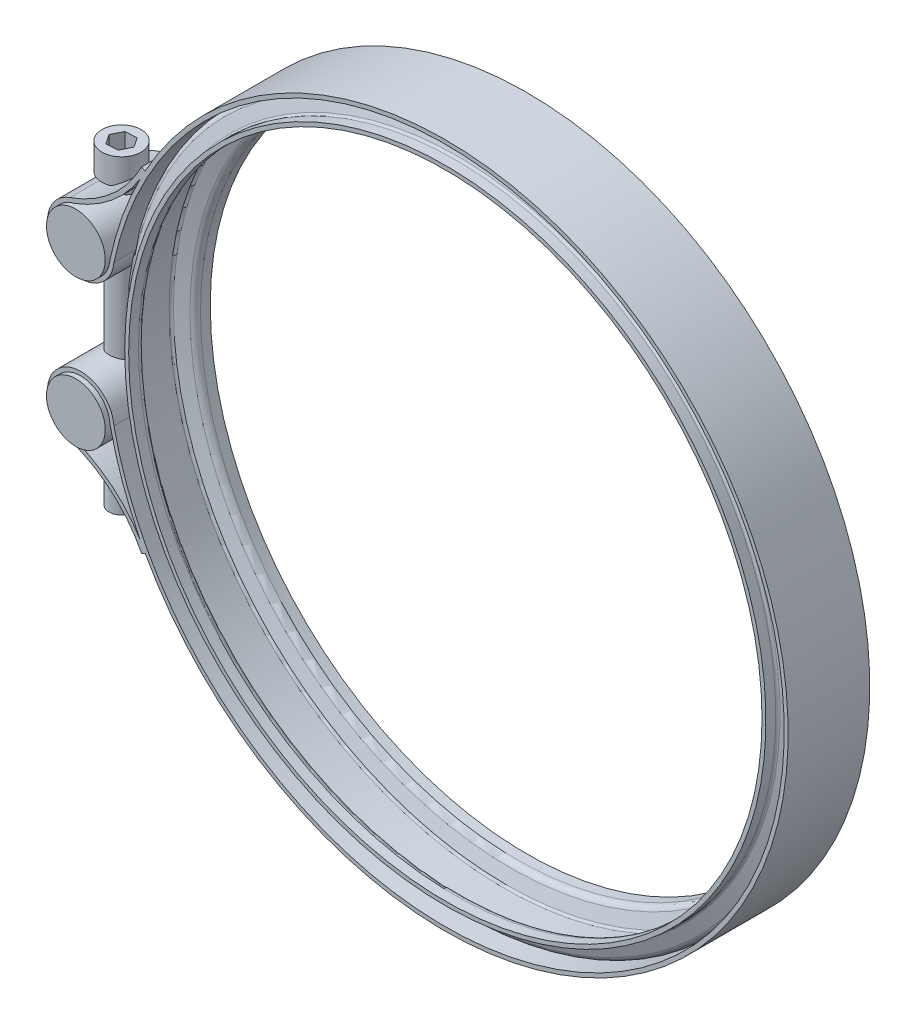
ISO-10303-21;
HEADER;
FILE_DESCRIPTION(('STEP AP214'),'2;1');
FILE_NAME('part.step','',(''),(''),'','','');
FILE_SCHEMA(('AUTOMOTIVE_DESIGN { 1 0 10303 214 1 1 1 1 }'));
ENDSEC;
DATA;
#1=APPLICATION_CONTEXT('core data for automotive mechanical design processes');
#2=APPLICATION_PROTOCOL_DEFINITION('international standard','automotive_design',2000,#1);
#3=PRODUCT_CONTEXT('',#1,'mechanical');
#4=PRODUCT('Part','Part','',(#3));
#5=PRODUCT_RELATED_PRODUCT_CATEGORY('part','',(#4));
#6=PRODUCT_DEFINITION_FORMATION('','',#4);
#7=PRODUCT_DEFINITION_CONTEXT('part definition',#1,'design');
#8=PRODUCT_DEFINITION('design','',#6,#7);
#9=PRODUCT_DEFINITION_SHAPE('','',#8);
#10=(LENGTH_UNIT() NAMED_UNIT(*) SI_UNIT(.MILLI.,.METRE.));
#11=(NAMED_UNIT(*) PLANE_ANGLE_UNIT() SI_UNIT($,.RADIAN.));
#12=(NAMED_UNIT(*) SI_UNIT($,.STERADIAN.) SOLID_ANGLE_UNIT());
#13=UNCERTAINTY_MEASURE_WITH_UNIT(LENGTH_MEASURE(1.E-05),#10,'distance_accuracy_value','');
#14=(GEOMETRIC_REPRESENTATION_CONTEXT(3) GLOBAL_UNCERTAINTY_ASSIGNED_CONTEXT((#13)) GLOBAL_UNIT_ASSIGNED_CONTEXT((#10,
#11,#12)) REPRESENTATION_CONTEXT('',''));
#15=CARTESIAN_POINT('',(0.,0.,0.));
#16=DIRECTION('',(0.,0.,1.));
#17=DIRECTION('',(1.,0.,0.));
#18=AXIS2_PLACEMENT_3D('',#15,#16,#17);
#19=CARTESIAN_POINT('',(-81.0389872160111,43.7091314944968,7.93749999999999));
#20=DIRECTION('',(0.,0.,-1.));
#21=DIRECTION('',(-1.,0.,0.));
#22=AXIS2_PLACEMENT_3D('',#19,#20,#21);
#23=CYLINDRICAL_SURFACE('',#22,24.638);
#24=CARTESIAN_POINT('',(-69.4422340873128,21.971,-3.51416348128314));
#25=CARTESIAN_POINT('',(-69.337018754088,22.0271253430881,-3.47008209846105));
#26=CARTESIAN_POINT('',(-69.2337946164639,22.0831795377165,-3.42129837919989));
#27=CARTESIAN_POINT('',(-69.0318321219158,22.1946584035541,-3.31447931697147));
#28=CARTESIAN_POINT('',(-68.9330955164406,22.2500828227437,-3.25644040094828));
#29=CARTESIAN_POINT('',(-68.6431267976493,22.4153934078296,-3.06783884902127));
#30=CARTESIAN_POINT('',(-68.4596463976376,22.5235050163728,-2.92342159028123));
#31=CARTESIAN_POINT('',(-68.1186434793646,22.7297219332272,-2.59928015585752));
#32=CARTESIAN_POINT('',(-67.9611996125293,22.827796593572,-2.41945247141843));
#33=CARTESIAN_POINT('',(-67.7504305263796,22.9617875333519,-2.1262571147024));
#34=CARTESIAN_POINT('',(-67.6844717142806,23.0042207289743,-2.02475381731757));
#35=CARTESIAN_POINT('',(-67.5617895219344,23.083867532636,-1.81441418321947));
#36=CARTESIAN_POINT('',(-67.5050625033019,23.1210831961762,-1.70558075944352));
#37=CARTESIAN_POINT('',(-67.3777489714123,23.2052323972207,-1.42903117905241));
#38=CARTESIAN_POINT('',(-67.3129872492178,23.2486354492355,-1.25747103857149));
#39=CARTESIAN_POINT('',(-67.2083762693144,23.3192007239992,-0.903757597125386));
#40=CARTESIAN_POINT('',(-67.1685156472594,23.346370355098,-0.721609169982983));
#41=CARTESIAN_POINT('',(-67.1157943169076,23.3823805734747,-0.35094576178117));
#42=CARTESIAN_POINT('',(-67.1030275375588,23.3911573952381,-0.162410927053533));
#43=CARTESIAN_POINT('',(-67.1055980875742,23.3893943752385,0.214367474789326));
#44=CARTESIAN_POINT('',(-67.1209336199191,23.3788557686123,0.402611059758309));
#45=CARTESIAN_POINT('',(-67.1770463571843,23.3405608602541,0.762101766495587));
#46=CARTESIAN_POINT('',(-67.2163033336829,23.3138339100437,0.933702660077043));
#47=CARTESIAN_POINT('',(-67.3169260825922,23.2460003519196,1.26724682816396));
#48=CARTESIAN_POINT('',(-67.3782956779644,23.2048912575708,1.42918842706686));
#49=CARTESIAN_POINT('',(-67.5253619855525,23.107645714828,1.75071751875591));
#50=CARTESIAN_POINT('',(-67.6123997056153,23.0506949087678,1.90944020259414));
#51=CARTESIAN_POINT('',(-67.805683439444,22.9263522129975,2.21022194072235));
#52=CARTESIAN_POINT('',(-67.9119422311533,22.8589533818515,2.3522698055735));
#53=CARTESIAN_POINT('',(-68.1583790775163,22.7056768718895,2.63863179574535));
#54=CARTESIAN_POINT('',(-68.3012600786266,22.6185508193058,2.77994568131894));
#55=CARTESIAN_POINT('',(-68.604939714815,22.4381029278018,3.03691496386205));
#56=CARTESIAN_POINT('',(-68.7657348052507,22.3447823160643,3.15257542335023));
#57=CARTESIAN_POINT('',(-69.0153685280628,22.2039582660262,3.30448125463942));
#58=CARTESIAN_POINT('',(-69.0987344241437,22.1575473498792,3.35099870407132));
#59=CARTESIAN_POINT('',(-69.2683562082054,22.0644407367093,3.43747696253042));
#60=CARTESIAN_POINT('',(-69.3546051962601,22.0177459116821,3.47745224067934));
#61=CARTESIAN_POINT('',(-69.4422340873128,21.971,3.51416348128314));
#62=B_SPLINE_CURVE_WITH_KNOTS('',3,(#24,#25,#26,#27,#28,#29,#30,#31,#32,#33,#34,#35,#36,#37,#38,
#39,#40,#41,#42,#43,#44,#45,#46,#47,#48,#49,#50,#51,#52,#53,#54,#55,#56,#57,#58,#59,#60,#61),
.UNSPECIFIED.,.F.,.F.,(4,2,2,2,2,2,2,2,2,2,2,2,2,2,2,2,2,2,4),(0.,0.381202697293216,
0.762552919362,1.53066861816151,2.30106386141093,2.68532915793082,3.06944264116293,
3.63220499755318,4.19471033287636,4.75916259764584,5.32357876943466,5.85540349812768,
6.38732021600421,6.95443344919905,7.5219250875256,8.17654238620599,8.83103038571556,
9.14927334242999,9.46680265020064),.UNSPECIFIED.);
#63=CARTESIAN_POINT('',(-69.4422340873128,21.971,-3.51416348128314));
#64=VERTEX_POINT('',#63);
#65=CARTESIAN_POINT('',(-69.4422340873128,21.971,3.51416348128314));
#66=VERTEX_POINT('',#65);
#67=EDGE_CURVE('E54',#64,#66,#62,.T.);
#68=ORIENTED_EDGE('',*,*,#67,.T.);
#69=DIRECTION('',(0.,0.,-1.));
#70=VECTOR('',#69,1.);
#71=CARTESIAN_POINT('',(-69.4422340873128,21.971,7.93749999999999));
#72=LINE('',#71,#70);
#73=CARTESIAN_POINT('',(-69.4422340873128,21.971,1.91201829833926));
#74=VERTEX_POINT('',#73);
#75=EDGE_CURVE('E313',#66,#74,#72,.T.);
#76=ORIENTED_EDGE('',*,*,#75,.T.);
#77=CARTESIAN_POINT('',(-69.4422340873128,21.971,1.91201829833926));
#78=CARTESIAN_POINT('',(-69.5017116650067,21.9392686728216,1.95779996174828));
#79=CARTESIAN_POINT('',(-69.5630484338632,21.9068625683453,2.00060778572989));
#80=CARTESIAN_POINT('',(-69.689004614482,21.8410272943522,2.08013510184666));
#81=CARTESIAN_POINT('',(-69.7536231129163,21.8075984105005,2.11685627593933));
#82=CARTESIAN_POINT('',(-69.9516316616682,21.7063256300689,2.21762936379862));
#83=CARTESIAN_POINT('',(-70.0893275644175,21.637413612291,2.27240744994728));
#84=CARTESIAN_POINT('',(-70.3720913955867,21.4993780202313,2.35592985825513));
#85=CARTESIAN_POINT('',(-70.5171549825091,21.4302545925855,2.38468932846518));
#86=CARTESIAN_POINT('',(-70.810999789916,21.2938347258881,2.41530881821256));
#87=CARTESIAN_POINT('',(-70.9597812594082,21.2265384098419,2.41716703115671));
#88=CARTESIAN_POINT('',(-71.2580173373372,21.0951881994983,2.39310155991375));
#89=CARTESIAN_POINT('',(-71.4074677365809,21.031164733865,2.36695432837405));
#90=CARTESIAN_POINT('',(-71.7009583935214,20.9087472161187,2.28620946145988));
#91=CARTESIAN_POINT('',(-71.8449996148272,20.8503521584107,2.23161691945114));
#92=CARTESIAN_POINT('',(-72.1143412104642,20.7439066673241,2.09846955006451));
#93=CARTESIAN_POINT('',(-72.2402409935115,20.6954576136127,2.02144738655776));
#94=CARTESIAN_POINT('',(-72.4774134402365,20.6061764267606,1.84413991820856));
#95=CARTESIAN_POINT('',(-72.5887076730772,20.5653330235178,1.74388953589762));
#96=CARTESIAN_POINT('',(-72.7537939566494,20.5058727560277,1.56440924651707));
#97=CARTESIAN_POINT('',(-72.813504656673,20.4846625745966,1.49138167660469));
#98=CARTESIAN_POINT('',(-72.9243426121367,20.4457049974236,1.33826091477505));
#99=CARTESIAN_POINT('',(-72.9754714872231,20.4279569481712,1.25816906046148));
#100=CARTESIAN_POINT('',(-73.0218279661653,20.4120028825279,1.1749789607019));
#101=B_SPLINE_CURVE_WITH_KNOTS('',3,(#77,#78,#79,#80,#81,#82,#83,#84,#85,#86,#87,#88,#89,#90,
#91,#92,#93,#94,#95,#96,#97,#98,#99,#100),.UNSPECIFIED.,.F.,.F.,(4,2,2,2,2,2,2,2,2,2,2,4),(0.,
0.244293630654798,0.48851964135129,0.976352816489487,1.46390179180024,1.95148350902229,
2.44298644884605,2.93440141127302,3.3979777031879,3.86086150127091,4.15027240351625,
4.4396286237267),.UNSPECIFIED.);
#102=CARTESIAN_POINT('',(-73.0218279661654,20.4120028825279,1.17497896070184));
#103=VERTEX_POINT('',#102);
#104=EDGE_CURVE('E403',#74,#103,#101,.T.);
#105=ORIENTED_EDGE('',*,*,#104,.T.);
#106=DIRECTION('',(0.,0.,-1.));
#107=VECTOR('',#106,1.);
#108=CARTESIAN_POINT('',(-73.0218279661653,20.4120028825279,7.93749999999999));
#109=LINE('',#108,#107);
#110=CARTESIAN_POINT('',(-73.0218279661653,20.4120028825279,7.93749999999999));
#111=VERTEX_POINT('',#110);
#112=EDGE_CURVE('E536',#111,#103,#109,.T.);
#113=ORIENTED_EDGE('',*,*,#112,.F.);
#114=CARTESIAN_POINT('',(-81.0389872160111,43.7091314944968,7.93749999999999));
#115=DIRECTION('',(0.,0.,1.));
#116=DIRECTION('',(1.,0.,0.));
#117=AXIS2_PLACEMENT_3D('',#114,#115,#116);
#118=CIRCLE('',#117,24.638);
#119=CARTESIAN_POINT('',(-59.0794098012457,32.5373812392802,7.93749999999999));
#120=VERTEX_POINT('',#119);
#121=EDGE_CURVE('E530',#111,#120,#118,.T.);
#122=ORIENTED_EDGE('',*,*,#121,.T.);
#123=DIRECTION('',(0.,0.,-1.));
#124=VECTOR('',#123,1.);
#125=CARTESIAN_POINT('',(-59.0794098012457,32.5373812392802,7.93749999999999));
#126=LINE('',#125,#124);
#127=CARTESIAN_POINT('',(-59.0794098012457,32.5373812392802,-7.93749999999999));
#128=VERTEX_POINT('',#127);
#129=EDGE_CURVE('E539',#120,#128,#126,.T.);
#130=ORIENTED_EDGE('',*,*,#129,.T.);
#131=CARTESIAN_POINT('',(-81.0389872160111,43.7091314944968,-7.93749999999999));
#132=DIRECTION('',(0.,0.,1.));
#133=DIRECTION('',(1.,0.,0.));
#134=AXIS2_PLACEMENT_3D('',#131,#132,#133);
#135=CIRCLE('',#134,24.638);
#136=CARTESIAN_POINT('',(-73.0218279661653,20.4120028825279,-7.93749999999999));
#137=VERTEX_POINT('',#136);
#138=EDGE_CURVE('E518',#137,#128,#135,.T.);
#139=ORIENTED_EDGE('',*,*,#138,.F.);
#140=CARTESIAN_POINT('',(-73.0218279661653,20.4120028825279,-1.1749789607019));
#141=VERTEX_POINT('',#140);
#142=EDGE_CURVE('E535',#141,#137,#109,.T.);
#143=ORIENTED_EDGE('',*,*,#142,.F.);
#144=CARTESIAN_POINT('',(-73.0218279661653,20.4120028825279,-1.1749789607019));
#145=CARTESIAN_POINT('',(-72.9886258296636,20.4234289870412,-1.23455253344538));
#146=CARTESIAN_POINT('',(-72.9529637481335,20.4357802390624,-1.29256585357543));
#147=CARTESIAN_POINT('',(-72.8771034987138,20.462275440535,-1.4050855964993));
#148=CARTESIAN_POINT('',(-72.8369068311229,20.476418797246,-1.45959316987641));
#149=CARTESIAN_POINT('',(-72.7524730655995,20.5064005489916,-1.56458787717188));
#150=CARTESIAN_POINT('',(-72.7082492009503,20.5222334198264,-1.6150872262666));
#151=CARTESIAN_POINT('',(-72.6160727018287,20.5555580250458,-1.71194524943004));
#152=CARTESIAN_POINT('',(-72.5681198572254,20.5730498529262,-1.75830368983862));
#153=CARTESIAN_POINT('',(-72.4193722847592,20.6278752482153,-1.89067815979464));
#154=CARTESIAN_POINT('',(-72.313537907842,20.6676116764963,-1.97017906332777));
#155=CARTESIAN_POINT('',(-72.0920326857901,20.752713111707,-2.11010496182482));
#156=CARTESIAN_POINT('',(-71.976356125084,20.7980813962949,-2.17051877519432));
#157=CARTESIAN_POINT('',(-71.7329484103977,20.8958316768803,-2.27388126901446));
#158=CARTESIAN_POINT('',(-71.6049065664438,20.9484423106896,-2.31588223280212));
#159=CARTESIAN_POINT('',(-71.3453291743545,21.0577761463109,-2.3779295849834));
#160=CARTESIAN_POINT('',(-71.213792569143,21.1145006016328,-2.39796925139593));
#161=CARTESIAN_POINT('',(-70.9407754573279,21.2351240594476,-2.41700894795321));
#162=CARTESIAN_POINT('',(-70.7992758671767,21.2992438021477,-2.41435124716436));
#163=CARTESIAN_POINT('',(-70.5196457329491,21.4291332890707,-2.38467556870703));
#164=CARTESIAN_POINT('',(-70.3815163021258,21.4949035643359,-2.35764965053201));
#165=CARTESIAN_POINT('',(-70.1023505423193,21.6309357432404,-2.27726881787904));
#166=CARTESIAN_POINT('',(-69.9617936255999,21.7011880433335,-2.22219501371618));
#167=CARTESIAN_POINT('',(-69.7597536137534,21.8044352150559,-2.12025571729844));
#168=CARTESIAN_POINT('',(-69.6938238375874,21.8385220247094,-2.08301713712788));
#169=CARTESIAN_POINT('',(-69.5653645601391,21.9056390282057,-2.00222197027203));
#170=CARTESIAN_POINT('',(-69.5028358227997,21.9386689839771,-1.9586639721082));
#171=CARTESIAN_POINT('',(-69.4422340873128,21.971,-1.91201829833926));
#172=B_SPLINE_CURVE_WITH_KNOTS('',3,(#144,#145,#146,#147,#148,#149,#150,#151,#152,#153,#154,
#155,#156,#157,#158,#159,#160,#161,#162,#163,#164,#165,#166,#167,#168,#169,#170,#171),
.UNSPECIFIED.,.F.,.F.,(4,2,2,2,2,2,2,2,2,2,2,2,2,4),(0.,0.207372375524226,0.414676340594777,
0.621322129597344,0.827979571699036,1.24056885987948,1.65339940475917,2.08551519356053,
2.51776320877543,2.9818365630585,3.44606119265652,3.9429522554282,4.19179451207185,
4.44069243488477),.UNSPECIFIED.);
#173=CARTESIAN_POINT('',(-69.4422340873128,21.971,-1.91201829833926));
#174=VERTEX_POINT('',#173);
#175=EDGE_CURVE('E408',#141,#174,#172,.T.);
#176=ORIENTED_EDGE('',*,*,#175,.T.);
#177=EDGE_CURVE('E59',#174,#64,#72,.T.);
#178=ORIENTED_EDGE('',*,*,#177,.T.);
#179=EDGE_LOOP('',(#68,#76,#105,#113,#122,#130,#139,#143,#176,#178));
#180=FACE_BOUND('',#179,.T.);
#181=ADVANCED_FACE('F34',(#180),#23,.F.);
#182=CARTESIAN_POINT('',(-81.0389872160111,43.7091314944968,7.93749999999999));
#183=DIRECTION('',(0.,0.,-1.));
#184=DIRECTION('',(-1.,0.,0.));
#185=AXIS2_PLACEMENT_3D('',#182,#183,#184);
#186=CYLINDRICAL_SURFACE('',#185,25.4508);
#187=CARTESIAN_POINT('',(-72.1102210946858,19.8759538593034,-2.0957482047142));
#188=CARTESIAN_POINT('',(-72.0471136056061,19.8995946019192,-2.1317619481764));
#189=CARTESIAN_POINT('',(-71.982647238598,19.9240338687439,-2.164771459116));
#190=CARTESIAN_POINT('',(-71.8515226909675,19.9743755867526,-2.22468836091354));
#191=CARTESIAN_POINT('',(-71.7848654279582,20.000277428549,-2.25159827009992));
#192=CARTESIAN_POINT('',(-71.5828068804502,20.0798130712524,-2.32290573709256));
#193=CARTESIAN_POINT('',(-71.444852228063,20.1354508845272,-2.35814414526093));
#194=CARTESIAN_POINT('',(-71.1667968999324,20.2505352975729,-2.40387986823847));
#195=CARTESIAN_POINT('',(-71.0266991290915,20.30997703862,-2.41440812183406));
#196=CARTESIAN_POINT('',(-70.7477421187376,20.4313170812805,-2.41128967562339));
#197=CARTESIAN_POINT('',(-70.6088838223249,20.4932170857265,-2.39762592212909));
#198=CARTESIAN_POINT('',(-70.3289490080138,20.6209709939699,-2.34548803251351));
#199=CARTESIAN_POINT('',(-70.1881188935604,20.686865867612,-2.30578732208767));
#200=CARTESIAN_POINT('',(-69.9153620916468,20.8174066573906,-2.20140283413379));
#201=CARTESIAN_POINT('',(-69.783437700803,20.8820522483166,-2.13671264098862));
#202=CARTESIAN_POINT('',(-69.530329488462,21.0085954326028,-1.9823477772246));
#203=CARTESIAN_POINT('',(-69.4093353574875,21.0704376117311,-1.89231462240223));
#204=CARTESIAN_POINT('',(-69.184496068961,21.1873569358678,-1.68923929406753));
#205=CARTESIAN_POINT('',(-69.0806460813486,21.2424359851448,-1.57620362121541));
#206=CARTESIAN_POINT('',(-68.9008835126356,21.3390756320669,-1.33783110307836));
#207=CARTESIAN_POINT('',(-68.8235632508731,21.3812956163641,-1.21382988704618));
#208=CARTESIAN_POINT('',(-68.6917330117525,21.4539243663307,-0.951116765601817));
#209=CARTESIAN_POINT('',(-68.6371954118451,21.4843474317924,-0.812422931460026));
#210=CARTESIAN_POINT('',(-68.5595918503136,21.5278411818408,-0.543433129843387));
#211=CARTESIAN_POINT('',(-68.5334055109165,21.5426266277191,-0.414312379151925));
#212=CARTESIAN_POINT('',(-68.5024737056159,21.5601046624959,-0.152746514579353));
#213=CARTESIAN_POINT('',(-68.497713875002,21.5628053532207,-0.0203036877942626));
#214=CARTESIAN_POINT('',(-68.5093148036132,21.5562413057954,0.230860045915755));
#215=CARTESIAN_POINT('',(-68.5237420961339,21.5480718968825,0.349705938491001));
#216=CARTESIAN_POINT('',(-68.5696845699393,21.5221893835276,0.582948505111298));
#217=CARTESIAN_POINT('',(-68.6011996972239,21.5044763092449,0.69734519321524));
#218=CARTESIAN_POINT('',(-68.6802563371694,21.4603778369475,0.91979326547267));
#219=CARTESIAN_POINT('',(-68.7279347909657,21.433918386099,1.0277808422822));
#220=CARTESIAN_POINT('',(-68.8374099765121,21.3737643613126,1.23412601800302));
#221=CARTESIAN_POINT('',(-68.8992111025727,21.3400675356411,1.33248060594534));
#222=CARTESIAN_POINT('',(-69.041329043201,21.2634970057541,1.52663804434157));
#223=CARTESIAN_POINT('',(-69.122835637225,21.2200603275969,1.62134593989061));
#224=CARTESIAN_POINT('',(-69.2979389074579,21.1281485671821,1.79596795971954));
#225=CARTESIAN_POINT('',(-69.3915414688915,21.079671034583,1.87587483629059));
#226=CARTESIAN_POINT('',(-69.6003618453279,20.9733368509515,2.02854560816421));
#227=CARTESIAN_POINT('',(-69.7168258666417,20.915052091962,2.09930978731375));
#228=CARTESIAN_POINT('',(-69.9590610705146,20.7963256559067,2.22003677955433));
#229=CARTESIAN_POINT('',(-70.0848356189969,20.7358832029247,2.26999202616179));
#230=CARTESIAN_POINT('',(-70.3536389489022,20.6095562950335,2.35152012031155));
#231=CARTESIAN_POINT('',(-70.4972304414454,20.5436401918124,2.38120206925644));
#232=CARTESIAN_POINT('',(-70.7882563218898,20.4133987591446,2.41415699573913));
#233=CARTESIAN_POINT('',(-70.9356932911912,20.3490745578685,2.41741175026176));
#234=CARTESIAN_POINT('',(-71.2319073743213,20.2231650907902,2.39665671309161));
#235=CARTESIAN_POINT('',(-71.3806796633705,20.1616213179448,2.37232335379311));
#236=CARTESIAN_POINT('',(-71.6727946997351,20.0439179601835,2.29560853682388));
#237=CARTESIAN_POINT('',(-71.8161510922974,19.9877442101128,2.24330341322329));
#238=CARTESIAN_POINT('',(-71.9805010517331,19.924937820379,2.16483008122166));
#239=CARTESIAN_POINT('',(-72.0067586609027,19.9149546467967,2.1516982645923));
#240=CARTESIAN_POINT('',(-72.0588242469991,19.8952561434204,2.12445720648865));
#241=CARTESIAN_POINT('',(-72.0846326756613,19.8855405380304,2.11034902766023));
#242=CARTESIAN_POINT('',(-72.1102210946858,19.8759538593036,2.0957482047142));
#243=B_SPLINE_CURVE_WITH_KNOTS('',3,(#187,#188,#189,#190,#191,#192,#193,#194,#195,#196,#197,
#198,#199,#200,#201,#202,#203,#204,#205,#206,#207,#208,#209,#210,#211,#212,#213,#214,#215,#216,
#217,#218,#219,#220,#221,#222,#223,#224,#225,#226,#227,#228,#229,#230,#231,#232,#233,#234,#235,
#236,#237,#238,#239,#240,#241,#242),.UNSPECIFIED.,.F.,.F.,(4,2,2,2,2,2,2,2,2,2,2,2,2,2,2,2,2,2,
2,2,2,2,2,2,2,2,2,4),(0.,0.229067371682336,0.458039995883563,0.914318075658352,1.37002455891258,
1.82605241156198,2.30527506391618,2.78462083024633,3.27112085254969,3.75748357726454,
4.21118857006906,4.66434186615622,5.05986449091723,5.45512191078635,5.81341683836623,
6.17171063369,6.53311919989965,6.89464037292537,7.28990378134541,7.68536023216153,
8.12814963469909,8.5710999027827,9.05116353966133,9.5315581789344,10.0176459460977,
10.5024139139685,10.5954321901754,10.6883507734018),.UNSPECIFIED.);
#244=CARTESIAN_POINT('',(-72.1102210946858,19.8759538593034,-2.0957482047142));
#245=VERTEX_POINT('',#244);
#246=CARTESIAN_POINT('',(-72.1102210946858,19.8759538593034,2.0957482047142));
#247=VERTEX_POINT('',#246);
#248=EDGE_CURVE('E413',#245,#247,#243,.T.);
#249=ORIENTED_EDGE('',*,*,#248,.F.);
#250=DIRECTION('',(0.,0.,-1.));
#251=VECTOR('',#250,1.);
#252=CARTESIAN_POINT('',(-72.1102210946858,19.8759538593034,0.));
#253=LINE('',#252,#251);
#254=CARTESIAN_POINT('',(-72.1102210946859,19.8759538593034,-7.93749999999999));
#255=VERTEX_POINT('',#254);
#256=EDGE_CURVE('E659',#245,#255,#253,.T.);
#257=ORIENTED_EDGE('',*,*,#256,.T.);
#258=CARTESIAN_POINT('',(-81.0389872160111,43.7091314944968,-7.93749999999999));
#259=DIRECTION('',(0.,0.,1.));
#260=DIRECTION('',(1.,0.,0.));
#261=AXIS2_PLACEMENT_3D('',#258,#259,#260);
#262=CIRCLE('',#261,25.4508);
#263=CARTESIAN_POINT('',(-59.3202887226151,30.441073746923,-7.93749999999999));
#264=VERTEX_POINT('',#263);
#265=EDGE_CURVE('E512',#255,#264,#262,.T.);
#266=ORIENTED_EDGE('',*,*,#265,.T.);
#267=DIRECTION('',(0.,0.,-1.));
#268=VECTOR('',#267,1.);
#269=CARTESIAN_POINT('',(-59.3202887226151,30.4410737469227,0.));
#270=LINE('',#269,#268);
#271=CARTESIAN_POINT('',(-59.3202887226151,30.441073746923,7.93749999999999));
#272=VERTEX_POINT('',#271);
#273=EDGE_CURVE('E541',#264,#272,#270,.F.);
#274=ORIENTED_EDGE('',*,*,#273,.T.);
#275=CARTESIAN_POINT('',(-81.0389872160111,43.7091314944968,7.93749999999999));
#276=DIRECTION('',(0.,0.,1.));
#277=DIRECTION('',(1.,0.,0.));
#278=AXIS2_PLACEMENT_3D('',#275,#276,#277);
#279=CIRCLE('',#278,25.4508);
#280=CARTESIAN_POINT('',(-72.1102210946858,19.8759538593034,7.93749999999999));
#281=VERTEX_POINT('',#280);
#282=EDGE_CURVE('E524',#281,#272,#279,.T.);
#283=ORIENTED_EDGE('',*,*,#282,.F.);
#284=EDGE_CURVE('E660',#281,#247,#253,.T.);
#285=ORIENTED_EDGE('',*,*,#284,.T.);
#286=EDGE_LOOP('',(#249,#257,#266,#274,#283,#285));
#287=FACE_BOUND('',#286,.T.);
#288=DIRECTION('',(0.,0.,-1.));
#289=VECTOR('',#288,1.);
#290=CARTESIAN_POINT('',(-67.8027921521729,21.971,7.93749999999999));
#291=LINE('',#290,#289);
#292=CARTESIAN_POINT('',(-67.8027921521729,21.971,2.19888388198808));
#293=VERTEX_POINT('',#292);
#294=CARTESIAN_POINT('',(-67.8027921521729,21.971,-2.19888388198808));
#295=VERTEX_POINT('',#294);
#296=EDGE_CURVE('E312',#293,#295,#291,.T.);
#297=ORIENTED_EDGE('',*,*,#296,.F.);
#298=CARTESIAN_POINT('',(-67.8027921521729,21.971,-2.19888388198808));
#299=CARTESIAN_POINT('',(-67.7489364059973,22.003791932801,-2.12268760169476));
#300=CARTESIAN_POINT('',(-67.6976174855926,22.035314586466,-2.04412178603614));
#301=CARTESIAN_POINT('',(-67.6004558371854,22.0954238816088,-1.88253075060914));
#302=CARTESIAN_POINT('',(-67.5546166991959,22.1240085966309,-1.79950265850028));
#303=CARTESIAN_POINT('',(-67.4687142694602,22.1779100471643,-1.62902117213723));
#304=CARTESIAN_POINT('',(-67.4286752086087,22.2032130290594,-1.54155116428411));
#305=CARTESIAN_POINT('',(-67.3550449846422,22.2499877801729,-1.36296311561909));
#306=CARTESIAN_POINT('',(-67.321452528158,22.2714603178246,-1.2718458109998));
#307=CARTESIAN_POINT('',(-67.2609913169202,22.3102682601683,-1.08608057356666));
#308=CARTESIAN_POINT('',(-67.2341527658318,22.3275850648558,-0.991418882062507));
#309=CARTESIAN_POINT('',(-67.1877703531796,22.3576028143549,-0.799609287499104));
#310=CARTESIAN_POINT('',(-67.1682259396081,22.3703041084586,-0.702461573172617));
#311=CARTESIAN_POINT('',(-67.136764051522,22.3907881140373,-0.50665887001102));
#312=CARTESIAN_POINT('',(-67.1248288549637,22.3985822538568,-0.408007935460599));
#313=CARTESIAN_POINT('',(-67.1087068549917,22.4091173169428,-0.209810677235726));
#314=CARTESIAN_POINT('',(-67.1045193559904,22.4118586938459,-0.110264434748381));
#315=CARTESIAN_POINT('',(-67.1039804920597,22.412211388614,0.08129042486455));
#316=CARTESIAN_POINT('',(-67.1070582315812,22.4101964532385,0.173297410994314));
#317=CARTESIAN_POINT('',(-67.1198429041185,22.4018393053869,0.356681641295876));
#318=CARTESIAN_POINT('',(-67.1295520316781,22.3954956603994,0.448058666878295));
#319=CARTESIAN_POINT('',(-67.1554779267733,22.3785986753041,0.629548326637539));
#320=CARTESIAN_POINT('',(-67.1716986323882,22.3680427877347,0.719660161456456));
#321=CARTESIAN_POINT('',(-67.2104293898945,22.3429260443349,0.897965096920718));
#322=CARTESIAN_POINT('',(-67.2329417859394,22.3283636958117,0.986157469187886));
#323=CARTESIAN_POINT('',(-67.3090507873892,22.2793455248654,1.24538917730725));
#324=CARTESIAN_POINT('',(-67.3714850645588,22.2393823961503,1.41289133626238));
#325=CARTESIAN_POINT('',(-67.5173276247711,22.1472368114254,1.73446546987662));
#326=CARTESIAN_POINT('',(-67.6007096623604,22.0950696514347,1.88855392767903));
#327=CARTESIAN_POINT('',(-67.7284092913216,22.0164261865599,2.09070775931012));
#328=CARTESIAN_POINT('',(-67.7649816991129,21.9940219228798,2.14539066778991));
#329=CARTESIAN_POINT('',(-67.8027921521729,21.971,2.19888388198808));
#330=B_SPLINE_CURVE_WITH_KNOTS('',3,(#298,#299,#300,#301,#302,#303,#304,#305,#306,#307,#308,
#309,#310,#311,#312,#313,#314,#315,#316,#317,#318,#319,#320,#321,#322,#323,#324,#325,#326,#327,
#328,#329),.UNSPECIFIED.,.F.,.F.,(4,2,2,2,2,2,2,2,2,2,2,2,2,2,2,4),(0.,0.296672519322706,
0.593538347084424,0.891610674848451,1.18962313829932,1.48894554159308,1.78824528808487,
2.08684538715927,2.38541867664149,2.66131962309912,2.93731191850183,3.21347138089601,
3.48973387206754,4.03681720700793,4.58321849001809,4.79159051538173),.UNSPECIFIED.);
#331=EDGE_CURVE('E11',#295,#293,#330,.T.);
#332=ORIENTED_EDGE('',*,*,#331,.F.);
#333=EDGE_LOOP('',(#297,#332));
#334=FACE_BOUND('',#333,.T.);
#335=ADVANCED_FACE('F423',(#287,#334),#186,.T.);
#336=CARTESIAN_POINT('',(-70.9142242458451,14.2875,8.89000000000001));
#337=DIRECTION('',(0.,0.,-1.));
#338=DIRECTION('',(-1.,0.,0.));
#339=AXIS2_PLACEMENT_3D('',#336,#337,#338);
#340=CYLINDRICAL_SURFACE('',#339,5.71499999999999);
#341=CARTESIAN_POINT('',(-70.9142242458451,14.2875,8.89000000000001));
#342=DIRECTION('',(0.,0.,1.));
#343=DIRECTION('',(1.,0.,0.));
#344=AXIS2_PLACEMENT_3D('',#341,#342,#343);
#345=CIRCLE('',#344,5.71499999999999);
#346=CARTESIAN_POINT('',(-65.1992242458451,14.2875,8.89000000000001));
#347=VERTEX_POINT('',#346);
#348=EDGE_CURVE('E570',#347,#347,#345,.T.);
#349=ORIENTED_EDGE('',*,*,#348,.F.);
#350=EDGE_LOOP('',(#349));
#351=FACE_BOUND('',#350,.T.);
#352=CARTESIAN_POINT('',(-70.9142242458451,14.2875,-8.89000000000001));
#353=DIRECTION('',(0.,0.,1.));
#354=DIRECTION('',(1.,0.,0.));
#355=AXIS2_PLACEMENT_3D('',#352,#353,#354);
#356=CIRCLE('',#355,5.71499999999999);
#357=CARTESIAN_POINT('',(-65.1992242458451,14.2875,-8.89000000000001));
#358=VERTEX_POINT('',#357);
#359=EDGE_CURVE('E567',#358,#358,#356,.T.);
#360=ORIENTED_EDGE('',*,*,#359,.T.);
#361=EDGE_LOOP('',(#360));
#362=FACE_BOUND('',#361,.T.);
#363=CARTESIAN_POINT('',(-70.9142242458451,20.0025000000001,-2.413));
#364=CARTESIAN_POINT('',(-71.0433188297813,20.0024961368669,-2.41299514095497));
#365=CARTESIAN_POINT('',(-71.1726325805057,19.998076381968,-2.40257936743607));
#366=CARTESIAN_POINT('',(-71.4275758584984,19.9808390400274,-2.3613122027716));
#367=CARTESIAN_POINT('',(-71.5531950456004,19.9679998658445,-2.33040827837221));
#368=CARTESIAN_POINT('',(-71.7966570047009,19.9352935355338,-2.24950519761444));
#369=CARTESIAN_POINT('',(-71.9145248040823,19.9154504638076,-2.19957143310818));
#370=CARTESIAN_POINT('',(-72.1400931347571,19.8706631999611,-2.08230264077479));
#371=CARTESIAN_POINT('',(-72.2477965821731,19.845720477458,-2.01497262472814));
#372=CARTESIAN_POINT('',(-72.4556760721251,19.7917910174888,-1.86117843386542));
#373=CARTESIAN_POINT('',(-72.5552629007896,19.7626695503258,-1.77396549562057));
#374=CARTESIAN_POINT('',(-72.7389058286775,19.7042395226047,-1.58446557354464));
#375=CARTESIAN_POINT('',(-72.8229535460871,19.6749308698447,-1.48217050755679));
#376=CARTESIAN_POINT('',(-72.9773588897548,19.6177747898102,-1.25910967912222));
#377=CARTESIAN_POINT('',(-73.0468033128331,19.5900773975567,-1.13766928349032));
#378=CARTESIAN_POINT('',(-73.1640161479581,19.5414241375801,-0.883493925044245));
#379=CARTESIAN_POINT('',(-73.2117960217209,19.5204647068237,-0.750764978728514));
#380=CARTESIAN_POINT('',(-73.2818736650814,19.4891226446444,-0.484563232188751));
#381=CARTESIAN_POINT('',(-73.3053071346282,19.4782713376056,-0.351446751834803));
#382=CARTESIAN_POINT('',(-73.3295680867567,19.4670305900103,-0.08276301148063));
#383=CARTESIAN_POINT('',(-73.3304085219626,19.4666351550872,0.0528027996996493));
#384=CARTESIAN_POINT('',(-73.3103132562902,19.4759552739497,0.311081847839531));
#385=CARTESIAN_POINT('',(-73.2910952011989,19.4848733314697,0.43396335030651));
#386=CARTESIAN_POINT('',(-73.2343154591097,19.5104647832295,0.674559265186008));
#387=CARTESIAN_POINT('',(-73.1967501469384,19.5271397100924,0.792272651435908));
#388=CARTESIAN_POINT('',(-73.1036057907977,19.5667454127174,1.02220444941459));
#389=CARTESIAN_POINT('',(-73.0476561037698,19.5898032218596,1.1342498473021));
#390=CARTESIAN_POINT('',(-72.9195940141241,19.6395489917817,1.3478051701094));
#391=CARTESIAN_POINT('',(-72.8474751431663,19.6662384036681,1.44931085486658));
#392=CARTESIAN_POINT('',(-72.6817589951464,19.7230639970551,1.64820059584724));
#393=CARTESIAN_POINT('',(-72.5868389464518,19.7532980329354,1.74445772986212));
#394=CARTESIAN_POINT('',(-72.3819122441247,19.8118520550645,1.92007156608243));
#395=CARTESIAN_POINT('',(-72.271901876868,19.8401715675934,1.99942409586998));
#396=CARTESIAN_POINT('',(-72.0364143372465,19.8925684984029,2.14068970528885));
#397=CARTESIAN_POINT('',(-71.9106265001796,19.9165262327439,2.20213260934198));
#398=CARTESIAN_POINT('',(-71.6492295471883,19.9565766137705,2.30258757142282));
#399=CARTESIAN_POINT('',(-71.5136260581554,19.9726737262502,2.3416123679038));
#400=CARTESIAN_POINT('',(-71.2458545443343,19.9943479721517,2.3937374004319));
#401=CARTESIAN_POINT('',(-71.1140303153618,20.0005374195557,2.4083492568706));
#402=CARTESIAN_POINT('',(-70.8496783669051,20.0036622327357,2.41575487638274));
#403=CARTESIAN_POINT('',(-70.7171508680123,20.0006003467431,2.40855511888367));
#404=CARTESIAN_POINT('',(-70.4623112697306,19.9859621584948,2.37361351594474));
#405=CARTESIAN_POINT('',(-70.3398237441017,19.9748303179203,2.3469434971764));
#406=CARTESIAN_POINT('',(-70.101202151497,19.945651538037,2.27532159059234));
#407=CARTESIAN_POINT('',(-69.9850688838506,19.9276037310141,2.2303674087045));
#408=CARTESIAN_POINT('',(-69.7583632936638,19.8856176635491,2.1219880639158));
#409=CARTESIAN_POINT('',(-69.6480769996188,19.8615133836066,2.0580310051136));
#410=CARTESIAN_POINT('',(-69.4394058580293,19.8099728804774,1.91404444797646));
#411=CARTESIAN_POINT('',(-69.3410260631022,19.7825352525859,1.83400816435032));
#412=CARTESIAN_POINT('',(-69.1513772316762,19.7247907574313,1.65327784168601));
#413=CARTESIAN_POINT('',(-69.061157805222,19.6944209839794,1.55149969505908));
#414=CARTESIAN_POINT('',(-68.8987744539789,19.6360186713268,1.3337833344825));
#415=CARTESIAN_POINT('',(-68.8266150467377,19.6079867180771,1.21784158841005));
#416=CARTESIAN_POINT('',(-68.7015012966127,19.5571995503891,0.972460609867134));
#417=CARTESIAN_POINT('',(-68.6488710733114,19.5345354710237,0.842835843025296));
#418=CARTESIAN_POINT('',(-68.5666436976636,19.4982722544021,0.575303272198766));
#419=CARTESIAN_POINT('',(-68.5370268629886,19.4846653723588,0.437402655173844));
#420=CARTESIAN_POINT('',(-68.5036475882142,19.4692614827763,0.168911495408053));
#421=CARTESIAN_POINT('',(-68.4980359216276,19.4666202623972,0.0385983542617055));
#422=CARTESIAN_POINT('',(-68.5078623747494,19.471193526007,-0.22104181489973));
#423=CARTESIAN_POINT('',(-68.523297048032,19.478406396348,-0.350369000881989));
#424=CARTESIAN_POINT('',(-68.5732109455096,19.5010947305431,-0.597815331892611));
#425=CARTESIAN_POINT('',(-68.6067183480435,19.5161473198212,-0.71617304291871));
#426=CARTESIAN_POINT('',(-68.6908620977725,19.5524762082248,-0.945606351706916));
#427=CARTESIAN_POINT('',(-68.7415032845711,19.5737542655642,-1.05667988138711));
#428=CARTESIAN_POINT('',(-68.86203095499,19.621745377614,-1.2757932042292));
#429=CARTESIAN_POINT('',(-68.9329031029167,19.6487108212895,-1.38323446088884));
#430=CARTESIAN_POINT('',(-69.0905207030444,19.7043542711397,-1.58527748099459));
#431=CARTESIAN_POINT('',(-69.1772718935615,19.7330328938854,-1.67987458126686));
#432=CARTESIAN_POINT('',(-69.3719679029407,19.7914759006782,-1.86091051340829));
#433=CARTESIAN_POINT('',(-69.4810193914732,19.8211583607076,-1.94619124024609));
#434=CARTESIAN_POINT('',(-69.7129771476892,19.8760969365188,-2.09731452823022));
#435=CARTESIAN_POINT('',(-69.8358896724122,19.9013510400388,-2.16314826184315));
#436=CARTESIAN_POINT('',(-70.0903051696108,19.9442450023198,-2.27213206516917));
#437=CARTESIAN_POINT('',(-70.2216433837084,19.9619979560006,-2.31562136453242));
#438=CARTESIAN_POINT('',(-70.4904624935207,19.9883560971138,-2.3794884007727));
#439=CARTESIAN_POINT('',(-70.6279228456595,19.9969897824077,-2.39993815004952));
#440=CARTESIAN_POINT('',(-70.7906574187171,20.001218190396,-2.40996199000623));
#441=CARTESIAN_POINT('',(-70.8153525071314,20.0016981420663,-2.41110031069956));
#442=CARTESIAN_POINT('',(-70.8647704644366,20.002339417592,-2.41261978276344));
#443=CARTESIAN_POINT('',(-70.8894933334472,20.0025007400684,-2.41300093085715));
#444=CARTESIAN_POINT('',(-70.9142242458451,20.0025000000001,-2.413));
#445=B_SPLINE_CURVE_WITH_KNOTS('',3,(#363,#364,#365,#366,#367,#368,#369,#370,#371,#372,#373,
#374,#375,#376,#377,#378,#379,#380,#381,#382,#383,#384,#385,#386,#387,#388,#389,#390,#391,#392,
#393,#394,#395,#396,#397,#398,#399,#400,#401,#402,#403,#404,#405,#406,#407,#408,#409,#410,#411,
#412,#413,#414,#415,#416,#417,#418,#419,#420,#421,#422,#423,#424,#425,#426,#427,#428,#429,#430,
#431,#432,#433,#434,#435,#436,#437,#438,#439,#440,#441,#442,#443,#444),.UNSPECIFIED.,.T.,.F.,(4,
2,2,2,2,2,2,2,2,2,2,2,2,2,2,2,2,2,2,2,2,2,2,2,2,2,2,2,2,2,2,2,2,2,2,2,2,2,2,2,4),(0.,
0.387181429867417,0.775359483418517,1.16221550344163,1.54896019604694,1.95382726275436,
2.3589120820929,2.78459069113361,3.21004382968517,3.61461301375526,4.01895025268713,
4.39129672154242,4.76371679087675,5.14416007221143,5.52475581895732,5.93846416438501,
6.35227450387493,6.77613149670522,7.19974740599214,7.5960027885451,7.99214046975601,
8.36797359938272,8.74385389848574,9.13144634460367,9.51920269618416,9.93537812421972,
10.3516575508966,10.7745658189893,11.19711199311,11.5864451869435,11.9757146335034,
12.3458799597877,12.71614993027,13.1090102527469,13.502012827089,13.9247383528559,
14.3476554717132,14.7639466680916,15.1789330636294,15.2531058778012,15.327279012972),.UNSPECIFIED.);
#446=EDGE_CURVE('E418',#247,#245,#445,.T.);
#447=ORIENTED_EDGE('',*,*,#446,.F.);
#448=ORIENTED_EDGE('',*,*,#284,.F.);
#449=CARTESIAN_POINT('',(-70.9142242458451,14.2875,7.93749999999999));
#450=DIRECTION('',(0.,0.,1.));
#451=DIRECTION('',(1.,0.,0.));
#452=AXIS2_PLACEMENT_3D('',#449,#450,#451);
#453=CIRCLE('',#452,5.71499999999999);
#454=CARTESIAN_POINT('',(-65.2135193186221,13.8835342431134,7.93749999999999));
#455=VERTEX_POINT('',#454);
#456=EDGE_CURVE('E576',#455,#281,#453,.F.);
#457=ORIENTED_EDGE('',*,*,#456,.F.);
#458=DIRECTION('',(0.,0.,-1.));
#459=VECTOR('',#458,1.);
#460=CARTESIAN_POINT('',(-65.2135193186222,13.8835342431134,0.));
#461=LINE('',#460,#459);
#462=CARTESIAN_POINT('',(-65.2135193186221,13.8835342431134,-7.93749999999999));
#463=VERTEX_POINT('',#462);
#464=EDGE_CURVE('E653',#455,#463,#461,.T.);
#465=ORIENTED_EDGE('',*,*,#464,.T.);
#466=CARTESIAN_POINT('',(-70.9142242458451,14.2875,-7.93749999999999));
#467=DIRECTION('',(0.,0.,1.));
#468=DIRECTION('',(1.,0.,0.));
#469=AXIS2_PLACEMENT_3D('',#466,#467,#468);
#470=CIRCLE('',#469,5.71499999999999);
#471=EDGE_CURVE('E573',#463,#255,#470,.F.);
#472=ORIENTED_EDGE('',*,*,#471,.T.);
#473=ORIENTED_EDGE('',*,*,#256,.F.);
#474=EDGE_LOOP('',(#447,#448,#457,#465,#472,#473));
#475=FACE_BOUND('',#474,.T.);
#476=ADVANCED_FACE('F427',(#351,#362,#475),#340,.T.);
#477=CARTESIAN_POINT('',(-70.9142242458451,-14.2874999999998,8.89000000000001));
#478=DIRECTION('',(0.,0.,-1.));
#479=DIRECTION('',(-1.,0.,0.));
#480=AXIS2_PLACEMENT_3D('',#477,#478,#479);
#481=CYLINDRICAL_SURFACE('',#480,5.71499999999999);
#482=CARTESIAN_POINT('',(-70.9142242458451,-14.2874999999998,8.89000000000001));
#483=DIRECTION('',(0.,0.,1.));
#484=DIRECTION('',(-1.,0.,0.));
#485=AXIS2_PLACEMENT_3D('',#482,#483,#484);
#486=CIRCLE('',#485,5.71499999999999);
#487=CARTESIAN_POINT('',(-76.6292242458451,-14.2874999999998,8.89000000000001));
#488=VERTEX_POINT('',#487);
#489=EDGE_CURVE('E558',#488,#488,#486,.T.);
#490=ORIENTED_EDGE('',*,*,#489,.F.);
#491=EDGE_LOOP('',(#490));
#492=FACE_BOUND('',#491,.T.);
#493=CARTESIAN_POINT('',(-70.9142242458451,-14.2874999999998,-8.89000000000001));
#494=DIRECTION('',(0.,0.,1.));
#495=DIRECTION('',(-1.,0.,0.));
#496=AXIS2_PLACEMENT_3D('',#493,#494,#495);
#497=CIRCLE('',#496,5.71499999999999);
#498=CARTESIAN_POINT('',(-76.6292242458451,-14.2874999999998,-8.89000000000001));
#499=VERTEX_POINT('',#498);
#500=EDGE_CURVE('E555',#499,#499,#497,.T.);
#501=ORIENTED_EDGE('',*,*,#500,.T.);
#502=EDGE_LOOP('',(#501));
#503=FACE_BOUND('',#502,.T.);
#504=CARTESIAN_POINT('',(-70.914224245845,-20.0024999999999,-2.413));
#505=CARTESIAN_POINT('',(-70.7851296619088,-20.0024961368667,-2.41299514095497));
#506=CARTESIAN_POINT('',(-70.6558159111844,-19.9980763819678,-2.40257936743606));
#507=CARTESIAN_POINT('',(-70.4008726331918,-19.9808390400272,-2.36131220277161));
#508=CARTESIAN_POINT('',(-70.2752534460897,-19.9679998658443,-2.33040827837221));
#509=CARTESIAN_POINT('',(-70.0317914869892,-19.9352935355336,-2.24950519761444));
#510=CARTESIAN_POINT('',(-69.9139236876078,-19.9154504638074,-2.19957143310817));
#511=CARTESIAN_POINT('',(-69.6883553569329,-19.8706631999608,-2.08230264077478));
#512=CARTESIAN_POINT('',(-69.580651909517,-19.8457204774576,-2.01497262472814));
#513=CARTESIAN_POINT('',(-69.3727724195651,-19.7917910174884,-1.86117843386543));
#514=CARTESIAN_POINT('',(-69.2731855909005,-19.7626695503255,-1.77396549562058));
#515=CARTESIAN_POINT('',(-69.0895426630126,-19.7042395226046,-1.58446557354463));
#516=CARTESIAN_POINT('',(-69.005494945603,-19.6749308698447,-1.48217050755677));
#517=CARTESIAN_POINT('',(-68.8510896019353,-19.6177747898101,-1.25910967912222));
#518=CARTESIAN_POINT('',(-68.781645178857,-19.5900773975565,-1.13766928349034));
#519=CARTESIAN_POINT('',(-68.6644323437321,-19.5414241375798,-0.883493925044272));
#520=CARTESIAN_POINT('',(-68.6166524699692,-19.5204647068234,-0.750764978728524));
#521=CARTESIAN_POINT('',(-68.5465748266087,-19.4891226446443,-0.484563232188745));
#522=CARTESIAN_POINT('',(-68.5231413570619,-19.4782713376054,-0.3514467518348));
#523=CARTESIAN_POINT('',(-68.4988804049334,-19.46703059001,-0.0827630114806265));
#524=CARTESIAN_POINT('',(-68.4980399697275,-19.4666351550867,0.0528027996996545));
#525=CARTESIAN_POINT('',(-68.5181352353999,-19.4759552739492,0.31108184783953));
#526=CARTESIAN_POINT('',(-68.5373532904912,-19.4848733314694,0.433963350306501));
#527=CARTESIAN_POINT('',(-68.5941330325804,-19.5104647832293,0.674559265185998));
#528=CARTESIAN_POINT('',(-68.6316983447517,-19.5271397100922,0.792272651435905));
#529=CARTESIAN_POINT('',(-68.7248427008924,-19.5667454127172,1.02220444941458));
#530=CARTESIAN_POINT('',(-68.7807923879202,-19.5898032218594,1.13424984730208));
#531=CARTESIAN_POINT('',(-68.908854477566,-19.6395489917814,1.34780517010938));
#532=CARTESIAN_POINT('',(-68.9809733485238,-19.6662384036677,1.44931085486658));
#533=CARTESIAN_POINT('',(-69.1466894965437,-19.7230639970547,1.64820059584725));
#534=CARTESIAN_POINT('',(-69.2416095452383,-19.7532980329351,1.74445772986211));
#535=CARTESIAN_POINT('',(-69.4465362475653,-19.8118520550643,1.92007156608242));
#536=CARTESIAN_POINT('',(-69.5565466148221,-19.8401715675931,1.99942409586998));
#537=CARTESIAN_POINT('',(-69.7920341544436,-19.8925684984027,2.14068970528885));
#538=CARTESIAN_POINT('',(-69.9178219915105,-19.9165262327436,2.20213260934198));
#539=CARTESIAN_POINT('',(-70.1792189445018,-19.9565766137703,2.30258757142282));
#540=CARTESIAN_POINT('',(-70.3148224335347,-19.97267372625,2.3416123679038));
#541=CARTESIAN_POINT('',(-70.5825939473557,-19.9943479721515,2.3937374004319));
#542=CARTESIAN_POINT('',(-70.7144181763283,-20.0005374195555,2.4083492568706));
#543=CARTESIAN_POINT('',(-70.978770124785,-20.0036622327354,2.41575487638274));
#544=CARTESIAN_POINT('',(-71.1112976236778,-20.0006003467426,2.40855511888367));
#545=CARTESIAN_POINT('',(-71.3661372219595,-19.9859621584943,2.37361351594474));
#546=CARTESIAN_POINT('',(-71.4886247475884,-19.9748303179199,2.34694349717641));
#547=CARTESIAN_POINT('',(-71.7272463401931,-19.9456515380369,2.27532159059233));
#548=CARTESIAN_POINT('',(-71.8433796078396,-19.9276037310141,2.23036740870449));
#549=CARTESIAN_POINT('',(-72.0700851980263,-19.8856176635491,2.1219880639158));
#550=CARTESIAN_POINT('',(-72.1803714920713,-19.8615133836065,2.05803100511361));
#551=CARTESIAN_POINT('',(-72.3890426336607,-19.8099728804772,1.91404444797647));
#552=CARTESIAN_POINT('',(-72.4874224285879,-19.7825352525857,1.83400816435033));
#553=CARTESIAN_POINT('',(-72.6770712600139,-19.7247907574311,1.65327784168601));
#554=CARTESIAN_POINT('',(-72.7672906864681,-19.6944209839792,1.55149969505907));
#555=CARTESIAN_POINT('',(-72.9296740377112,-19.6360186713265,1.33378333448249));
#556=CARTESIAN_POINT('',(-73.0018334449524,-19.6079867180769,1.21784158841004));
#557=CARTESIAN_POINT('',(-73.1269471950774,-19.5571995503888,0.972460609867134));
#558=CARTESIAN_POINT('',(-73.1795774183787,-19.5345354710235,0.8428358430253));
#559=CARTESIAN_POINT('',(-73.2618047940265,-19.498272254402,0.575303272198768));
#560=CARTESIAN_POINT('',(-73.2914216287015,-19.4846653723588,0.437402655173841));
#561=CARTESIAN_POINT('',(-73.3248009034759,-19.4692614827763,0.16891149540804));
#562=CARTESIAN_POINT('',(-73.3304125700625,-19.4666202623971,0.0385983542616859));
#563=CARTESIAN_POINT('',(-73.3205861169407,-19.4711935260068,-0.221041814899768));
#564=CARTESIAN_POINT('',(-73.3051514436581,-19.4784063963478,-0.350369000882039));
#565=CARTESIAN_POINT('',(-73.2552375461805,-19.5010947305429,-0.597815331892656));
#566=CARTESIAN_POINT('',(-73.2217301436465,-19.516147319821,-0.716173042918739));
#567=CARTESIAN_POINT('',(-73.1375863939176,-19.5524762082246,-0.945606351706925));
#568=CARTESIAN_POINT('',(-73.0869452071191,-19.573754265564,-1.05667988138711));
#569=CARTESIAN_POINT('',(-72.9664175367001,-19.6217453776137,-1.27579320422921));
#570=CARTESIAN_POINT('',(-72.8955453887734,-19.6487108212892,-1.38323446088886));
#571=CARTESIAN_POINT('',(-72.7379277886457,-19.7043542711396,-1.58527748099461));
#572=CARTESIAN_POINT('',(-72.6511765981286,-19.7330328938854,-1.67987458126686));
#573=CARTESIAN_POINT('',(-72.4564805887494,-19.7914759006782,-1.86091051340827));
#574=CARTESIAN_POINT('',(-72.3474291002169,-19.8211583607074,-1.94619124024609));
#575=CARTESIAN_POINT('',(-72.1154713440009,-19.8760969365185,-2.09731452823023));
#576=CARTESIAN_POINT('',(-71.9925588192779,-19.9013510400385,-2.16314826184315));
#577=CARTESIAN_POINT('',(-71.7381433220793,-19.9442450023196,-2.27213206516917));
#578=CARTESIAN_POINT('',(-71.6068051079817,-19.9619979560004,-2.31562136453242));
#579=CARTESIAN_POINT('',(-71.3379859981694,-19.9883560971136,-2.3794884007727));
#580=CARTESIAN_POINT('',(-71.2005256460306,-19.9969897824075,-2.39993815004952));
#581=CARTESIAN_POINT('',(-71.037791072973,-20.0012181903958,-2.40996199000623));
#582=CARTESIAN_POINT('',(-71.0130959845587,-20.0016981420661,-2.41110031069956));
#583=CARTESIAN_POINT('',(-70.9636780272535,-20.0023394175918,-2.41261978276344));
#584=CARTESIAN_POINT('',(-70.9389551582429,-20.0025007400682,-2.41300093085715));
#585=CARTESIAN_POINT('',(-70.914224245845,-20.0024999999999,-2.413));
#586=B_SPLINE_CURVE_WITH_KNOTS('',3,(#504,#505,#506,#507,#508,#509,#510,#511,#512,#513,#514,
#515,#516,#517,#518,#519,#520,#521,#522,#523,#524,#525,#526,#527,#528,#529,#530,#531,#532,#533,
#534,#535,#536,#537,#538,#539,#540,#541,#542,#543,#544,#545,#546,#547,#548,#549,#550,#551,#552,
#553,#554,#555,#556,#557,#558,#559,#560,#561,#562,#563,#564,#565,#566,#567,#568,#569,#570,#571,
#572,#573,#574,#575,#576,#577,#578,#579,#580,#581,#582,#583,#584,#585),.UNSPECIFIED.,.T.,.F.,(4,
2,2,2,2,2,2,2,2,2,2,2,2,2,2,2,2,2,2,2,2,2,2,2,2,2,2,2,2,2,2,2,2,2,2,2,2,2,2,2,4),(0.,
0.387181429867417,0.775359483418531,1.16221550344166,1.54896019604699,1.95382726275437,
2.35891208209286,2.78459069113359,3.21004382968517,3.61461301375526,4.01895025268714,
4.39129672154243,4.76371679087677,5.14416007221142,5.5247558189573,5.93846416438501,
6.35227450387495,6.77613149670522,7.19974740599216,7.59600278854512,7.99214046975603,
8.36797359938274,8.74385389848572,9.13144634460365,9.51920269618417,9.93537812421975,
10.3516575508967,10.7745658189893,11.19711199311,11.5864451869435,11.9757146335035,
12.3458799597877,12.71614993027,13.1090102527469,13.5020128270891,13.9247383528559,
14.3476554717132,14.7639466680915,15.1789330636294,15.2531058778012,15.327279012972),.UNSPECIFIED.);
#587=CARTESIAN_POINT('',(-72.1102210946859,-19.8759538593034,-2.0957482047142));
#588=VERTEX_POINT('',#587);
#589=CARTESIAN_POINT('',(-72.1102210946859,-19.8759538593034,2.0957482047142));
#590=VERTEX_POINT('',#589);
#591=EDGE_CURVE('E386',#588,#590,#586,.T.);
#592=ORIENTED_EDGE('',*,*,#591,.F.);
#593=DIRECTION('',(0.,0.,-1.));
#594=VECTOR('',#593,1.);
#595=CARTESIAN_POINT('',(-72.1102210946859,-19.8759538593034,0.));
#596=LINE('',#595,#594);
#597=CARTESIAN_POINT('',(-72.1102210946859,-19.8759538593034,-7.93749999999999));
#598=VERTEX_POINT('',#597);
#599=EDGE_CURVE('E487',#598,#588,#596,.F.);
#600=ORIENTED_EDGE('',*,*,#599,.F.);
#601=CARTESIAN_POINT('',(-70.9142242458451,-14.2874999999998,-7.93749999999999));
#602=DIRECTION('',(0.,0.,1.));
#603=DIRECTION('',(1.,0.,0.));
#604=AXIS2_PLACEMENT_3D('',#601,#602,#603);
#605=CIRCLE('',#604,5.71499999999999);
#606=CARTESIAN_POINT('',(-65.2135193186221,-13.8835342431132,-7.93749999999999));
#607=VERTEX_POINT('',#606);
#608=EDGE_CURVE('E561',#598,#607,#605,.F.);
#609=ORIENTED_EDGE('',*,*,#608,.T.);
#610=DIRECTION('',(0.,0.,-1.));
#611=VECTOR('',#610,1.);
#612=CARTESIAN_POINT('',(-65.2135193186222,-13.8835342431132,0.));
#613=LINE('',#612,#611);
#614=CARTESIAN_POINT('',(-65.2135193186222,-13.8835342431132,7.93749999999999));
#615=VERTEX_POINT('',#614);
#616=EDGE_CURVE('E657',#607,#615,#613,.F.);
#617=ORIENTED_EDGE('',*,*,#616,.T.);
#618=CARTESIAN_POINT('',(-70.9142242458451,-14.2874999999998,7.93749999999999));
#619=DIRECTION('',(0.,0.,1.));
#620=DIRECTION('',(1.,0.,0.));
#621=AXIS2_PLACEMENT_3D('',#618,#619,#620);
#622=CIRCLE('',#621,5.71499999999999);
#623=CARTESIAN_POINT('',(-72.1102210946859,-19.8759538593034,7.93749999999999));
#624=VERTEX_POINT('',#623);
#625=EDGE_CURVE('E564',#624,#615,#622,.F.);
#626=ORIENTED_EDGE('',*,*,#625,.F.);
#627=EDGE_CURVE('E1291',#590,#624,#596,.F.);
#628=ORIENTED_EDGE('',*,*,#627,.F.);
#629=EDGE_LOOP('',(#592,#600,#609,#617,#626,#628));
#630=FACE_BOUND('',#629,.T.);
#631=ADVANCED_FACE('F439',(#492,#503,#630),#481,.T.);
#632=CARTESIAN_POINT('',(-70.9142242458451,14.2875,7.93749999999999));
#633=DIRECTION('',(0.,0.,-1.));
#634=DIRECTION('',(-1.,0.,0.));
#635=AXIS2_PLACEMENT_3D('',#632,#633,#634);
#636=CYLINDRICAL_SURFACE('',#635,6.47700000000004);
#637=CARTESIAN_POINT('',(-70.9142242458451,7.81050000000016,-2.413));
#638=CARTESIAN_POINT('',(-71.0449647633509,7.8104967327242,-2.41300438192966));
#639=CARTESIAN_POINT('',(-71.1756750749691,7.81449314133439,-2.40234106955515));
#640=CARTESIAN_POINT('',(-71.4331926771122,7.83003657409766,-2.3601395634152));
#641=CARTESIAN_POINT('',(-71.5600004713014,7.84158261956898,-2.32860407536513));
#642=CARTESIAN_POINT('',(-71.8059622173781,7.87098502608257,-2.24592607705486));
#643=CARTESIAN_POINT('',(-71.9251303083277,7.88882930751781,-2.19482108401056));
#644=CARTESIAN_POINT('',(-72.1531940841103,7.92904819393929,-2.07464427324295));
#645=CARTESIAN_POINT('',(-72.2620870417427,7.95142399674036,-2.00556770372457));
#646=CARTESIAN_POINT('',(-72.4710831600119,7.99944338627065,-1.84837721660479));
#647=CARTESIAN_POINT('',(-72.5706974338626,8.02517862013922,-1.75964154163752));
#648=CARTESIAN_POINT('',(-72.7540234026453,8.076562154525,-1.56697170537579));
#649=CARTESIAN_POINT('',(-72.8377303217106,8.10221042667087,-1.46303299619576));
#650=CARTESIAN_POINT('',(-72.9899542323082,8.15157872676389,-1.23815400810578));
#651=CARTESIAN_POINT('',(-73.0577840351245,8.17519040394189,-1.11672239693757));
#652=CARTESIAN_POINT('',(-73.1718410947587,8.21638806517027,-0.86315644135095));
#653=CARTESIAN_POINT('',(-73.2180768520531,8.2339764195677,-0.731026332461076));
#654=CARTESIAN_POINT('',(-73.2857091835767,8.26015705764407,-0.465438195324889));
#655=CARTESIAN_POINT('',(-73.3080378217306,8.26908552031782,-0.332251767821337));
#656=CARTESIAN_POINT('',(-73.3301364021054,8.2779198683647,-0.0637462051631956));
#657=CARTESIAN_POINT('',(-73.3299155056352,8.27782941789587,0.0715720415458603));
#658=CARTESIAN_POINT('',(-73.3076346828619,8.26892631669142,0.332009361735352));
#659=CARTESIAN_POINT('',(-73.2868628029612,8.26062810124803,0.457259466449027));
#660=CARTESIAN_POINT('',(-73.2261972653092,8.23709859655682,0.702348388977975));
#661=CARTESIAN_POINT('',(-73.1863007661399,8.22186627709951,0.822186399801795));
#662=CARTESIAN_POINT('',(-73.0878030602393,8.1858717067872,1.05569283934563));
#663=CARTESIAN_POINT('',(-73.0288649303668,8.16501105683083,1.16920331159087));
#664=CARTESIAN_POINT('',(-72.8941917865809,8.12014356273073,1.38509884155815));
#665=CARTESIAN_POINT('',(-72.8184510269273,8.09613564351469,1.48748007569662));
#666=CARTESIAN_POINT('',(-72.6464120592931,8.04573780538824,1.68534751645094));
#667=CARTESIAN_POINT('',(-72.5490842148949,8.01929546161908,1.77992730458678));
#668=CARTESIAN_POINT('',(-72.3396432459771,7.96837723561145,1.95169012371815));
#669=CARTESIAN_POINT('',(-72.2275279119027,7.94390164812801,2.02887055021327));
#670=CARTESIAN_POINT('',(-71.9894067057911,7.89919933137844,2.16462607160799));
#671=CARTESIAN_POINT('',(-71.8632168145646,7.8790422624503,2.22290295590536));
#672=CARTESIAN_POINT('',(-71.6018867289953,7.84576410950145,2.31710103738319));
#673=CARTESIAN_POINT('',(-71.466750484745,7.83263994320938,2.35303202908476));
#674=CARTESIAN_POINT('',(-71.1989950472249,7.81544621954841,2.39978429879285));
#675=CARTESIAN_POINT('',(-71.0666170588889,7.81093688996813,2.41182641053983));
#676=CARTESIAN_POINT('',(-70.8016705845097,7.8101243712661,2.41400914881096));
#677=CARTESIAN_POINT('',(-70.6691021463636,7.81381939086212,2.40415455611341));
#678=CARTESIAN_POINT('',(-70.4127894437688,7.82871017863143,2.36375409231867));
#679=CARTESIAN_POINT('',(-70.2889010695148,7.83961697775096,2.33400487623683));
#680=CARTESIAN_POINT('',(-70.0479588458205,7.86754406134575,2.25570530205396));
#681=CARTESIAN_POINT('',(-69.9309058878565,7.88456514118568,2.20715249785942));
#682=CARTESIAN_POINT('',(-69.7031234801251,7.92365560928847,2.09108138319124));
#683=CARTESIAN_POINT('',(-69.5926789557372,7.94585804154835,2.02305009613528));
#684=CARTESIAN_POINT('',(-69.3844056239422,7.99285136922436,1.87053435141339));
#685=CARTESIAN_POINT('',(-69.2865814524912,8.01764320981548,1.78604387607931));
#686=CARTESIAN_POINT('',(-69.100469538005,8.0688449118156,1.59731438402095));
#687=CARTESIAN_POINT('',(-69.0130483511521,8.09526614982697,1.49222170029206));
#688=CARTESIAN_POINT('',(-68.8569150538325,8.14537080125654,1.26833473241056));
#689=CARTESIAN_POINT('',(-68.7882045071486,8.16905398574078,1.14953930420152));
#690=CARTESIAN_POINT('',(-68.6714029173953,8.21089193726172,0.900705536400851));
#691=CARTESIAN_POINT('',(-68.6233887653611,8.22902601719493,0.770627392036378));
#692=CARTESIAN_POINT('',(-68.5502549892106,8.25718128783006,0.503369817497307));
#693=CARTESIAN_POINT('',(-68.525121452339,8.26720740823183,0.366194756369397));
#694=CARTESIAN_POINT('',(-68.4996967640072,8.27736226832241,0.0980131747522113));
#695=CARTESIAN_POINT('',(-68.4979304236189,8.27807868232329,-0.0328324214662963));
#696=CARTESIAN_POINT('',(-68.5155200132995,8.27103633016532,-0.292851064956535));
#697=CARTESIAN_POINT('',(-68.5348739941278,8.26327834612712,-0.422024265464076));
#698=CARTESIAN_POINT('',(-68.5930121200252,8.24064748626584,-0.671137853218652));
#699=CARTESIAN_POINT('',(-68.6312015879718,8.22599296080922,-0.7912385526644));
#700=CARTESIAN_POINT('',(-68.7254057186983,8.19134474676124,-1.02339981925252));
#701=CARTESIAN_POINT('',(-68.7814248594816,8.17134971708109,-1.1354583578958));
#702=CARTESIAN_POINT('',(-68.9130747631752,8.12698161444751,-1.35467912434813));
#703=CARTESIAN_POINT('',(-68.9895727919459,8.10243512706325,-1.46128501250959));
#704=CARTESIAN_POINT('',(-69.1586590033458,8.0523345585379,-1.66061842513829));
#705=CARTESIAN_POINT('',(-69.251252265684,8.02678016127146,-1.75334155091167));
#706=CARTESIAN_POINT('',(-69.4557822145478,7.97591225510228,-1.92729666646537));
#707=CARTESIAN_POINT('',(-69.5684852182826,7.95068367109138,-2.00765645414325));
#708=CARTESIAN_POINT('',(-69.8066799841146,7.90474412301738,-2.14826427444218));
#709=CARTESIAN_POINT('',(-69.9321724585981,7.88403341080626,-2.20851118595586));
#710=CARTESIAN_POINT('',(-70.1974715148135,7.84884054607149,-2.3086079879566));
#711=CARTESIAN_POINT('',(-70.3376399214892,7.83462352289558,-2.34760047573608));
#712=CARTESIAN_POINT('',(-70.6232945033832,7.8154573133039,-2.39978779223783));
#713=CARTESIAN_POINT('',(-70.7687780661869,7.81050363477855,-2.41299512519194));
#714=CARTESIAN_POINT('',(-70.9142242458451,7.81050000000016,-2.413));
#715=B_SPLINE_CURVE_WITH_KNOTS('',3,(#637,#638,#639,#640,#641,#642,#643,#644,#645,#646,#647,
#648,#649,#650,#651,#652,#653,#654,#655,#656,#657,#658,#659,#660,#661,#662,#663,#664,#665,#666,
#667,#668,#669,#670,#671,#672,#673,#674,#675,#676,#677,#678,#679,#680,#681,#682,#683,#684,#685,
#686,#687,#688,#689,#690,#691,#692,#693,#694,#695,#696,#697,#698,#699,#700,#701,#702,#703,#704,
#705,#706,#707,#708,#709,#710,#711,#712,#713,#714),.UNSPECIFIED.,.T.,.F.,(4,2,2,2,2,2,2,2,2,2,2,
2,2,2,2,2,2,2,2,2,2,2,2,2,2,2,2,2,2,2,2,2,2,2,2,2,2,2,4),(0.,0.391685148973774,
0.783319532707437,1.17420683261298,1.56519759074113,1.97099172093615,2.37690749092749,
2.79804233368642,3.21901125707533,3.62289271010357,4.02661007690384,4.40653074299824,
4.7865078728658,5.17361478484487,5.56085427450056,5.97375340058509,6.38671429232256,
6.80590442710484,7.22491069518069,7.6218875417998,8.018777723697,8.40065723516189,
8.78258644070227,9.17568175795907,9.56892106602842,9.98467277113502,10.4004592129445,
10.8177773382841,11.2348415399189,11.6254406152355,12.0160036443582,12.3949569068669,
12.7740054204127,13.1727352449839,13.5715911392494,13.9916371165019,14.4117065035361,
14.8476597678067,15.2834015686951),.UNSPECIFIED.);
#716=CARTESIAN_POINT('',(-70.9142242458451,7.81050000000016,-2.413));
#717=VERTEX_POINT('',#716);
#718=EDGE_CURVE('E392',#717,#717,#715,.T.);
#719=ORIENTED_EDGE('',*,*,#718,.T.);
#720=EDGE_LOOP('',(#719));
#721=FACE_BOUND('',#720,.T.);
#722=ORIENTED_EDGE('',*,*,#112,.T.);
#723=CARTESIAN_POINT('',(-73.0218279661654,20.4120028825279,1.17497896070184));
#724=CARTESIAN_POINT('',(-73.053065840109,20.4012512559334,1.11894197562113));
#725=CARTESIAN_POINT('',(-73.0820995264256,20.3909949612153,1.06160915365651));
#726=CARTESIAN_POINT('',(-73.1355770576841,20.3717362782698,0.944619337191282));
#727=CARTESIAN_POINT('',(-73.160019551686,20.3627342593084,0.884961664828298));
#728=CARTESIAN_POINT('',(-73.2261312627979,20.3380254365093,0.703038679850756));
#729=CARTESIAN_POINT('',(-73.2606290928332,20.3246000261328,0.577743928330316));
#730=CARTESIAN_POINT('',(-73.3091248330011,20.305529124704,0.322422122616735));
#731=CARTESIAN_POINT('',(-73.3230785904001,20.2999003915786,0.192385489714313));
#732=CARTESIAN_POINT('',(-73.3297738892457,20.2972143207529,-0.0682799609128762));
#733=CARTESIAN_POINT('',(-73.322526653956,20.300152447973,-0.198908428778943));
#734=CARTESIAN_POINT('',(-73.2876989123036,20.3139806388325,-0.452933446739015));
#735=CARTESIAN_POINT('',(-73.2607345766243,20.3246296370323,-0.576429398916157));
#736=CARTESIAN_POINT('',(-73.1881924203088,20.3523245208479,-0.816931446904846));
#737=CARTESIAN_POINT('',(-73.14263631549,20.3693629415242,-0.933944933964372));
#738=CARTESIAN_POINT('',(-73.0675819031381,20.3961050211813,-1.08994571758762));
#739=CARTESIAN_POINT('',(-73.0453231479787,20.4039144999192,-1.13285151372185));
#740=CARTESIAN_POINT('',(-73.0218279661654,20.4120028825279,-1.17497896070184));
#741=B_SPLINE_CURVE_WITH_KNOTS('',3,(#723,#724,#725,#726,#727,#728,#729,#730,#731,#732,#733,
#734,#735,#736,#737,#738,#739,#740),.UNSPECIFIED.,.F.,.F.,(4,2,2,2,2,2,2,2,4),(0.,
0.195046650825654,0.390150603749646,0.780084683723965,1.17085558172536,1.56141965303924,
1.94027338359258,2.31868586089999,2.46547027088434),.UNSPECIFIED.);
#742=EDGE_CURVE('E397',#103,#141,#741,.T.);
#743=ORIENTED_EDGE('',*,*,#742,.T.);
#744=ORIENTED_EDGE('',*,*,#142,.T.);
#745=CARTESIAN_POINT('',(-70.9142242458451,14.2875,-7.93749999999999));
#746=DIRECTION('',(0.,0.,1.));
#747=DIRECTION('',(1.,0.,0.));
#748=AXIS2_PLACEMENT_3D('',#745,#746,#747);
#749=CIRCLE('',#748,6.47700000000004);
#750=CARTESIAN_POINT('',(-64.4575344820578,13.7749706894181,-7.93749999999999));
#751=VERTEX_POINT('',#750);
#752=EDGE_CURVE('E521',#751,#137,#749,.F.);
#753=ORIENTED_EDGE('',*,*,#752,.F.);
#754=DIRECTION('',(0.,0.,-1.));
#755=VECTOR('',#754,1.);
#756=CARTESIAN_POINT('',(-64.4575344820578,13.7749706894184,0.));
#757=LINE('',#756,#755);
#758=CARTESIAN_POINT('',(-64.4575344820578,13.7749706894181,-3.50100463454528));
#759=VERTEX_POINT('',#758);
#760=EDGE_CURVE('E544',#751,#759,#757,.F.);
#761=ORIENTED_EDGE('',*,*,#760,.T.);
#762=CARTESIAN_POINT('',(-64.7628045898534,12.2598005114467,-3.50080463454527));
#763=CARTESIAN_POINT('',(-64.7628200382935,12.2597562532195,-3.51169644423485));
#764=CARTESIAN_POINT('',(-64.7624783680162,12.2607900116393,-3.52254685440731));
#765=CARTESIAN_POINT('',(-64.761183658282,12.2647228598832,-3.54374162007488));
#766=CARTESIAN_POINT('',(-64.7602378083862,12.2676000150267,-3.5540904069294));
#767=CARTESIAN_POINT('',(-64.7578388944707,12.2749240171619,-3.57408176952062));
#768=CARTESIAN_POINT('',(-64.7563881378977,12.279363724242,-3.58372732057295));
#769=CARTESIAN_POINT('',(-64.7530943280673,12.2894919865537,-3.60229047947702));
#770=CARTESIAN_POINT('',(-64.7512500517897,12.2951844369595,-3.61120569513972));
#771=CARTESIAN_POINT('',(-64.745770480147,12.3121937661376,-3.63473367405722));
#772=CARTESIAN_POINT('',(-64.7418359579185,12.3245071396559,-3.64855285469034));
#773=CARTESIAN_POINT('',(-64.7334799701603,12.3509759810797,-3.67411188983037));
#774=CARTESIAN_POINT('',(-64.7290570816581,12.3651368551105,-3.68584539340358));
#775=CARTESIAN_POINT('',(-64.7159745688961,12.4075905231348,-3.71712150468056));
#776=CARTESIAN_POINT('',(-64.7070027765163,12.4373803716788,-3.7344820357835));
#777=CARTESIAN_POINT('',(-64.6889534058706,12.4990414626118,-3.76477807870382));
#778=CARTESIAN_POINT('',(-64.6798756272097,12.5309174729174,-3.77770300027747));
#779=CARTESIAN_POINT('',(-64.6529694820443,12.6283677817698,-3.81139394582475));
#780=CARTESIAN_POINT('',(-64.6354626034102,12.6957825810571,-3.82708707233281));
#781=CARTESIAN_POINT('',(-64.6023340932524,12.8326449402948,-3.84873746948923));
#782=CARTESIAN_POINT('',(-64.5867198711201,12.9020992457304,-3.85465755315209));
#783=CARTESIAN_POINT('',(-64.5563673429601,13.0484454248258,-3.85790047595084));
#784=CARTESIAN_POINT('',(-64.5418562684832,13.125412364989,-3.8543453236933));
#785=CARTESIAN_POINT('',(-64.5223787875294,13.2399578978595,-3.84053994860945));
#786=CARTESIAN_POINT('',(-64.5162801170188,13.2778960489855,-3.83455127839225));
#787=CARTESIAN_POINT('',(-64.5048468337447,13.3532338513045,-3.81937814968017));
#788=CARTESIAN_POINT('',(-64.4995113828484,13.3906340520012,-3.81019723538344));
#789=CARTESIAN_POINT('',(-64.4914906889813,13.4505035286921,-3.79217467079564));
#790=CARTESIAN_POINT('',(-64.4885637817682,13.4732944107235,-3.78450587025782));
#791=CARTESIAN_POINT('',(-64.4830153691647,13.5183462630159,-3.76737998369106));
#792=CARTESIAN_POINT('',(-64.4803950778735,13.5406048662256,-3.75791615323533));
#793=CARTESIAN_POINT('',(-64.4748203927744,13.5900881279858,-3.73400964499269));
#794=CARTESIAN_POINT('',(-64.4719693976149,13.6170140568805,-3.71891295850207));
#795=CARTESIAN_POINT('',(-64.4668834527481,13.6678540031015,-3.68422104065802));
#796=CARTESIAN_POINT('',(-64.4646441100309,13.6917887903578,-3.66465984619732));
#797=CARTESIAN_POINT('',(-64.4620665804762,13.7207015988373,-3.63337995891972));
#798=CARTESIAN_POINT('',(-64.461402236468,13.7283335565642,-3.62416162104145));
#799=CARTESIAN_POINT('',(-64.4602078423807,13.742294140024,-3.6047517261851));
#800=CARTESIAN_POINT('',(-64.4596778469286,13.748622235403,-3.5945597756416));
#801=CARTESIAN_POINT('',(-64.4587706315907,13.759599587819,-3.57310126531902));
#802=CARTESIAN_POINT('',(-64.4583956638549,13.7642239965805,-3.56182161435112));
#803=CARTESIAN_POINT('',(-64.4578388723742,13.7711381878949,-3.53857486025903));
#804=CARTESIAN_POINT('',(-64.4576562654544,13.7734374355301,-3.52661075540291));
#805=CARTESIAN_POINT('',(-64.4575634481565,13.7746059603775,-3.51227591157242));
#806=CARTESIAN_POINT('',(-64.4575524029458,13.7747450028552,-3.50998334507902));
#807=CARTESIAN_POINT('',(-64.4575378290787,13.7749284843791,-3.50539568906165));
#808=CARTESIAN_POINT('',(-64.4575342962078,13.7749729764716,-3.50310060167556));
#809=CARTESIAN_POINT('',(-64.4575344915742,13.7749705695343,-3.50080463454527));
#810=B_SPLINE_CURVE_WITH_KNOTS('',3,(#762,#763,#764,#765,#766,#767,#768,#769,#770,#771,#772,
#773,#774,#775,#776,#777,#778,#779,#780,#781,#782,#783,#784,#785,#786,#787,#788,#789,#790,#791,
#792,#793,#794,#795,#796,#797,#798,#799,#800,#801,#802,#803,#804,#805,#806,#807,#808,#809),
.UNSPECIFIED.,.F.,.F.,(4,2,2,2,2,2,2,2,2,2,2,2,2,2,2,2,2,2,2,2,2,2,2,4),(0.,0.0325521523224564,
0.0647239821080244,0.0967506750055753,0.128878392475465,0.185317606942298,0.241925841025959,
0.348206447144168,0.454739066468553,0.667739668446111,0.881548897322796,1.11584199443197,
1.23241236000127,1.34885371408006,1.42146964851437,1.49436402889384,1.58711336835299,
1.67917791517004,1.71505115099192,1.75093894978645,1.78733119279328,1.8235746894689,
1.83046410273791,1.83734964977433),.UNSPECIFIED.);
#811=CARTESIAN_POINT('',(-64.7628046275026,12.2598003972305,-3.50100463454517));
#812=VERTEX_POINT('',#811);
#813=EDGE_CURVE('E473',#812,#759,#810,.T.);
#814=ORIENTED_EDGE('',*,*,#813,.F.);
#815=DIRECTION('',(0.,0.,1.));
#816=VECTOR('',#815,1.);
#817=CARTESIAN_POINT('',(-64.7628046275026,12.2598003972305,-8.89000000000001));
#818=LINE('',#817,#816);
#819=CARTESIAN_POINT('',(-64.7628046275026,12.2598003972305,3.50100463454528));
#820=VERTEX_POINT('',#819);
#821=EDGE_CURVE('E1259',#812,#820,#818,.T.);
#822=ORIENTED_EDGE('',*,*,#821,.T.);
#823=CARTESIAN_POINT('',(-64.4575344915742,13.7749705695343,3.50080463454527));
#824=CARTESIAN_POINT('',(-64.4575315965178,13.7750173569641,3.51169644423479));
#825=CARTESIAN_POINT('',(-64.4576168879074,13.773931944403,3.52254685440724));
#826=CARTESIAN_POINT('',(-64.4579461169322,13.7698045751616,3.54374162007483));
#827=CARTESIAN_POINT('',(-64.458188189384,13.7667856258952,3.5540904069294));
#828=CARTESIAN_POINT('',(-64.4588125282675,13.7591040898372,3.57408176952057));
#829=CARTESIAN_POINT('',(-64.459194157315,13.7544489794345,3.58372732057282));
#830=CARTESIAN_POINT('',(-64.4600793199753,13.7438354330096,3.60229047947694));
#831=CARTESIAN_POINT('',(-64.4605832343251,13.7378729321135,3.61120569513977));
#832=CARTESIAN_POINT('',(-64.4621177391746,13.7200687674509,3.63473367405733));
#833=CARTESIAN_POINT('',(-64.463258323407,13.7071924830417,3.64855285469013));
#834=CARTESIAN_POINT('',(-64.4658038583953,13.6795529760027,3.67411188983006));
#835=CARTESIAN_POINT('',(-64.4672095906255,13.6647842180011,3.68584539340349));
#836=CARTESIAN_POINT('',(-64.4715872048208,13.620576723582,3.71712150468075));
#837=CARTESIAN_POINT('',(-64.474850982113,13.5896368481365,3.73448203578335));
#838=CARTESIAN_POINT('',(-64.4820869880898,13.5257971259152,3.76477807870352));
#839=CARTESIAN_POINT('',(-64.4860608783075,13.4928928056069,3.77770300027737));
#840=CARTESIAN_POINT('',(-64.4989898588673,13.3926264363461,3.81139394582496));
#841=CARTESIAN_POINT('',(-64.5089540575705,13.323691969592,3.82708707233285));
#842=CARTESIAN_POINT('',(-64.5314077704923,13.1846788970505,3.84873746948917));
#843=CARTESIAN_POINT('',(-64.5439067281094,13.1145969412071,3.85465755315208));
#844=CARTESIAN_POINT('',(-64.5725922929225,12.9679149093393,3.85790047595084));
#845=CARTESIAN_POINT('',(-64.5890174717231,12.8913336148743,3.85434532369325));
#846=CARTESIAN_POINT('',(-64.615415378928,12.7781823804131,3.84053994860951));
#847=CARTESIAN_POINT('',(-64.6244834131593,12.7408424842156,3.83455127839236));
#848=CARTESIAN_POINT('',(-64.6431154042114,12.666955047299,3.81937814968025));
#849=CARTESIAN_POINT('',(-64.6526788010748,12.6304066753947,3.81019723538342));
#850=CARTESIAN_POINT('',(-64.6684672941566,12.5721022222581,3.79217467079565));
#851=CARTESIAN_POINT('',(-64.6745941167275,12.5499560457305,3.78450587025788));
#852=CARTESIAN_POINT('',(-64.6869241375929,12.5062705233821,3.76737998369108));
#853=CARTESIAN_POINT('',(-64.6931275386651,12.484733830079,3.75791615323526));
#854=CARTESIAN_POINT('',(-64.7071493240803,12.4369524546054,3.73400964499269));
#855=CARTESIAN_POINT('',(-64.7149473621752,12.4110232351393,3.71891295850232));
#856=CARTESIAN_POINT('',(-64.7299451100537,12.3621802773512,3.68422104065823));
#857=CARTESIAN_POINT('',(-64.7371488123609,12.3392456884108,3.66465984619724));
#858=CARTESIAN_POINT('',(-64.7459683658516,12.3115904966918,3.63337995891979));
#859=CARTESIAN_POINT('',(-64.7483111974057,12.3042967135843,3.6241616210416));
#860=CARTESIAN_POINT('',(-64.7526159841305,12.2909627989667,3.60475172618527));
#861=CARTESIAN_POINT('',(-64.7545777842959,12.2849231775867,3.59455977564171));
#862=CARTESIAN_POINT('',(-64.7579921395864,12.2744509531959,3.57310126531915));
#863=CARTESIAN_POINT('',(-64.7594371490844,12.2700421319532,3.56182161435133));
#864=CARTESIAN_POINT('',(-64.7616011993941,12.2634517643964,3.53857486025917));
#865=CARTESIAN_POINT('',(-64.7623231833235,12.2612611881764,3.5266107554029));
#866=CARTESIAN_POINT('',(-64.7626900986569,12.2601478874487,3.51227591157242));
#867=CARTESIAN_POINT('',(-64.7627337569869,12.260015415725,3.50998334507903));
#868=CARTESIAN_POINT('',(-64.762791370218,12.2598406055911,3.50539568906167));
#869=CARTESIAN_POINT('',(-64.7628053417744,12.2597982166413,3.50310060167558));
#870=CARTESIAN_POINT('',(-64.7628045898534,12.2598005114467,3.50080463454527));
#871=B_SPLINE_CURVE_WITH_KNOTS('',3,(#823,#824,#825,#826,#827,#828,#829,#830,#831,#832,#833,
#834,#835,#836,#837,#838,#839,#840,#841,#842,#843,#844,#845,#846,#847,#848,#849,#850,#851,#852,
#853,#854,#855,#856,#857,#858,#859,#860,#861,#862,#863,#864,#865,#866,#867,#868,#869,#870),
.UNSPECIFIED.,.F.,.F.,(4,2,2,2,2,2,2,2,2,2,2,2,2,2,2,2,2,2,2,2,2,2,2,4),(0.,0.0325521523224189,
0.0647239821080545,0.0967506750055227,0.128878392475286,0.185317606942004,0.241925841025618,
0.348206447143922,0.454739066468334,0.667739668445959,0.881548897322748,1.11584199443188,
1.23241236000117,1.34885371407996,1.42146964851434,1.49436402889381,1.58711336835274,
1.67917791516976,1.71505115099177,1.75093894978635,1.78733119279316,1.82357468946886,
1.8304641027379,1.83734964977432),.UNSPECIFIED.);
#872=CARTESIAN_POINT('',(-64.4575344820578,13.7749706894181,3.50100463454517));
#873=VERTEX_POINT('',#872);
#874=EDGE_CURVE('E546',#873,#820,#871,.T.);
#875=ORIENTED_EDGE('',*,*,#874,.F.);
#876=DIRECTION('',(0.,0.,-1.));
#877=VECTOR('',#876,1.);
#878=CARTESIAN_POINT('',(-64.4575344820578,13.7749706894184,0.));
#879=LINE('',#878,#877);
#880=CARTESIAN_POINT('',(-64.4575344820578,13.7749706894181,7.93749999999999));
#881=VERTEX_POINT('',#880);
#882=EDGE_CURVE('E552',#873,#881,#879,.F.);
#883=ORIENTED_EDGE('',*,*,#882,.T.);
#884=CARTESIAN_POINT('',(-70.9142242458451,14.2875,7.93749999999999));
#885=DIRECTION('',(0.,0.,1.));
#886=DIRECTION('',(1.,0.,0.));
#887=AXIS2_PLACEMENT_3D('',#884,#885,#886);
#888=CIRCLE('',#887,6.47700000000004);
#889=EDGE_CURVE('E533',#881,#111,#888,.F.);
#890=ORIENTED_EDGE('',*,*,#889,.T.);
#891=EDGE_LOOP('',(#722,#743,#744,#753,#761,#814,#822,#875,#883,#890));
#892=FACE_BOUND('',#891,.T.);
#893=ADVANCED_FACE('F443',(#721,#892),#636,.T.);
#894=CARTESIAN_POINT('',(-81.0389872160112,-43.7091314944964,7.93749999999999));
#895=DIRECTION('',(0.,0.,-1.));
#896=DIRECTION('',(-1.,0.,0.));
#897=AXIS2_PLACEMENT_3D('',#894,#895,#896);
#898=CYLINDRICAL_SURFACE('',#897,24.638);
#899=DIRECTION('',(0.,0.,-1.));
#900=VECTOR('',#899,1.);
#901=CARTESIAN_POINT('',(-73.0218279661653,-20.4120028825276,7.93749999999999));
#902=LINE('',#901,#900);
#903=CARTESIAN_POINT('',(-73.0218279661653,-20.4120028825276,7.93749999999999));
#904=VERTEX_POINT('',#903);
#905=CARTESIAN_POINT('',(-73.0218279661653,-20.4120028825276,1.1749789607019));
#906=VERTEX_POINT('',#905);
#907=EDGE_CURVE('E1229',#904,#906,#902,.T.);
#908=ORIENTED_EDGE('',*,*,#907,.T.);
#909=CARTESIAN_POINT('',(-73.0218279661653,-20.4120028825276,1.1749789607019));
#910=CARTESIAN_POINT('',(-72.9886260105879,-20.4234289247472,1.23455220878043));
#911=CARTESIAN_POINT('',(-72.9529641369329,-20.4357801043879,1.29256522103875));
#912=CARTESIAN_POINT('',(-72.8771043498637,-20.4622751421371,1.40508438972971));
#913=CARTESIAN_POINT('',(-72.8369079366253,-20.4764184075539,1.45959169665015));
#914=CARTESIAN_POINT('',(-72.7524742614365,-20.5064001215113,1.56458648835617));
#915=CARTESIAN_POINT('',(-72.7082501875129,-20.522233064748,1.61508614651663));
#916=CARTESIAN_POINT('',(-72.6160732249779,-20.5555578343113,1.7119447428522));
#917=CARTESIAN_POINT('',(-72.5681201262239,-20.5730497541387,1.75830344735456));
#918=CARTESIAN_POINT('',(-72.4193718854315,-20.6278753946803,1.8906785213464));
#919=CARTESIAN_POINT('',(-72.3135370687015,-20.6676119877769,1.97017972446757));
#920=CARTESIAN_POINT('',(-72.0920317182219,-20.7527134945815,2.11010544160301));
#921=CARTESIAN_POINT('',(-71.9763555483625,-20.7980816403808,2.17051892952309));
#922=CARTESIAN_POINT('',(-71.7329492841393,-20.8958313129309,2.27388099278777));
#923=CARTESIAN_POINT('',(-71.6049085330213,-20.9484414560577,2.31588191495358));
#924=CARTESIAN_POINT('',(-71.345330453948,-21.0577756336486,2.37792912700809));
#925=CARTESIAN_POINT('',(-71.2137920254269,-21.1145009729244,2.39796842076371));
#926=CARTESIAN_POINT('',(-70.9407774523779,-21.2351230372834,2.417009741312));
#927=CARTESIAN_POINT('',(-70.7992825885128,-21.2992402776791,2.41435447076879));
#928=CARTESIAN_POINT('',(-70.5196411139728,-21.4291358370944,2.38467256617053));
#929=CARTESIAN_POINT('',(-70.3814956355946,-21.4949147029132,2.35763780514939));
#930=CARTESIAN_POINT('',(-70.1042242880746,-21.6300215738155,2.27781455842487));
#931=CARTESIAN_POINT('',(-69.9654859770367,-21.699339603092,2.22365425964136));
#932=CARTESIAN_POINT('',(-69.6992140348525,-21.8353352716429,2.09009915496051));
#933=CARTESIAN_POINT('',(-69.5716838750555,-21.9020120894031,2.01069656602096));
#934=CARTESIAN_POINT('',(-69.3323992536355,-22.0295294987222,1.82836111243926));
#935=CARTESIAN_POINT('',(-69.2205715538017,-22.0903967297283,1.7255437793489));
#936=CARTESIAN_POINT('',(-69.0163668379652,-22.2032888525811,1.49801500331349));
#937=CARTESIAN_POINT('',(-68.9239769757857,-22.2553195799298,1.37331812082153));
#938=CARTESIAN_POINT('',(-68.7710996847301,-22.3424046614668,1.11781633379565));
#939=CARTESIAN_POINT('',(-68.7083990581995,-22.3786102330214,0.988751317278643));
#940=CARTESIAN_POINT('',(-68.6318840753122,-22.4230868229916,0.786578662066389));
#941=CARTESIAN_POINT('',(-68.6093016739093,-22.4362737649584,0.717758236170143));
#942=CARTESIAN_POINT('',(-68.5703047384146,-22.4591077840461,0.577827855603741));
#943=CARTESIAN_POINT('',(-68.5538891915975,-22.4687554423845,0.506718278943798));
#944=CARTESIAN_POINT('',(-68.5180511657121,-22.4898490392,0.310989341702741));
#945=CARTESIAN_POINT('',(-68.5049787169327,-22.4975853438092,0.184718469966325));
#946=CARTESIAN_POINT('',(-68.498872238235,-22.5011950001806,-0.068380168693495));
#947=CARTESIAN_POINT('',(-68.5058294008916,-22.4970735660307,-0.195207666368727));
#948=CARTESIAN_POINT('',(-68.5380874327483,-22.4780493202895,-0.436152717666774));
#949=CARTESIAN_POINT('',(-68.5620131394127,-22.4639549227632,-0.550522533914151));
#950=CARTESIAN_POINT('',(-68.6255424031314,-22.426773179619,-0.773255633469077));
#951=CARTESIAN_POINT('',(-68.6651476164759,-22.4036848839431,-0.881618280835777));
#952=CARTESIAN_POINT('',(-68.7603180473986,-22.3486901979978,-1.09424611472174));
#953=CARTESIAN_POINT('',(-68.8164669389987,-22.316463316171,-1.1981653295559));
#954=CARTESIAN_POINT('',(-68.9419551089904,-22.2452535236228,-1.39512616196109));
#955=CARTESIAN_POINT('',(-69.0112995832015,-22.2062679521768,-1.48816347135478));
#956=CARTESIAN_POINT('',(-69.1698209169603,-22.1183221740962,-1.67212904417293));
#957=CARTESIAN_POINT('',(-69.2603624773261,-22.068730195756,-1.7615779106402));
#958=CARTESIAN_POINT('',(-69.4527782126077,-21.9651033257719,-1.92422367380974));
#959=CARTESIAN_POINT('',(-69.5546582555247,-21.9110661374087,-1.99741209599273));
#960=CARTESIAN_POINT('',(-69.7806369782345,-21.7934126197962,-2.13474227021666));
#961=CARTESIAN_POINT('',(-69.9059235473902,-21.7294402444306,-2.19663056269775));
#962=CARTESIAN_POINT('',(-70.1647218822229,-21.6002568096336,-2.29785543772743));
#963=CARTESIAN_POINT('',(-70.2982371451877,-21.5350452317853,-2.33718235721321));
#964=CARTESIAN_POINT('',(-70.5800355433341,-21.4006714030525,-2.39436463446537));
#965=CARTESIAN_POINT('',(-70.7286946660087,-21.3315567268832,-2.41050062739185));
#966=CARTESIAN_POINT('',(-71.0277547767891,-21.1961749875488,-2.4149622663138));
#967=CARTESIAN_POINT('',(-71.1781558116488,-21.1299080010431,-2.40328716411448));
#968=CARTESIAN_POINT('',(-71.4746045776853,-21.0027586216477,-2.35179312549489));
#969=CARTESIAN_POINT('',(-71.6206810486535,-20.9418282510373,-2.31226211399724));
#970=CARTESIAN_POINT('',(-71.9050167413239,-20.8262736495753,-2.20543871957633));
#971=CARTESIAN_POINT('',(-72.0432769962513,-20.7716485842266,-2.13815001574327));
#972=CARTESIAN_POINT('',(-72.2978872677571,-20.6734719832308,-1.98212231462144));
#973=CARTESIAN_POINT('',(-72.4150802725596,-20.62942840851,-1.89508536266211));
#974=CARTESIAN_POINT('',(-72.5785034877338,-20.569238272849,-1.74874534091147));
#975=CARTESIAN_POINT('',(-72.6309011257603,-20.5501595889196,-1.69735472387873));
#976=CARTESIAN_POINT('',(-72.7310986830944,-20.5140273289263,-1.58963342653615));
#977=CARTESIAN_POINT('',(-72.7789010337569,-20.4969726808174,-1.53330538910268));
#978=CARTESIAN_POINT('',(-72.8606029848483,-20.468077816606,-1.427494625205));
#979=CARTESIAN_POINT('',(-72.8954011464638,-20.4558677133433,-1.37880219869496));
#980=CARTESIAN_POINT('',(-72.9613742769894,-20.4328683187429,-1.27880163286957));
#981=CARTESIAN_POINT('',(-72.9925540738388,-20.4220771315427,-1.22749711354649));
#982=CARTESIAN_POINT('',(-73.0218279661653,-20.4120028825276,-1.1749789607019));
#983=B_SPLINE_CURVE_WITH_KNOTS('',3,(#909,#910,#911,#912,#913,#914,#915,#916,#917,#918,#919,
#920,#921,#922,#923,#924,#925,#926,#927,#928,#929,#930,#931,#932,#933,#934,#935,#936,#937,#938,
#939,#940,#941,#942,#943,#944,#945,#946,#947,#948,#949,#950,#951,#952,#953,#954,#955,#956,#957,
#958,#959,#960,#961,#962,#963,#964,#965,#966,#967,#968,#969,#970,#971,#972,#973,#974,#975,#976,
#977,#978,#979,#980,#981,#982),.UNSPECIFIED.,.F.,.F.,(4,2,2,2,2,2,2,2,2,2,2,2,2,2,2,2,2,2,2,2,2,
2,2,2,2,2,2,2,2,2,2,2,2,2,2,2,4),(0.,0.207371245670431,0.414674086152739,0.621321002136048,
0.827979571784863,1.24057053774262,1.6533994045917,2.08551249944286,2.517763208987,
2.98183482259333,3.44606119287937,3.93657831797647,4.42724683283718,4.91554485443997,
5.40351914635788,5.84457793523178,6.06510945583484,6.28560474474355,6.66491222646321,
7.04405294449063,7.39553602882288,7.74705625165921,8.11287527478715,8.47883863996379,
8.88698791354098,9.29534940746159,9.75444266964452,10.2137324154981,10.7055746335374,
11.1974300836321,11.6842747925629,12.1710549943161,12.6258166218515,12.8530429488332,
13.0801483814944,13.2632206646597,13.4460457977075),.UNSPECIFIED.);
#984=CARTESIAN_POINT('',(-73.0218279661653,-20.4120028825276,-1.1749789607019));
#985=VERTEX_POINT('',#984);
#986=EDGE_CURVE('E373',#906,#985,#983,.T.);
#987=ORIENTED_EDGE('',*,*,#986,.T.);
#988=CARTESIAN_POINT('',(-73.0218279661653,-20.4120028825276,-7.93749999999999));
#989=VERTEX_POINT('',#988);
#990=EDGE_CURVE('E1234',#985,#989,#902,.T.);
#991=ORIENTED_EDGE('',*,*,#990,.T.);
#992=CARTESIAN_POINT('',(-81.0389872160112,-43.7091314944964,-7.93749999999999));
#993=DIRECTION('',(0.,0.,1.));
#994=DIRECTION('',(1.,0.,0.));
#995=AXIS2_PLACEMENT_3D('',#992,#993,#994);
#996=CIRCLE('',#995,24.638);
#997=CARTESIAN_POINT('',(-59.0794098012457,-32.5373812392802,-7.93749999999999));
#998=VERTEX_POINT('',#997);
#999=EDGE_CURVE('E1254',#998,#989,#996,.T.);
#1000=ORIENTED_EDGE('',*,*,#999,.F.);
#1001=DIRECTION('',(0.,0.,-1.));
#1002=VECTOR('',#1001,1.);
#1003=CARTESIAN_POINT('',(-59.0794098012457,-32.5373812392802,7.93749999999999));
#1004=LINE('',#1003,#1002);
#1005=CARTESIAN_POINT('',(-59.0794098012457,-32.5373812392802,7.93749999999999));
#1006=VERTEX_POINT('',#1005);
#1007=EDGE_CURVE('E1237',#1006,#998,#1004,.T.);
#1008=ORIENTED_EDGE('',*,*,#1007,.F.);
#1009=CARTESIAN_POINT('',(-81.0389872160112,-43.7091314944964,7.93749999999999));
#1010=DIRECTION('',(0.,0.,1.));
#1011=DIRECTION('',(1.,0.,0.));
#1012=AXIS2_PLACEMENT_3D('',#1009,#1010,#1011);
#1013=CIRCLE('',#1012,24.638);
#1014=EDGE_CURVE('E1245',#1006,#904,#1013,.T.);
#1015=ORIENTED_EDGE('',*,*,#1014,.T.);
#1016=EDGE_LOOP('',(#908,#987,#991,#1000,#1008,#1015));
#1017=FACE_BOUND('',#1016,.T.);
#1018=ADVANCED_FACE('F493',(#1017),#898,.F.);
#1019=CARTESIAN_POINT('',(-81.0389872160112,-43.7091314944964,7.93749999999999));
#1020=DIRECTION('',(0.,0.,-1.));
#1021=DIRECTION('',(-1.,0.,0.));
#1022=AXIS2_PLACEMENT_3D('',#1019,#1020,#1021);
#1023=CYLINDRICAL_SURFACE('',#1022,25.4508);
#1024=CARTESIAN_POINT('',(-72.1102210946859,-19.8759538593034,2.0957482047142));
#1025=CARTESIAN_POINT('',(-72.047113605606,-19.899594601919,2.13176194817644));
#1026=CARTESIAN_POINT('',(-71.9826472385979,-19.9240338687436,2.16477145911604));
#1027=CARTESIAN_POINT('',(-71.8515226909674,-19.9743755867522,2.22468836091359));
#1028=CARTESIAN_POINT('',(-71.7848654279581,-20.0002774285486,2.25159827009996));
#1029=CARTESIAN_POINT('',(-71.5828068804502,-20.0798130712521,2.32290573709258));
#1030=CARTESIAN_POINT('',(-71.444852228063,-20.135450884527,2.35814414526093));
#1031=CARTESIAN_POINT('',(-71.1667968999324,-20.2505352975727,2.40387986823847));
#1032=CARTESIAN_POINT('',(-71.0266991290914,-20.3099770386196,2.41440812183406));
#1033=CARTESIAN_POINT('',(-70.7477421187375,-20.4313170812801,2.41128967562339));
#1034=CARTESIAN_POINT('',(-70.6088838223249,-20.4932170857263,2.3976259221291));
#1035=CARTESIAN_POINT('',(-70.3289490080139,-20.6209709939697,2.3454880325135));
#1036=CARTESIAN_POINT('',(-70.1881188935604,-20.6868658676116,2.30578732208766));
#1037=CARTESIAN_POINT('',(-69.9153620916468,-20.8174066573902,2.20140283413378));
#1038=CARTESIAN_POINT('',(-69.783437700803,-20.8820522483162,2.13671264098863));
#1039=CARTESIAN_POINT('',(-69.530329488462,-21.0085954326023,1.98234777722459));
#1040=CARTESIAN_POINT('',(-69.4093353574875,-21.0704376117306,1.8923146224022));
#1041=CARTESIAN_POINT('',(-69.184496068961,-21.1873569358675,1.68923929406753));
#1042=CARTESIAN_POINT('',(-69.0806460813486,-21.2424359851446,1.57620362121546));
#1043=CARTESIAN_POINT('',(-68.9008835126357,-21.3390756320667,1.33783110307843));
#1044=CARTESIAN_POINT('',(-68.8235632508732,-21.3812956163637,1.2138298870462));
#1045=CARTESIAN_POINT('',(-68.6917330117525,-21.4539243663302,0.951116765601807));
#1046=CARTESIAN_POINT('',(-68.6371954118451,-21.484347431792,0.812422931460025));
#1047=CARTESIAN_POINT('',(-68.5595918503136,-21.5278411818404,0.543433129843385));
#1048=CARTESIAN_POINT('',(-68.5334055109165,-21.5426266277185,0.414312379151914));
#1049=CARTESIAN_POINT('',(-68.5024737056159,-21.5601046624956,0.152746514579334));
#1050=CARTESIAN_POINT('',(-68.497713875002,-21.5628053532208,0.0203036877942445));
#1051=CARTESIAN_POINT('',(-68.5093148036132,-21.5562413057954,-0.230860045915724));
#1052=CARTESIAN_POINT('',(-68.5237420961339,-21.5480718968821,-0.349705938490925));
#1053=CARTESIAN_POINT('',(-68.5696845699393,-21.5221893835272,-0.582948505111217));
#1054=CARTESIAN_POINT('',(-68.6011996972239,-21.5044763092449,-0.697345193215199));
#1055=CARTESIAN_POINT('',(-68.6802563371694,-21.4603778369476,-0.919793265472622));
#1056=CARTESIAN_POINT('',(-68.7279347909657,-21.4339183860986,-1.0277808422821));
#1057=CARTESIAN_POINT('',(-68.837409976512,-21.3737643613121,-1.23412601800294));
#1058=CARTESIAN_POINT('',(-68.8992111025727,-21.3400675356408,-1.33248060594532));
#1059=CARTESIAN_POINT('',(-69.041329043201,-21.2634970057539,-1.52663804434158));
#1060=CARTESIAN_POINT('',(-69.122835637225,-21.2200603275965,-1.62134593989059));
#1061=CARTESIAN_POINT('',(-69.2979389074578,-21.1281485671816,-1.7959679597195));
#1062=CARTESIAN_POINT('',(-69.3915414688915,-21.0796710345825,-1.87587483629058));
#1063=CARTESIAN_POINT('',(-69.6003618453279,-20.973336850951,-2.02854560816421));
#1064=CARTESIAN_POINT('',(-69.7168258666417,-20.9150520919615,-2.09930978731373));
#1065=CARTESIAN_POINT('',(-69.9590610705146,-20.7963256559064,-2.22003677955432));
#1066=CARTESIAN_POINT('',(-70.084835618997,-20.7358832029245,-2.26999202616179));
#1067=CARTESIAN_POINT('',(-70.3536389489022,-20.6095562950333,-2.35152012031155));
#1068=CARTESIAN_POINT('',(-70.4972304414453,-20.543640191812,-2.38120206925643));
#1069=CARTESIAN_POINT('',(-70.7882563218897,-20.4133987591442,-2.41415699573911));
#1070=CARTESIAN_POINT('',(-70.9356932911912,-20.3490745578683,-2.41741175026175));
#1071=CARTESIAN_POINT('',(-71.2319073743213,-20.22316509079,-2.39665671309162));
#1072=CARTESIAN_POINT('',(-71.3806796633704,-20.1616213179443,-2.37232335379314));
#1073=CARTESIAN_POINT('',(-71.6727946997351,-20.0439179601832,-2.29560853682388));
#1074=CARTESIAN_POINT('',(-71.8161510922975,-19.9877442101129,-2.24330341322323));
#1075=CARTESIAN_POINT('',(-71.9805010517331,-19.9249378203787,-2.16483008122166));
#1076=CARTESIAN_POINT('',(-72.0067586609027,-19.9149546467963,-2.15169826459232));
#1077=CARTESIAN_POINT('',(-72.0588242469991,-19.89525614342,-2.12445720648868));
#1078=CARTESIAN_POINT('',(-72.0846326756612,-19.8855405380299,-2.11034902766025));
#1079=CARTESIAN_POINT('',(-72.1102210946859,-19.8759538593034,-2.0957482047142));
#1080=B_SPLINE_CURVE_WITH_KNOTS('',3,(#1024,#1025,#1026,#1027,#1028,#1029,#1030,#1031,#1032,
#1033,#1034,#1035,#1036,#1037,#1038,#1039,#1040,#1041,#1042,#1043,#1044,#1045,#1046,#1047,#1048,
#1049,#1050,#1051,#1052,#1053,#1054,#1055,#1056,#1057,#1058,#1059,#1060,#1061,#1062,#1063,#1064,
#1065,#1066,#1067,#1068,#1069,#1070,#1071,#1072,#1073,#1074,#1075,#1076,#1077,#1078,#1079),
.UNSPECIFIED.,.F.,.F.,(4,2,2,2,2,2,2,2,2,2,2,2,2,2,2,2,2,2,2,2,2,2,2,2,2,2,2,4),(0.,
0.229067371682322,0.458039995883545,0.914318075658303,1.37002455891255,1.82605241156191,
2.30527506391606,2.78462083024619,3.27112085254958,3.75748357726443,4.21118857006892,
4.6643418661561,5.05986449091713,5.45512191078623,5.81341683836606,6.1717106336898,
6.53311919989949,6.89464037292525,7.28990378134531,7.68536023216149,8.12814963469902,
8.57109990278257,9.05116353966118,9.53155817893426,10.0176459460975,10.5024139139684,
10.5954321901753,10.6883507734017),.UNSPECIFIED.);
#1081=EDGE_CURVE('E380',#590,#588,#1080,.T.);
#1082=ORIENTED_EDGE('',*,*,#1081,.F.);
#1083=ORIENTED_EDGE('',*,*,#627,.T.);
#1084=CARTESIAN_POINT('',(-81.0389872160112,-43.7091314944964,7.93749999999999));
#1085=DIRECTION('',(0.,0.,1.));
#1086=DIRECTION('',(1.,0.,0.));
#1087=AXIS2_PLACEMENT_3D('',#1084,#1085,#1086);
#1088=CIRCLE('',#1087,25.4508);
#1089=CARTESIAN_POINT('',(-59.3202887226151,-30.4410737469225,7.93749999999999));
#1090=VERTEX_POINT('',#1089);
#1091=EDGE_CURVE('E1240',#1090,#624,#1088,.T.);
#1092=ORIENTED_EDGE('',*,*,#1091,.F.);
#1093=DIRECTION('',(0.,0.,-1.));
#1094=VECTOR('',#1093,1.);
#1095=CARTESIAN_POINT('',(-59.3202887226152,-30.4410737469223,0.));
#1096=LINE('',#1095,#1094);
#1097=CARTESIAN_POINT('',(-59.3202887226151,-30.4410737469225,-7.93749999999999));
#1098=VERTEX_POINT('',#1097);
#1099=EDGE_CURVE('E1227',#1090,#1098,#1096,.T.);
#1100=ORIENTED_EDGE('',*,*,#1099,.T.);
#1101=CARTESIAN_POINT('',(-81.0389872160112,-43.7091314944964,-7.93749999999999));
#1102=DIRECTION('',(0.,0.,1.));
#1103=DIRECTION('',(1.,0.,0.));
#1104=AXIS2_PLACEMENT_3D('',#1101,#1102,#1103);
#1105=CIRCLE('',#1104,25.4508);
#1106=EDGE_CURVE('E1250',#1098,#598,#1105,.T.);
#1107=ORIENTED_EDGE('',*,*,#1106,.T.);
#1108=ORIENTED_EDGE('',*,*,#599,.T.);
#1109=EDGE_LOOP('',(#1082,#1083,#1092,#1100,#1107,#1108));
#1110=FACE_BOUND('',#1109,.T.);
#1111=ADVANCED_FACE('F491',(#1110),#1023,.T.);
#1112=CARTESIAN_POINT('',(-70.9142242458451,-14.2874999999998,7.93749999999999));
#1113=DIRECTION('',(0.,0.,-1.));
#1114=DIRECTION('',(-1.,0.,0.));
#1115=AXIS2_PLACEMENT_3D('',#1112,#1113,#1114);
#1116=CYLINDRICAL_SURFACE('',#1115,6.477);
#1117=CARTESIAN_POINT('',(-70.914224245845,-7.81049999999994,-2.413));
#1118=CARTESIAN_POINT('',(-70.7834837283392,-7.81049673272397,-2.41300438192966));
#1119=CARTESIAN_POINT('',(-70.652773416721,-7.81449314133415,-2.40234106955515));
#1120=CARTESIAN_POINT('',(-70.3952558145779,-7.83003657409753,-2.3601395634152));
#1121=CARTESIAN_POINT('',(-70.2684480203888,-7.84158261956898,-2.32860407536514));
#1122=CARTESIAN_POINT('',(-70.022486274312,-7.87098502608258,-2.24592607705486));
#1123=CARTESIAN_POINT('',(-69.9033181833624,-7.88882930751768,-2.19482108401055));
#1124=CARTESIAN_POINT('',(-69.6752544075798,-7.92904819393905,-2.07464427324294));
#1125=CARTESIAN_POINT('',(-69.5663614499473,-7.95142399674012,-2.00556770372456));
#1126=CARTESIAN_POINT('',(-69.3573653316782,-7.99944338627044,-1.84837721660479));
#1127=CARTESIAN_POINT('',(-69.2577510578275,-8.02517862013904,-1.75964154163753));
#1128=CARTESIAN_POINT('',(-69.0744250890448,-8.07656215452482,-1.56697170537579));
#1129=CARTESIAN_POINT('',(-68.9907181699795,-8.10221042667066,-1.46303299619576));
#1130=CARTESIAN_POINT('',(-68.8384942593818,-8.15157872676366,-1.23815400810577));
#1131=CARTESIAN_POINT('',(-68.7706644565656,-8.17519040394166,-1.11672239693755));
#1132=CARTESIAN_POINT('',(-68.6566073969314,-8.21638806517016,-0.863156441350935));
#1133=CARTESIAN_POINT('',(-68.610371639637,-8.2339764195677,-0.731026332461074));
#1134=CARTESIAN_POINT('',(-68.5427393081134,-8.26015705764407,-0.465438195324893));
#1135=CARTESIAN_POINT('',(-68.5204106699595,-8.26908552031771,-0.332251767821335));
#1136=CARTESIAN_POINT('',(-68.4983120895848,-8.27791986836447,-0.063746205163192));
#1137=CARTESIAN_POINT('',(-68.4985329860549,-8.27782941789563,0.0715720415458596));
#1138=CARTESIAN_POINT('',(-68.5208138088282,-8.26892631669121,0.332009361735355));
#1139=CARTESIAN_POINT('',(-68.5415856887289,-8.26062810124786,0.457259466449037));
#1140=CARTESIAN_POINT('',(-68.6022512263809,-8.23709859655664,0.702348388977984));
#1141=CARTESIAN_POINT('',(-68.6421477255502,-8.22186627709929,0.822186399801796));
#1142=CARTESIAN_POINT('',(-68.7406454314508,-8.18587170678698,1.05569283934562));
#1143=CARTESIAN_POINT('',(-68.7995835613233,-8.16501105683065,1.16920331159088));
#1144=CARTESIAN_POINT('',(-68.9342567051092,-8.12014356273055,1.38509884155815));
#1145=CARTESIAN_POINT('',(-69.0099974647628,-8.09613564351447,1.48748007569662));
#1146=CARTESIAN_POINT('',(-69.1820364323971,-8.04573780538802,1.68534751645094));
#1147=CARTESIAN_POINT('',(-69.2793642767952,-8.01929546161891,1.77992730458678));
#1148=CARTESIAN_POINT('',(-69.488805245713,-7.96837723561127,1.95169012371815));
#1149=CARTESIAN_POINT('',(-69.6009205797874,-7.94390164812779,2.02887055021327));
#1150=CARTESIAN_POINT('',(-69.839041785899,-7.89919933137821,2.16462607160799));
#1151=CARTESIAN_POINT('',(-69.9652316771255,-7.87904226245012,2.22290295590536));
#1152=CARTESIAN_POINT('',(-70.2265617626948,-7.84576410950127,2.31710103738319));
#1153=CARTESIAN_POINT('',(-70.3616980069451,-7.83263994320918,2.35303202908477));
#1154=CARTESIAN_POINT('',(-70.6294534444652,-7.81544621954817,2.39978429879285));
#1155=CARTESIAN_POINT('',(-70.7618314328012,-7.81093688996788,2.41182641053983));
#1156=CARTESIAN_POINT('',(-71.0267779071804,-7.81012437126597,2.41400914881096));
#1157=CARTESIAN_POINT('',(-71.1593463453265,-7.81381939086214,2.40415455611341));
#1158=CARTESIAN_POINT('',(-71.4156590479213,-7.82871017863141,2.36375409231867));
#1159=CARTESIAN_POINT('',(-71.5395474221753,-7.83961697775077,2.33400487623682));
#1160=CARTESIAN_POINT('',(-71.7804896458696,-7.86754406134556,2.25570530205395));
#1161=CARTESIAN_POINT('',(-71.8975426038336,-7.88456514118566,2.20715249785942));
#1162=CARTESIAN_POINT('',(-72.125325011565,-7.92365560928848,2.09108138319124));
#1163=CARTESIAN_POINT('',(-72.2357695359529,-7.94585804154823,2.02305009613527));
#1164=CARTESIAN_POINT('',(-72.4440428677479,-7.9928513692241,1.87053435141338));
#1165=CARTESIAN_POINT('',(-72.5418670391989,-8.01764320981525,1.7860438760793));
#1166=CARTESIAN_POINT('',(-72.7279789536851,-8.0688449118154,1.59731438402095));
#1167=CARTESIAN_POINT('',(-72.8154001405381,-8.09526614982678,1.49222170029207));
#1168=CARTESIAN_POINT('',(-72.9715334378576,-8.14537080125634,1.26833473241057));
#1169=CARTESIAN_POINT('',(-73.0402439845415,-8.16905398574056,1.14953930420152));
#1170=CARTESIAN_POINT('',(-73.1570455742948,-8.2108919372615,0.900705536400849));
#1171=CARTESIAN_POINT('',(-73.205059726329,-8.22902601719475,0.770627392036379));
#1172=CARTESIAN_POINT('',(-73.2781935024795,-8.25718128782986,0.50336981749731));
#1173=CARTESIAN_POINT('',(-73.3033270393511,-8.26720740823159,0.366194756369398));
#1174=CARTESIAN_POINT('',(-73.3287517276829,-8.2773622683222,0.0980131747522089));
#1175=CARTESIAN_POINT('',(-73.3305180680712,-8.27807868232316,-0.0328324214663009));
#1176=CARTESIAN_POINT('',(-73.3129284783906,-8.27103633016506,-0.292851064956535));
#1177=CARTESIAN_POINT('',(-73.2935744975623,-8.26327834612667,-0.422024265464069));
#1178=CARTESIAN_POINT('',(-73.2354363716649,-8.2406474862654,-0.671137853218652));
#1179=CARTESIAN_POINT('',(-73.1972469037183,-8.22599296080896,-0.791238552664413));
#1180=CARTESIAN_POINT('',(-73.1030427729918,-8.1913447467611,-1.02339981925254));
#1181=CARTESIAN_POINT('',(-73.0470236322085,-8.17134971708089,-1.13545835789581));
#1182=CARTESIAN_POINT('',(-72.9153737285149,-8.12698161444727,-1.35467912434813));
#1183=CARTESIAN_POINT('',(-72.8388756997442,-8.10243512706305,-1.46128501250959));
#1184=CARTESIAN_POINT('',(-72.6697894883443,-8.05233455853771,-1.66061842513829));
#1185=CARTESIAN_POINT('',(-72.5771962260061,-8.02678016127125,-1.75334155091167));
#1186=CARTESIAN_POINT('',(-72.3726662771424,-7.97591225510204,-1.92729666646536));
#1187=CARTESIAN_POINT('',(-72.2599632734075,-7.95068367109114,-2.00765645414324));
#1188=CARTESIAN_POINT('',(-72.0217685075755,-7.90474412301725,-2.14826427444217));
#1189=CARTESIAN_POINT('',(-71.896276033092,-7.88403341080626,-2.20851118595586));
#1190=CARTESIAN_POINT('',(-71.6309769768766,-7.84884054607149,-2.30860798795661));
#1191=CARTESIAN_POINT('',(-71.4908085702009,-7.83462352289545,-2.34760047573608));
#1192=CARTESIAN_POINT('',(-71.2051539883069,-7.81545731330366,-2.39978779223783));
#1193=CARTESIAN_POINT('',(-71.0596704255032,-7.81050363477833,-2.41299512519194));
#1194=CARTESIAN_POINT('',(-70.914224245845,-7.81049999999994,-2.413));
#1195=B_SPLINE_CURVE_WITH_KNOTS('',3,(#1117,#1118,#1119,#1120,#1121,#1122,#1123,#1124,#1125,
#1126,#1127,#1128,#1129,#1130,#1131,#1132,#1133,#1134,#1135,#1136,#1137,#1138,#1139,#1140,#1141,
#1142,#1143,#1144,#1145,#1146,#1147,#1148,#1149,#1150,#1151,#1152,#1153,#1154,#1155,#1156,#1157,
#1158,#1159,#1160,#1161,#1162,#1163,#1164,#1165,#1166,#1167,#1168,#1169,#1170,#1171,#1172,#1173,
#1174,#1175,#1176,#1177,#1178,#1179,#1180,#1181,#1182,#1183,#1184,#1185,#1186,#1187,#1188,#1189,
#1190,#1191,#1192,#1193,#1194),.UNSPECIFIED.,.T.,.F.,(4,2,2,2,2,2,2,2,2,2,2,2,2,2,2,2,2,2,2,2,2,
2,2,2,2,2,2,2,2,2,2,2,2,2,2,2,2,2,4),(0.,0.391685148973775,0.783319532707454,1.174206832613,
1.56519759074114,1.97099172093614,2.37690749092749,2.79804233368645,3.21901125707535,
3.62289271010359,4.02661007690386,4.40653074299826,4.78650787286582,5.1736147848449,
5.56085427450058,5.97375340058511,6.38671429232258,6.80590442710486,7.22491069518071,
7.62188754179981,8.01877772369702,8.40065723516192,8.7825864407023,9.17568175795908,
9.56892106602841,9.98467277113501,10.4004592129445,10.8177773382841,11.2348415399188,
11.6254406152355,12.0160036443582,12.3949569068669,12.7740054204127,13.1727352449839,
13.5715911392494,13.9916371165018,14.4117065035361,14.8476597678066,15.2834015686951),.UNSPECIFIED.);
#1196=CARTESIAN_POINT('',(-70.914224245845,-7.81049999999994,-2.413));
#1197=VERTEX_POINT('',#1196);
#1198=EDGE_CURVE('E357',#1197,#1197,#1195,.T.);
#1199=ORIENTED_EDGE('',*,*,#1198,.T.);
#1200=EDGE_LOOP('',(#1199));
#1201=FACE_BOUND('',#1200,.T.);
#1202=ORIENTED_EDGE('',*,*,#990,.F.);
#1203=CARTESIAN_POINT('',(-73.0218279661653,-20.4120028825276,-1.1749789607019));
#1204=CARTESIAN_POINT('',(-73.0530658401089,-20.4012512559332,-1.1189419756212));
#1205=CARTESIAN_POINT('',(-73.0820995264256,-20.3909949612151,-1.06160915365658));
#1206=CARTESIAN_POINT('',(-73.135577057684,-20.3717362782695,-0.944619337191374));
#1207=CARTESIAN_POINT('',(-73.1600195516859,-20.3627342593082,-0.884961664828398));
#1208=CARTESIAN_POINT('',(-73.2261312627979,-20.3380254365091,-0.70303867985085));
#1209=CARTESIAN_POINT('',(-73.2606290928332,-20.3246000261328,-0.577743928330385));
#1210=CARTESIAN_POINT('',(-73.3091248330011,-20.305529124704,-0.322422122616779));
#1211=CARTESIAN_POINT('',(-73.3230785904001,-20.2999003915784,-0.192385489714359));
#1212=CARTESIAN_POINT('',(-73.3297738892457,-20.2972143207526,0.0682799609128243));
#1213=CARTESIAN_POINT('',(-73.322526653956,-20.3001524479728,0.198908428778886));
#1214=CARTESIAN_POINT('',(-73.2876989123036,-20.3139806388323,0.452933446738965));
#1215=CARTESIAN_POINT('',(-73.2607345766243,-20.324629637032,0.576429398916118));
#1216=CARTESIAN_POINT('',(-73.1881924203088,-20.3523245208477,0.816931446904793));
#1217=CARTESIAN_POINT('',(-73.14263631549,-20.3693629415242,0.933944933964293));
#1218=CARTESIAN_POINT('',(-73.0675819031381,-20.3961050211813,1.08994571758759));
#1219=CARTESIAN_POINT('',(-73.0453231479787,-20.4039144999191,1.13285151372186));
#1220=CARTESIAN_POINT('',(-73.0218279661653,-20.4120028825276,1.1749789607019));
#1221=B_SPLINE_CURVE_WITH_KNOTS('',3,(#1203,#1204,#1205,#1206,#1207,#1208,#1209,#1210,#1211,
#1212,#1213,#1214,#1215,#1216,#1217,#1218,#1219,#1220),.UNSPECIFIED.,.F.,.F.,(4,2,2,2,2,2,2,2,
4),(0.,0.195046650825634,0.390150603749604,0.780084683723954,1.17085558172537,1.56141965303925,
1.94027338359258,2.31868586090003,2.46547027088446),.UNSPECIFIED.);
#1222=EDGE_CURVE('E366',#985,#906,#1221,.T.);
#1223=ORIENTED_EDGE('',*,*,#1222,.T.);
#1224=ORIENTED_EDGE('',*,*,#907,.F.);
#1225=CARTESIAN_POINT('',(-70.9142242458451,-14.2874999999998,7.93749999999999));
#1226=DIRECTION('',(0.,0.,1.));
#1227=DIRECTION('',(1.,0.,0.));
#1228=AXIS2_PLACEMENT_3D('',#1225,#1226,#1227);
#1229=CIRCLE('',#1228,6.477);
#1230=CARTESIAN_POINT('',(-64.4575344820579,-13.7749706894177,7.93749999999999));
#1231=VERTEX_POINT('',#1230);
#1232=EDGE_CURVE('E1248',#904,#1231,#1229,.F.);
#1233=ORIENTED_EDGE('',*,*,#1232,.T.);
#1234=DIRECTION('',(0.,0.,-1.));
#1235=VECTOR('',#1234,1.);
#1236=CARTESIAN_POINT('',(-64.4575344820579,-13.7749706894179,0.));
#1237=LINE('',#1236,#1235);
#1238=CARTESIAN_POINT('',(-64.4575344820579,-13.7749706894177,3.50100463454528));
#1239=VERTEX_POINT('',#1238);
#1240=EDGE_CURVE('E508',#1231,#1239,#1237,.T.);
#1241=ORIENTED_EDGE('',*,*,#1240,.T.);
#1242=CARTESIAN_POINT('',(-64.7628045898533,-12.2598005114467,3.50080463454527));
#1243=CARTESIAN_POINT('',(-64.7628200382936,-12.2597562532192,3.51169644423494));
#1244=CARTESIAN_POINT('',(-64.7624783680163,-12.260790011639,3.52254685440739));
#1245=CARTESIAN_POINT('',(-64.761183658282,-12.2647228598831,3.5437416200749));
#1246=CARTESIAN_POINT('',(-64.7602378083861,-12.2676000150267,3.55409040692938));
#1247=CARTESIAN_POINT('',(-64.7578388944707,-12.274924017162,3.57408176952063));
#1248=CARTESIAN_POINT('',(-64.7563881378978,-12.2793637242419,3.58372732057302));
#1249=CARTESIAN_POINT('',(-64.7530943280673,-12.2894919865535,3.60229047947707));
#1250=CARTESIAN_POINT('',(-64.7512500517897,-12.2951844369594,3.61120569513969));
#1251=CARTESIAN_POINT('',(-64.7457704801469,-12.3121937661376,3.63473367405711));
#1252=CARTESIAN_POINT('',(-64.7418359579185,-12.3245071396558,3.64855285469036));
#1253=CARTESIAN_POINT('',(-64.7334799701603,-12.3509759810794,3.67411188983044));
#1254=CARTESIAN_POINT('',(-64.7290570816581,-12.3651368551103,3.68584539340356));
#1255=CARTESIAN_POINT('',(-64.7159745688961,-12.4075905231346,3.71712150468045));
#1256=CARTESIAN_POINT('',(-64.7070027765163,-12.4373803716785,3.73448203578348));
#1257=CARTESIAN_POINT('',(-64.6889534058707,-12.4990414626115,3.7647780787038));
#1258=CARTESIAN_POINT('',(-64.6798756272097,-12.5309174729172,3.77770300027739));
#1259=CARTESIAN_POINT('',(-64.6529694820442,-12.6283677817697,3.81139394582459));
#1260=CARTESIAN_POINT('',(-64.6354626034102,-12.6957825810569,3.82708707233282));
#1261=CARTESIAN_POINT('',(-64.6023340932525,-12.8326449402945,3.84873746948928));
#1262=CARTESIAN_POINT('',(-64.5867198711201,-12.9020992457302,3.85465755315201));
#1263=CARTESIAN_POINT('',(-64.5563673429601,-13.0484454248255,3.8579004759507));
#1264=CARTESIAN_POINT('',(-64.5418562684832,-13.1254123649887,3.85434532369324));
#1265=CARTESIAN_POINT('',(-64.5223787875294,-13.2399578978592,3.84053994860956));
#1266=CARTESIAN_POINT('',(-64.5162801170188,-13.2778960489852,3.83455127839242));
#1267=CARTESIAN_POINT('',(-64.5048468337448,-13.3532338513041,3.81937814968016));
#1268=CARTESIAN_POINT('',(-64.4995113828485,-13.3906340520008,3.81019723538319));
#1269=CARTESIAN_POINT('',(-64.4914906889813,-13.4505035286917,3.79217467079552));
#1270=CARTESIAN_POINT('',(-64.4885637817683,-13.4732944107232,3.78450587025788));
#1271=CARTESIAN_POINT('',(-64.4830153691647,-13.5183462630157,3.76737998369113));
#1272=CARTESIAN_POINT('',(-64.4803950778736,-13.5406048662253,3.75791615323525));
#1273=CARTESIAN_POINT('',(-64.4748203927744,-13.5900881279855,3.73400964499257));
#1274=CARTESIAN_POINT('',(-64.471969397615,-13.6170140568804,3.71891295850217));
#1275=CARTESIAN_POINT('',(-64.4668834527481,-13.6678540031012,3.68422104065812));
#1276=CARTESIAN_POINT('',(-64.464644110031,-13.6917887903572,3.6646598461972));
#1277=CARTESIAN_POINT('',(-64.4620665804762,-13.7207015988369,3.63337995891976));
#1278=CARTESIAN_POINT('',(-64.461402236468,-13.728333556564,3.62416162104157));
#1279=CARTESIAN_POINT('',(-64.4602078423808,-13.7422941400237,3.60475172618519));
#1280=CARTESIAN_POINT('',(-64.4596778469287,-13.7486222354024,3.59455977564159));
#1281=CARTESIAN_POINT('',(-64.4587706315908,-13.7595995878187,3.57310126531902));
#1282=CARTESIAN_POINT('',(-64.4583956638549,-13.7642239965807,3.56182161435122));
#1283=CARTESIAN_POINT('',(-64.4578388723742,-13.7711381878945,3.53857486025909));
#1284=CARTESIAN_POINT('',(-64.4576562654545,-13.7734374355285,3.52661075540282));
#1285=CARTESIAN_POINT('',(-64.4575634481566,-13.774605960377,3.51227591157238));
#1286=CARTESIAN_POINT('',(-64.4575524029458,-13.774745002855,3.509983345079));
#1287=CARTESIAN_POINT('',(-64.4575378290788,-13.774928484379,3.50539568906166));
#1288=CARTESIAN_POINT('',(-64.4575342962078,-13.7749729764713,3.50310060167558));
#1289=CARTESIAN_POINT('',(-64.4575344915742,-13.7749705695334,3.50080463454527));
#1290=B_SPLINE_CURVE_WITH_KNOTS('',3,(#1242,#1243,#1244,#1245,#1246,#1247,#1248,#1249,#1250,
#1251,#1252,#1253,#1254,#1255,#1256,#1257,#1258,#1259,#1260,#1261,#1262,#1263,#1264,#1265,#1266,
#1267,#1268,#1269,#1270,#1271,#1272,#1273,#1274,#1275,#1276,#1277,#1278,#1279,#1280,#1281,#1282,
#1283,#1284,#1285,#1286,#1287,#1288,#1289),.UNSPECIFIED.,.F.,.F.,(4,2,2,2,2,2,2,2,2,2,2,2,2,2,2,
2,2,2,2,2,2,2,2,4),(0.,0.0325521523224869,0.0647239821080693,0.0967506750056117,
0.128878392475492,0.185317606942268,0.241925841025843,0.348206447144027,0.454739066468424,
0.667739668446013,0.881548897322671,1.11584199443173,1.23241236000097,1.34885371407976,
1.42146964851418,1.49436402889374,1.5871133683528,1.67917791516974,1.71505115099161,
1.75093894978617,1.78733119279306,1.8235746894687,1.83046410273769,1.83734964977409),.UNSPECIFIED.);
#1291=CARTESIAN_POINT('',(-64.7628046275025,-12.2598003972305,3.50100463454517));
#1292=VERTEX_POINT('',#1291);
#1293=EDGE_CURVE('E501',#1292,#1239,#1290,.T.);
#1294=ORIENTED_EDGE('',*,*,#1293,.F.);
#1295=DIRECTION('',(0.,0.,1.));
#1296=VECTOR('',#1295,1.);
#1297=CARTESIAN_POINT('',(-64.7628046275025,-12.2598003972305,-8.89000000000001));
#1298=LINE('',#1297,#1296);
#1299=CARTESIAN_POINT('',(-64.7628046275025,-12.2598003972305,-3.50100463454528));
#1300=VERTEX_POINT('',#1299);
#1301=EDGE_CURVE('E683',#1300,#1292,#1298,.T.);
#1302=ORIENTED_EDGE('',*,*,#1301,.F.);
#1303=CARTESIAN_POINT('',(-64.4575344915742,-13.7749705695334,-3.50080463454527));
#1304=CARTESIAN_POINT('',(-64.4575315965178,-13.7750173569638,-3.51169644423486));
#1305=CARTESIAN_POINT('',(-64.4576168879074,-13.7739319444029,-3.52254685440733));
#1306=CARTESIAN_POINT('',(-64.4579461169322,-13.7698045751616,-3.54374162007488));
#1307=CARTESIAN_POINT('',(-64.4581881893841,-13.7667856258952,-3.55409040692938));
#1308=CARTESIAN_POINT('',(-64.4588125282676,-13.7591040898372,-3.57408176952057));
#1309=CARTESIAN_POINT('',(-64.459194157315,-13.7544489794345,-3.58372732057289));
#1310=CARTESIAN_POINT('',(-64.4600793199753,-13.7438354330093,-3.60229047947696));
#1311=CARTESIAN_POINT('',(-64.4605832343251,-13.737872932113,-3.61120569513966));
#1312=CARTESIAN_POINT('',(-64.4621177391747,-13.7200687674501,-3.63473367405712));
#1313=CARTESIAN_POINT('',(-64.4632583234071,-13.7071924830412,-3.64855285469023));
#1314=CARTESIAN_POINT('',(-64.4658038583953,-13.6795529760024,-3.67411188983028));
#1315=CARTESIAN_POINT('',(-64.4672095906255,-13.6647842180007,-3.68584539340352));
#1316=CARTESIAN_POINT('',(-64.4715872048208,-13.6205767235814,-3.71712150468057));
#1317=CARTESIAN_POINT('',(-64.4748509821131,-13.5896368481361,-3.73448203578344));
#1318=CARTESIAN_POINT('',(-64.4820869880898,-13.525797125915,-3.76477807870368));
#1319=CARTESIAN_POINT('',(-64.4860608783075,-13.4928928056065,-3.77770300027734));
#1320=CARTESIAN_POINT('',(-64.4989898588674,-13.3926264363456,-3.81139394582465));
#1321=CARTESIAN_POINT('',(-64.5089540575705,-13.3236919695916,-3.82708707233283));
#1322=CARTESIAN_POINT('',(-64.5314077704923,-13.1846788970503,-3.84873746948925));
#1323=CARTESIAN_POINT('',(-64.5439067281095,-13.1145969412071,-3.85465755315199));
#1324=CARTESIAN_POINT('',(-64.5725922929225,-12.9679149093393,-3.85790047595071));
#1325=CARTESIAN_POINT('',(-64.5890174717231,-12.8913336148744,-3.85434532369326));
#1326=CARTESIAN_POINT('',(-64.615415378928,-12.7781823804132,-3.84053994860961));
#1327=CARTESIAN_POINT('',(-64.6244834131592,-12.7408424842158,-3.83455127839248));
#1328=CARTESIAN_POINT('',(-64.6431154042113,-12.6669550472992,-3.81937814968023));
#1329=CARTESIAN_POINT('',(-64.6526788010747,-12.630406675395,-3.81019723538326));
#1330=CARTESIAN_POINT('',(-64.6684672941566,-12.5721022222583,-3.79217467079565));
#1331=CARTESIAN_POINT('',(-64.6745941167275,-12.5499560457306,-3.78450587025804));
#1332=CARTESIAN_POINT('',(-64.6869241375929,-12.5062705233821,-3.76737998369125));
#1333=CARTESIAN_POINT('',(-64.6931275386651,-12.4847338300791,-3.75791615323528));
#1334=CARTESIAN_POINT('',(-64.7071493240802,-12.4369524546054,-3.73400964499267));
#1335=CARTESIAN_POINT('',(-64.7149473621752,-12.4110232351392,-3.71891295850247));
#1336=CARTESIAN_POINT('',(-64.7299451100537,-12.3621802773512,-3.68422104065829));
#1337=CARTESIAN_POINT('',(-64.7371488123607,-12.339245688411,-3.66465984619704));
#1338=CARTESIAN_POINT('',(-64.7459683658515,-12.3115904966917,-3.63337995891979));
#1339=CARTESIAN_POINT('',(-64.7483111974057,-12.304296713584,-3.6241616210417));
#1340=CARTESIAN_POINT('',(-64.7526159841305,-12.2909627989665,-3.60475172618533));
#1341=CARTESIAN_POINT('',(-64.7545777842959,-12.2849231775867,-3.59455977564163));
#1342=CARTESIAN_POINT('',(-64.7579921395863,-12.2744509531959,-3.57310126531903));
#1343=CARTESIAN_POINT('',(-64.7594371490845,-12.2700421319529,-3.5618216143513));
#1344=CARTESIAN_POINT('',(-64.7616011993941,-12.2634517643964,-3.53857486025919));
#1345=CARTESIAN_POINT('',(-64.7623231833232,-12.2612611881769,-3.52661075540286));
#1346=CARTESIAN_POINT('',(-64.7626900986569,-12.2601478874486,-3.51227591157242));
#1347=CARTESIAN_POINT('',(-64.7627337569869,-12.2600154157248,-3.50998334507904));
#1348=CARTESIAN_POINT('',(-64.762791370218,-12.2598406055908,-3.50539568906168));
#1349=CARTESIAN_POINT('',(-64.7628053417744,-12.259798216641,-3.50310060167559));
#1350=CARTESIAN_POINT('',(-64.7628045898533,-12.2598005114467,-3.50080463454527));
#1351=B_SPLINE_CURVE_WITH_KNOTS('',3,(#1303,#1304,#1305,#1306,#1307,#1308,#1309,#1310,#1311,
#1312,#1313,#1314,#1315,#1316,#1317,#1318,#1319,#1320,#1321,#1322,#1323,#1324,#1325,#1326,#1327,
#1328,#1329,#1330,#1331,#1332,#1333,#1334,#1335,#1336,#1337,#1338,#1339,#1340,#1341,#1342,#1343,
#1344,#1345,#1346,#1347,#1348,#1349,#1350),.UNSPECIFIED.,.F.,.F.,(4,2,2,2,2,2,2,2,2,2,2,2,2,2,2,
2,2,2,2,2,2,2,2,4),(0.,0.0325521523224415,0.0647239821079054,0.0967506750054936,
0.128878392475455,0.185317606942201,0.241925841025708,0.348206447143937,0.454739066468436,
0.667739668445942,0.881548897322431,1.11584199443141,1.23241236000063,1.34885371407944,
1.42146964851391,1.49436402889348,1.58711336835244,1.67917791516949,1.71505115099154,
1.75093894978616,1.78733119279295,1.82357468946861,1.83046410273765,1.83734964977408),.UNSPECIFIED.);
#1352=CARTESIAN_POINT('',(-64.4575344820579,-13.7749706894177,-3.50100463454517));
#1353=VERTEX_POINT('',#1352);
#1354=EDGE_CURVE('E480',#1353,#1300,#1351,.T.);
#1355=ORIENTED_EDGE('',*,*,#1354,.F.);
#1356=DIRECTION('',(0.,0.,-1.));
#1357=VECTOR('',#1356,1.);
#1358=CARTESIAN_POINT('',(-64.4575344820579,-13.7749706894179,0.));
#1359=LINE('',#1358,#1357);
#1360=CARTESIAN_POINT('',(-64.4575344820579,-13.7749706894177,-7.93749999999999));
#1361=VERTEX_POINT('',#1360);
#1362=EDGE_CURVE('E509',#1353,#1361,#1359,.T.);
#1363=ORIENTED_EDGE('',*,*,#1362,.T.);
#1364=CARTESIAN_POINT('',(-70.9142242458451,-14.2874999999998,-7.93749999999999));
#1365=DIRECTION('',(0.,0.,1.));
#1366=DIRECTION('',(1.,0.,0.));
#1367=AXIS2_PLACEMENT_3D('',#1364,#1365,#1366);
#1368=CIRCLE('',#1367,6.477);
#1369=EDGE_CURVE('E1257',#989,#1361,#1368,.F.);
#1370=ORIENTED_EDGE('',*,*,#1369,.F.);
#1371=EDGE_LOOP('',(#1202,#1223,#1224,#1233,#1241,#1294,#1302,#1355,#1363,#1370));
#1372=FACE_BOUND('',#1371,.T.);
#1373=ADVANCED_FACE('F488',(#1201,#1372),#1116,.T.);
#1374=CARTESIAN_POINT('',(0.,0.,7.93749999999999));
#1375=DIRECTION('',(0.,0.,-1.));
#1376=DIRECTION('',(-1.,0.,0.));
#1377=AXIS2_PLACEMENT_3D('',#1374,#1375,#1376);
#1378=CYLINDRICAL_SURFACE('',#1377,66.675);
#1379=ORIENTED_EDGE('',*,*,#1099,.F.);
#1380=CARTESIAN_POINT('',(0.,0.,7.93749999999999));
#1381=DIRECTION('',(0.,0.,1.));
#1382=DIRECTION('',(1.,0.,0.));
#1383=AXIS2_PLACEMENT_3D('',#1380,#1381,#1382);
#1384=CIRCLE('',#1383,66.675);
#1385=EDGE_CURVE('E648',#615,#1090,#1384,.T.);
#1386=ORIENTED_EDGE('',*,*,#1385,.F.);
#1387=ORIENTED_EDGE('',*,*,#616,.F.);
#1388=CARTESIAN_POINT('',(0.,0.,-7.93749999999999));
#1389=DIRECTION('',(0.,0.,1.));
#1390=DIRECTION('',(1.,0.,0.));
#1391=AXIS2_PLACEMENT_3D('',#1388,#1389,#1390);
#1392=CIRCLE('',#1391,66.675);
#1393=EDGE_CURVE('E645',#607,#1098,#1392,.T.);
#1394=ORIENTED_EDGE('',*,*,#1393,.T.);
#1395=EDGE_LOOP('',(#1379,#1386,#1387,#1394));
#1396=FACE_BOUND('',#1395,.T.);
#1397=ADVANCED_FACE('F36',(#1396),#1378,.T.);
#1398=ORIENTED_EDGE('',*,*,#273,.F.);
#1399=EDGE_CURVE('E642',#264,#463,#1392,.T.);
#1400=ORIENTED_EDGE('',*,*,#1399,.T.);
#1401=ORIENTED_EDGE('',*,*,#464,.F.);
#1402=EDGE_CURVE('E649',#272,#455,#1384,.T.);
#1403=ORIENTED_EDGE('',*,*,#1402,.F.);
#1404=EDGE_LOOP('',(#1398,#1400,#1401,#1403));
#1405=FACE_BOUND('',#1404,.T.);
#1406=ADVANCED_FACE('F679',(#1405),#1378,.T.);
#1407=CARTESIAN_POINT('',(0.,0.,7.93749999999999));
#1408=DIRECTION('',(0.,0.,1.));
#1409=DIRECTION('',(1.,0.,0.));
#1410=AXIS2_PLACEMENT_3D('',#1407,#1408,#1409);
#1411=PLANE('',#1410);
#1412=ORIENTED_EDGE('',*,*,#889,.F.);
#1413=CARTESIAN_POINT('',(0.,0.,7.93749999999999));
#1414=DIRECTION('',(0.,0.,1.));
#1415=DIRECTION('',(1.,0.,0.));
#1416=AXIS2_PLACEMENT_3D('',#1413,#1414,#1415);
#1417=CIRCLE('',#1416,65.913);
#1418=EDGE_CURVE('E639',#1231,#881,#1417,.T.);
#1419=ORIENTED_EDGE('',*,*,#1418,.F.);
#1420=ORIENTED_EDGE('',*,*,#1232,.F.);
#1421=ORIENTED_EDGE('',*,*,#1014,.F.);
#1422=DIRECTION('',(-0.891288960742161,-0.453435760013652,0.));
#1423=VECTOR('',#1422,1.);
#1424=CARTESIAN_POINT('',(-58.3549701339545,-32.1688286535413,7.93749999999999));
#1425=LINE('',#1424,#1423);
#1426=CARTESIAN_POINT('',(-58.3912244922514,-32.1872727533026,7.93749999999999));
#1427=VERTEX_POINT('',#1426);
#1428=EDGE_CURVE('E1243',#1427,#1006,#1425,.T.);
#1429=ORIENTED_EDGE('',*,*,#1428,.F.);
#1430=CARTESIAN_POINT('',(-58.3912244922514,32.1872727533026,7.93749999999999));
#1431=VERTEX_POINT('',#1430);
#1432=EDGE_CURVE('E646',#1427,#1431,#1384,.T.);
#1433=ORIENTED_EDGE('',*,*,#1432,.T.);
#1434=DIRECTION('',(0.891288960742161,-0.453435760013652,0.));
#1435=VECTOR('',#1434,1.);
#1436=CARTESIAN_POINT('',(-59.0794098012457,32.5373812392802,7.93749999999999));
#1437=LINE('',#1436,#1435);
#1438=EDGE_CURVE('E527',#120,#1431,#1437,.T.);
#1439=ORIENTED_EDGE('',*,*,#1438,.F.);
#1440=ORIENTED_EDGE('',*,*,#121,.F.);
#1441=EDGE_LOOP('',(#1412,#1419,#1420,#1421,#1429,#1433,#1439,#1440));
#1442=FACE_BOUND('',#1441,.T.);
#1443=ORIENTED_EDGE('',*,*,#625,.T.);
#1444=ORIENTED_EDGE('',*,*,#1385,.T.);
#1445=ORIENTED_EDGE('',*,*,#1091,.T.);
#1446=EDGE_LOOP('',(#1443,#1444,#1445));
#1447=FACE_BOUND('',#1446,.T.);
#1448=ORIENTED_EDGE('',*,*,#282,.T.);
#1449=ORIENTED_EDGE('',*,*,#1402,.T.);
#1450=ORIENTED_EDGE('',*,*,#456,.T.);
#1451=EDGE_LOOP('',(#1448,#1449,#1450));
#1452=FACE_BOUND('',#1451,.T.);
#1453=ADVANCED_FACE('F681',(#1442,#1447,#1452),#1411,.T.);
#1454=CARTESIAN_POINT('',(0.,0.,-7.93749999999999));
#1455=DIRECTION('',(0.,0.,1.));
#1456=DIRECTION('',(1.,0.,0.));
#1457=AXIS2_PLACEMENT_3D('',#1454,#1455,#1456);
#1458=PLANE('',#1457);
#1459=CARTESIAN_POINT('',(0.,0.,-7.93749999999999));
#1460=DIRECTION('',(0.,0.,1.));
#1461=DIRECTION('',(1.,0.,0.));
#1462=AXIS2_PLACEMENT_3D('',#1459,#1460,#1461);
#1463=CIRCLE('',#1462,65.913);
#1464=EDGE_CURVE('E636',#1361,#751,#1463,.T.);
#1465=ORIENTED_EDGE('',*,*,#1464,.T.);
#1466=ORIENTED_EDGE('',*,*,#752,.T.);
#1467=ORIENTED_EDGE('',*,*,#138,.T.);
#1468=DIRECTION('',(0.891288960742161,-0.453435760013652,0.));
#1469=VECTOR('',#1468,1.);
#1470=CARTESIAN_POINT('',(-59.0794098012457,32.5373812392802,-7.93749999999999));
#1471=LINE('',#1470,#1469);
#1472=CARTESIAN_POINT('',(-58.3912244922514,32.1872727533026,-7.93749999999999));
#1473=VERTEX_POINT('',#1472);
#1474=EDGE_CURVE('E515',#128,#1473,#1471,.T.);
#1475=ORIENTED_EDGE('',*,*,#1474,.T.);
#1476=CARTESIAN_POINT('',(-58.3912244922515,-32.1872727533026,-7.93749999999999));
#1477=VERTEX_POINT('',#1476);
#1478=EDGE_CURVE('E643',#1477,#1473,#1392,.T.);
#1479=ORIENTED_EDGE('',*,*,#1478,.F.);
#1480=DIRECTION('',(-0.891288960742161,-0.453435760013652,0.));
#1481=VECTOR('',#1480,1.);
#1482=CARTESIAN_POINT('',(-58.3549701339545,-32.1688286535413,-7.93749999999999));
#1483=LINE('',#1482,#1481);
#1484=EDGE_CURVE('E1252',#1477,#998,#1483,.T.);
#1485=ORIENTED_EDGE('',*,*,#1484,.T.);
#1486=ORIENTED_EDGE('',*,*,#999,.T.);
#1487=ORIENTED_EDGE('',*,*,#1369,.T.);
#1488=EDGE_LOOP('',(#1465,#1466,#1467,#1475,#1479,#1485,#1486,#1487));
#1489=FACE_BOUND('',#1488,.T.);
#1490=ORIENTED_EDGE('',*,*,#1399,.F.);
#1491=ORIENTED_EDGE('',*,*,#265,.F.);
#1492=ORIENTED_EDGE('',*,*,#471,.F.);
#1493=EDGE_LOOP('',(#1490,#1491,#1492));
#1494=FACE_BOUND('',#1493,.T.);
#1495=ORIENTED_EDGE('',*,*,#1393,.F.);
#1496=ORIENTED_EDGE('',*,*,#608,.F.);
#1497=ORIENTED_EDGE('',*,*,#1106,.F.);
#1498=EDGE_LOOP('',(#1495,#1496,#1497));
#1499=FACE_BOUND('',#1498,.T.);
#1500=ADVANCED_FACE('F675',(#1489,#1494,#1499),#1458,.F.);
#1501=ORIENTED_EDGE('',*,*,#1432,.F.);
#1502=DIRECTION('',(0.,0.,-1.));
#1503=VECTOR('',#1502,1.);
#1504=CARTESIAN_POINT('',(-58.3912244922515,-32.1872727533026,7.93749999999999));
#1505=LINE('',#1504,#1503);
#1506=EDGE_CURVE('E486',#1427,#1477,#1505,.T.);
#1507=ORIENTED_EDGE('',*,*,#1506,.T.);
#1508=ORIENTED_EDGE('',*,*,#1478,.T.);
#1509=DIRECTION('',(0.,0.,-1.));
#1510=VECTOR('',#1509,1.);
#1511=CARTESIAN_POINT('',(-58.3912244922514,32.1872727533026,7.93749999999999));
#1512=LINE('',#1511,#1510);
#1513=EDGE_CURVE('E665',#1473,#1431,#1512,.F.);
#1514=ORIENTED_EDGE('',*,*,#1513,.T.);
#1515=EDGE_LOOP('',(#1501,#1507,#1508,#1514));
#1516=FACE_BOUND('',#1515,.T.);
#1517=ADVANCED_FACE('F1106',(#1516),#1378,.T.);
#1518=CARTESIAN_POINT('',(0.,0.,7.93749999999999));
#1519=DIRECTION('',(0.,0.,-1.));
#1520=DIRECTION('',(-1.,0.,0.));
#1521=AXIS2_PLACEMENT_3D('',#1518,#1519,#1520);
#1522=CYLINDRICAL_SURFACE('',#1521,65.913);
#1523=ORIENTED_EDGE('',*,*,#1240,.F.);
#1524=ORIENTED_EDGE('',*,*,#1418,.T.);
#1525=ORIENTED_EDGE('',*,*,#882,.F.);
#1526=CARTESIAN_POINT('',(0.,0.,3.50100463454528));
#1527=DIRECTION('',(0.,0.,-1.));
#1528=DIRECTION('',(-1.,0.,0.));
#1529=AXIS2_PLACEMENT_3D('',#1526,#1527,#1528);
#1530=CIRCLE('',#1529,65.913);
#1531=EDGE_CURVE('E588',#873,#1239,#1530,.T.);
#1532=ORIENTED_EDGE('',*,*,#1531,.T.);
#1533=EDGE_LOOP('',(#1523,#1524,#1525,#1532));
#1534=FACE_BOUND('',#1533,.T.);
#1535=ADVANCED_FACE('F1095',(#1534),#1522,.F.);
#1536=ORIENTED_EDGE('',*,*,#1362,.F.);
#1537=CARTESIAN_POINT('',(0.,0.,-3.50100463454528));
#1538=DIRECTION('',(0.,0.,-1.));
#1539=DIRECTION('',(-1.,0.,0.));
#1540=AXIS2_PLACEMENT_3D('',#1537,#1538,#1539);
#1541=CIRCLE('',#1540,65.913);
#1542=EDGE_CURVE('E650',#759,#1353,#1541,.T.);
#1543=ORIENTED_EDGE('',*,*,#1542,.F.);
#1544=ORIENTED_EDGE('',*,*,#760,.F.);
#1545=ORIENTED_EDGE('',*,*,#1464,.F.);
#1546=EDGE_LOOP('',(#1536,#1543,#1544,#1545));
#1547=FACE_BOUND('',#1546,.T.);
#1548=ADVANCED_FACE('F1085',(#1547),#1522,.F.);
#1549=CARTESIAN_POINT('',(0.,0.,-26.6522620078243));
#1550=DIRECTION('',(0.,0.,-1.));
#1551=DIRECTION('',(-1.,0.,0.));
#1552=AXIS2_PLACEMENT_3D('',#1549,#1550,#1551);
#1553=CYLINDRICAL_SURFACE('',#1552,62.357);
#1554=CARTESIAN_POINT('',(0.,0.,-7.93749999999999));
#1555=DIRECTION('',(0.,0.,-1.));
#1556=DIRECTION('',(-1.,0.,0.));
#1557=AXIS2_PLACEMENT_3D('',#1554,#1555,#1556);
#1558=CIRCLE('',#1557,62.357);
#1559=CARTESIAN_POINT('',(-62.357,0.,-7.93749999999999));
#1560=VERTEX_POINT('',#1559);
#1561=EDGE_CURVE('E633',#1560,#1560,#1558,.T.);
#1562=ORIENTED_EDGE('',*,*,#1561,.F.);
#1563=EDGE_LOOP('',(#1562));
#1564=FACE_BOUND('',#1563,.T.);
#1565=CARTESIAN_POINT('',(0.,0.,-6.02399536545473));
#1566=DIRECTION('',(0.,0.,-1.));
#1567=DIRECTION('',(-1.,0.,0.));
#1568=AXIS2_PLACEMENT_3D('',#1565,#1566,#1567);
#1569=CIRCLE('',#1568,62.357);
#1570=CARTESIAN_POINT('',(-62.357,0.,-6.02399536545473));
#1571=VERTEX_POINT('',#1570);
#1572=EDGE_CURVE('E578',#1571,#1571,#1569,.T.);
#1573=ORIENTED_EDGE('',*,*,#1572,.T.);
#1574=EDGE_LOOP('',(#1573));
#1575=FACE_BOUND('',#1574,.T.);
#1576=ADVANCED_FACE('F1075',(#1564,#1575),#1553,.T.);
#1577=CARTESIAN_POINT('',(61.595,0.,-7.93749999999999));
#1578=DIRECTION('',(0.,0.,-1.));
#1579=DIRECTION('',(-1.,0.,0.));
#1580=AXIS2_PLACEMENT_3D('',#1577,#1578,#1579);
#1581=PLANE('',#1580);
#1582=ORIENTED_EDGE('',*,*,#1561,.T.);
#1583=EDGE_LOOP('',(#1582));
#1584=FACE_BOUND('',#1583,.T.);
#1585=CARTESIAN_POINT('',(0.,0.,-7.93749999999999));
#1586=DIRECTION('',(0.,0.,-1.));
#1587=DIRECTION('',(-1.,0.,0.));
#1588=AXIS2_PLACEMENT_3D('',#1585,#1586,#1587);
#1589=CIRCLE('',#1588,61.595);
#1590=CARTESIAN_POINT('',(-61.595,0.,-7.93749999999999));
#1591=VERTEX_POINT('',#1590);
#1592=EDGE_CURVE('E630',#1591,#1591,#1589,.T.);
#1593=ORIENTED_EDGE('',*,*,#1592,.F.);
#1594=EDGE_LOOP('',(#1593));
#1595=FACE_BOUND('',#1594,.T.);
#1596=ADVANCED_FACE('F1065',(#1584,#1595),#1581,.T.);
#1597=CARTESIAN_POINT('',(0.,0.,-26.6522620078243));
#1598=DIRECTION('',(0.,0.,-1.));
#1599=DIRECTION('',(-1.,0.,0.));
#1600=AXIS2_PLACEMENT_3D('',#1597,#1598,#1599);
#1601=CYLINDRICAL_SURFACE('',#1600,61.595);
#1602=ORIENTED_EDGE('',*,*,#1592,.T.);
#1603=EDGE_LOOP('',(#1602));
#1604=FACE_BOUND('',#1603,.T.);
#1605=CARTESIAN_POINT('',(0.,0.,-6.02399536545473));
#1606=DIRECTION('',(0.,0.,-1.));
#1607=DIRECTION('',(-1.,0.,0.));
#1608=AXIS2_PLACEMENT_3D('',#1605,#1606,#1607);
#1609=CIRCLE('',#1608,61.595);
#1610=CARTESIAN_POINT('',(-61.595,0.,-6.02399536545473));
#1611=VERTEX_POINT('',#1610);
#1612=EDGE_CURVE('E627',#1611,#1611,#1609,.T.);
#1613=ORIENTED_EDGE('',*,*,#1612,.F.);
#1614=EDGE_LOOP('',(#1613));
#1615=FACE_BOUND('',#1614,.T.);
#1616=ADVANCED_FACE('F1055',(#1604,#1615),#1601,.F.);
#1617=CARTESIAN_POINT('',(0.,0.,-6.02399536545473));
#1618=DIRECTION('',(0.,0.,-1.));
#1619=DIRECTION('',(-1.,0.,0.));
#1620=AXIS2_PLACEMENT_3D('',#1617,#1618,#1619);
#1621=TOROIDAL_SURFACE('',#1620,62.865,1.26999999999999);
#1622=ORIENTED_EDGE('',*,*,#1612,.T.);
#1623=EDGE_LOOP('',(#1622));
#1624=FACE_BOUND('',#1623,.T.);
#1625=CARTESIAN_POINT('',(0.,0.,-4.82798313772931));
#1626=DIRECTION('',(0.,0.,-1.));
#1627=DIRECTION('',(-1.,0.,0.));
#1628=AXIS2_PLACEMENT_3D('',#1625,#1626,#1627);
#1629=CIRCLE('',#1628,62.4378527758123);
#1630=CARTESIAN_POINT('',(-62.4378527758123,0.,-4.82798313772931));
#1631=VERTEX_POINT('',#1630);
#1632=EDGE_CURVE('E624',#1631,#1631,#1629,.T.);
#1633=ORIENTED_EDGE('',*,*,#1632,.F.);
#1634=EDGE_LOOP('',(#1633));
#1635=FACE_BOUND('',#1634,.T.);
#1636=ADVANCED_FACE('F1045',(#1624,#1635),#1621,.T.);
#1637=CARTESIAN_POINT('',(0.,0.,-3.97940952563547));
#1638=DIRECTION('',(0.,0.,1.));
#1639=DIRECTION('',(1.,0.,0.));
#1640=AXIS2_PLACEMENT_3D('',#1637,#1638,#1639);
#1641=CONICAL_SURFACE('',#1640,64.8138588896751,1.22777238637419);
#1642=ORIENTED_EDGE('',*,*,#1632,.T.);
#1643=EDGE_LOOP('',(#1642));
#1644=FACE_BOUND('',#1643,.T.);
#1645=CARTESIAN_POINT('',(0.,0.,-3.97940952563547));
#1646=DIRECTION('',(0.,0.,-1.));
#1647=DIRECTION('',(-1.,0.,0.));
#1648=AXIS2_PLACEMENT_3D('',#1645,#1646,#1647);
#1649=CIRCLE('',#1648,64.8138588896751);
#1650=CARTESIAN_POINT('',(-64.8138588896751,0.,-3.97940952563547));
#1651=VERTEX_POINT('',#1650);
#1652=EDGE_CURVE('E621',#1651,#1651,#1649,.T.);
#1653=ORIENTED_EDGE('',*,*,#1652,.F.);
#1654=EDGE_LOOP('',(#1653));
#1655=FACE_BOUND('',#1654,.T.);
#1656=ADVANCED_FACE('F1035',(#1644,#1655),#1641,.F.);
#1657=CARTESIAN_POINT('',(0.,0.,-3.50100463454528));
#1658=DIRECTION('',(0.,0.,-1.));
#1659=DIRECTION('',(-1.,0.,0.));
#1660=AXIS2_PLACEMENT_3D('',#1657,#1658,#1659);
#1661=TOROIDAL_SURFACE('',#1660,64.643,0.508000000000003);
#1662=ORIENTED_EDGE('',*,*,#1652,.T.);
#1663=EDGE_LOOP('',(#1662));
#1664=FACE_BOUND('',#1663,.T.);
#1665=CARTESIAN_POINT('',(0.,0.,-3.50100463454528));
#1666=DIRECTION('',(0.,0.,-1.));
#1667=DIRECTION('',(-1.,0.,0.));
#1668=AXIS2_PLACEMENT_3D('',#1665,#1666,#1667);
#1669=CIRCLE('',#1668,65.151);
#1670=CARTESIAN_POINT('',(-65.151,0.,-3.50100463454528));
#1671=VERTEX_POINT('',#1670);
#1672=EDGE_CURVE('E618',#1671,#1671,#1669,.T.);
#1673=ORIENTED_EDGE('',*,*,#1672,.F.);
#1674=EDGE_LOOP('',(#1673));
#1675=FACE_BOUND('',#1674,.T.);
#1676=ADVANCED_FACE('F1025',(#1664,#1675),#1661,.F.);
#1677=CARTESIAN_POINT('',(0.,0.,-26.6522620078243));
#1678=DIRECTION('',(0.,0.,-1.));
#1679=DIRECTION('',(-1.,0.,0.));
#1680=AXIS2_PLACEMENT_3D('',#1677,#1678,#1679);
#1681=CYLINDRICAL_SURFACE('',#1680,65.151);
#1682=ORIENTED_EDGE('',*,*,#1672,.T.);
#1683=EDGE_LOOP('',(#1682));
#1684=FACE_BOUND('',#1683,.T.);
#1685=CARTESIAN_POINT('',(0.,0.,3.50100463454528));
#1686=DIRECTION('',(0.,0.,-1.));
#1687=DIRECTION('',(-1.,0.,0.));
#1688=AXIS2_PLACEMENT_3D('',#1685,#1686,#1687);
#1689=CIRCLE('',#1688,65.151);
#1690=CARTESIAN_POINT('',(-65.151,0.,3.50100463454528));
#1691=VERTEX_POINT('',#1690);
#1692=EDGE_CURVE('E615',#1691,#1691,#1689,.T.);
#1693=ORIENTED_EDGE('',*,*,#1692,.F.);
#1694=EDGE_LOOP('',(#1693));
#1695=FACE_BOUND('',#1694,.T.);
#1696=ADVANCED_FACE('F1015',(#1684,#1695),#1681,.F.);
#1697=CARTESIAN_POINT('',(0.,0.,3.50100463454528));
#1698=DIRECTION('',(0.,0.,-1.));
#1699=DIRECTION('',(-1.,0.,0.));
#1700=AXIS2_PLACEMENT_3D('',#1697,#1698,#1699);
#1701=TOROIDAL_SURFACE('',#1700,64.643,0.508000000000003);
#1702=ORIENTED_EDGE('',*,*,#1692,.T.);
#1703=EDGE_LOOP('',(#1702));
#1704=FACE_BOUND('',#1703,.T.);
#1705=CARTESIAN_POINT('',(0.,0.,3.97940952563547));
#1706=DIRECTION('',(0.,0.,-1.));
#1707=DIRECTION('',(-1.,0.,0.));
#1708=AXIS2_PLACEMENT_3D('',#1705,#1706,#1707);
#1709=CIRCLE('',#1708,64.8138588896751);
#1710=CARTESIAN_POINT('',(-64.8138588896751,0.,3.97940952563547));
#1711=VERTEX_POINT('',#1710);
#1712=EDGE_CURVE('E612',#1711,#1711,#1709,.T.);
#1713=ORIENTED_EDGE('',*,*,#1712,.F.);
#1714=EDGE_LOOP('',(#1713));
#1715=FACE_BOUND('',#1714,.T.);
#1716=ADVANCED_FACE('F1005',(#1704,#1715),#1701,.F.);
#1717=CARTESIAN_POINT('',(0.,0.,4.82798313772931));
#1718=DIRECTION('',(0.,0.,-1.));
#1719=DIRECTION('',(-1.,0.,0.));
#1720=AXIS2_PLACEMENT_3D('',#1717,#1718,#1719);
#1721=CONICAL_SURFACE('',#1720,62.4378527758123,1.22777238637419);
#1722=ORIENTED_EDGE('',*,*,#1712,.T.);
#1723=EDGE_LOOP('',(#1722));
#1724=FACE_BOUND('',#1723,.T.);
#1725=CARTESIAN_POINT('',(0.,0.,4.82798313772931));
#1726=DIRECTION('',(0.,0.,-1.));
#1727=DIRECTION('',(-1.,0.,0.));
#1728=AXIS2_PLACEMENT_3D('',#1725,#1726,#1727);
#1729=CIRCLE('',#1728,62.4378527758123);
#1730=CARTESIAN_POINT('',(-62.4378527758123,0.,4.82798313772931));
#1731=VERTEX_POINT('',#1730);
#1732=EDGE_CURVE('E609',#1731,#1731,#1729,.T.);
#1733=ORIENTED_EDGE('',*,*,#1732,.F.);
#1734=EDGE_LOOP('',(#1733));
#1735=FACE_BOUND('',#1734,.T.);
#1736=ADVANCED_FACE('F995',(#1724,#1735),#1721,.F.);
#1737=CARTESIAN_POINT('',(0.,0.,6.02399536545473));
#1738=DIRECTION('',(0.,0.,-1.));
#1739=DIRECTION('',(-1.,0.,0.));
#1740=AXIS2_PLACEMENT_3D('',#1737,#1738,#1739);
#1741=TOROIDAL_SURFACE('',#1740,62.865,1.26999999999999);
#1742=ORIENTED_EDGE('',*,*,#1732,.T.);
#1743=EDGE_LOOP('',(#1742));
#1744=FACE_BOUND('',#1743,.T.);
#1745=CARTESIAN_POINT('',(0.,0.,6.02399536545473));
#1746=DIRECTION('',(0.,0.,-1.));
#1747=DIRECTION('',(-1.,0.,0.));
#1748=AXIS2_PLACEMENT_3D('',#1745,#1746,#1747);
#1749=CIRCLE('',#1748,61.595);
#1750=CARTESIAN_POINT('',(-61.595,0.,6.02399536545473));
#1751=VERTEX_POINT('',#1750);
#1752=EDGE_CURVE('E606',#1751,#1751,#1749,.T.);
#1753=ORIENTED_EDGE('',*,*,#1752,.F.);
#1754=EDGE_LOOP('',(#1753));
#1755=FACE_BOUND('',#1754,.T.);
#1756=ADVANCED_FACE('F985',(#1744,#1755),#1741,.T.);
#1757=CARTESIAN_POINT('',(0.,0.,-26.6522620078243));
#1758=DIRECTION('',(0.,0.,-1.));
#1759=DIRECTION('',(-1.,0.,0.));
#1760=AXIS2_PLACEMENT_3D('',#1757,#1758,#1759);
#1761=CYLINDRICAL_SURFACE('',#1760,61.595);
#1762=ORIENTED_EDGE('',*,*,#1752,.T.);
#1763=EDGE_LOOP('',(#1762));
#1764=FACE_BOUND('',#1763,.T.);
#1765=CARTESIAN_POINT('',(0.,0.,7.93749999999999));
#1766=DIRECTION('',(0.,0.,-1.));
#1767=DIRECTION('',(-1.,0.,0.));
#1768=AXIS2_PLACEMENT_3D('',#1765,#1766,#1767);
#1769=CIRCLE('',#1768,61.595);
#1770=CARTESIAN_POINT('',(-61.595,0.,7.93749999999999));
#1771=VERTEX_POINT('',#1770);
#1772=EDGE_CURVE('E603',#1771,#1771,#1769,.T.);
#1773=ORIENTED_EDGE('',*,*,#1772,.F.);
#1774=EDGE_LOOP('',(#1773));
#1775=FACE_BOUND('',#1774,.T.);
#1776=ADVANCED_FACE('F975',(#1764,#1775),#1761,.F.);
#1777=CARTESIAN_POINT('',(62.357,2.22044604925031E-13,7.93749999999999));
#1778=DIRECTION('',(0.,0.,1.));
#1779=DIRECTION('',(1.,0.,0.));
#1780=AXIS2_PLACEMENT_3D('',#1777,#1778,#1779);
#1781=PLANE('',#1780);
#1782=ORIENTED_EDGE('',*,*,#1772,.T.);
#1783=EDGE_LOOP('',(#1782));
#1784=FACE_BOUND('',#1783,.T.);
#1785=CARTESIAN_POINT('',(0.,0.,7.93749999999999));
#1786=DIRECTION('',(0.,0.,-1.));
#1787=DIRECTION('',(-1.,0.,0.));
#1788=AXIS2_PLACEMENT_3D('',#1785,#1786,#1787);
#1789=CIRCLE('',#1788,62.357);
#1790=CARTESIAN_POINT('',(-62.357,0.,7.93749999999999));
#1791=VERTEX_POINT('',#1790);
#1792=EDGE_CURVE('E600',#1791,#1791,#1789,.T.);
#1793=ORIENTED_EDGE('',*,*,#1792,.F.);
#1794=EDGE_LOOP('',(#1793));
#1795=FACE_BOUND('',#1794,.T.);
#1796=ADVANCED_FACE('F965',(#1784,#1795),#1781,.T.);
#1797=CARTESIAN_POINT('',(0.,0.,-26.6522620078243));
#1798=DIRECTION('',(0.,0.,-1.));
#1799=DIRECTION('',(-1.,0.,0.));
#1800=AXIS2_PLACEMENT_3D('',#1797,#1798,#1799);
#1801=CYLINDRICAL_SURFACE('',#1800,62.357);
#1802=CARTESIAN_POINT('',(0.,0.,6.02399536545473));
#1803=DIRECTION('',(0.,0.,-1.));
#1804=DIRECTION('',(-1.,0.,0.));
#1805=AXIS2_PLACEMENT_3D('',#1802,#1803,#1804);
#1806=CIRCLE('',#1805,62.357);
#1807=CARTESIAN_POINT('',(-62.357,0.,6.02399536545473));
#1808=VERTEX_POINT('',#1807);
#1809=EDGE_CURVE('E597',#1808,#1808,#1806,.T.);
#1810=ORIENTED_EDGE('',*,*,#1809,.F.);
#1811=EDGE_LOOP('',(#1810));
#1812=FACE_BOUND('',#1811,.T.);
#1813=ORIENTED_EDGE('',*,*,#1792,.T.);
#1814=EDGE_LOOP('',(#1813));
#1815=FACE_BOUND('',#1814,.T.);
#1816=ADVANCED_FACE('F955',(#1812,#1815),#1801,.T.);
#1817=CARTESIAN_POINT('',(0.,0.,6.02399536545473));
#1818=DIRECTION('',(0.,0.,-1.));
#1819=DIRECTION('',(-1.,0.,0.));
#1820=AXIS2_PLACEMENT_3D('',#1817,#1818,#1819);
#1821=TOROIDAL_SURFACE('',#1820,62.865,0.50799999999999);
#1822=CARTESIAN_POINT('',(0.,0.,5.54559047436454));
#1823=DIRECTION('',(0.,0.,-1.));
#1824=DIRECTION('',(-1.,0.,0.));
#1825=AXIS2_PLACEMENT_3D('',#1822,#1823,#1824);
#1826=CIRCLE('',#1825,62.6941411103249);
#1827=CARTESIAN_POINT('',(-62.6941411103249,0.,5.54559047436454));
#1828=VERTEX_POINT('',#1827);
#1829=EDGE_CURVE('E594',#1828,#1828,#1826,.T.);
#1830=ORIENTED_EDGE('',*,*,#1829,.F.);
#1831=EDGE_LOOP('',(#1830));
#1832=FACE_BOUND('',#1831,.T.);
#1833=ORIENTED_EDGE('',*,*,#1809,.T.);
#1834=EDGE_LOOP('',(#1833));
#1835=FACE_BOUND('',#1834,.T.);
#1836=ADVANCED_FACE('F946',(#1832,#1835),#1821,.F.);
#1837=CARTESIAN_POINT('',(0.,0.,5.54559047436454));
#1838=DIRECTION('',(0.,0.,-1.));
#1839=DIRECTION('',(-1.,0.,0.));
#1840=AXIS2_PLACEMENT_3D('',#1837,#1838,#1839);
#1841=CONICAL_SURFACE('',#1840,62.6941411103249,1.22777238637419);
#1842=CARTESIAN_POINT('',(0.,0.,4.6970168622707));
#1843=DIRECTION('',(0.,0.,-1.));
#1844=DIRECTION('',(-1.,0.,0.));
#1845=AXIS2_PLACEMENT_3D('',#1842,#1843,#1844);
#1846=CIRCLE('',#1845,65.0701472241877);
#1847=CARTESIAN_POINT('',(-65.0701472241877,0.,4.6970168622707));
#1848=VERTEX_POINT('',#1847);
#1849=EDGE_CURVE('E591',#1848,#1848,#1846,.T.);
#1850=ORIENTED_EDGE('',*,*,#1849,.F.);
#1851=EDGE_LOOP('',(#1850));
#1852=FACE_BOUND('',#1851,.T.);
#1853=ORIENTED_EDGE('',*,*,#1829,.T.);
#1854=EDGE_LOOP('',(#1853));
#1855=FACE_BOUND('',#1854,.T.);
#1856=ADVANCED_FACE('F937',(#1852,#1855),#1841,.T.);
#1857=CARTESIAN_POINT('',(0.,0.,3.50100463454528));
#1858=DIRECTION('',(0.,0.,-1.));
#1859=DIRECTION('',(-1.,0.,0.));
#1860=AXIS2_PLACEMENT_3D('',#1857,#1858,#1859);
#1861=TOROIDAL_SURFACE('',#1860,64.643,1.27);
#1862=EDGE_CURVE('E587',#1292,#820,#1530,.T.);
#1863=ORIENTED_EDGE('',*,*,#1862,.F.);
#1864=ORIENTED_EDGE('',*,*,#1293,.T.);
#1865=ORIENTED_EDGE('',*,*,#1531,.F.);
#1866=ORIENTED_EDGE('',*,*,#874,.T.);
#1867=EDGE_LOOP('',(#1863,#1864,#1865,#1866));
#1868=FACE_BOUND('',#1867,.T.);
#1869=ORIENTED_EDGE('',*,*,#1849,.T.);
#1870=EDGE_LOOP('',(#1869));
#1871=FACE_BOUND('',#1870,.T.);
#1872=ADVANCED_FACE('F467',(#1868,#1871),#1861,.T.);
#1873=CARTESIAN_POINT('',(0.,0.,-3.50100463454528));
#1874=DIRECTION('',(0.,0.,-1.));
#1875=DIRECTION('',(-1.,0.,0.));
#1876=AXIS2_PLACEMENT_3D('',#1873,#1874,#1875);
#1877=TOROIDAL_SURFACE('',#1876,64.643,1.27);
#1878=CARTESIAN_POINT('',(0.,0.,-4.6970168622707));
#1879=DIRECTION('',(0.,0.,-1.));
#1880=DIRECTION('',(-1.,0.,0.));
#1881=AXIS2_PLACEMENT_3D('',#1878,#1879,#1880);
#1882=CIRCLE('',#1881,65.0701472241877);
#1883=CARTESIAN_POINT('',(-65.0701472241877,0.,-4.6970168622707));
#1884=VERTEX_POINT('',#1883);
#1885=EDGE_CURVE('E584',#1884,#1884,#1882,.T.);
#1886=ORIENTED_EDGE('',*,*,#1885,.F.);
#1887=EDGE_LOOP('',(#1886));
#1888=FACE_BOUND('',#1887,.T.);
#1889=ORIENTED_EDGE('',*,*,#1542,.T.);
#1890=ORIENTED_EDGE('',*,*,#1354,.T.);
#1891=EDGE_CURVE('E654',#1300,#812,#1541,.T.);
#1892=ORIENTED_EDGE('',*,*,#1891,.T.);
#1893=ORIENTED_EDGE('',*,*,#813,.T.);
#1894=EDGE_LOOP('',(#1889,#1890,#1892,#1893));
#1895=FACE_BOUND('',#1894,.T.);
#1896=ADVANCED_FACE('F462',(#1888,#1895),#1877,.T.);
#1897=CARTESIAN_POINT('',(0.,0.,-4.6970168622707));
#1898=DIRECTION('',(0.,0.,1.));
#1899=DIRECTION('',(1.,0.,0.));
#1900=AXIS2_PLACEMENT_3D('',#1897,#1898,#1899);
#1901=CONICAL_SURFACE('',#1900,65.0701472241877,1.22777238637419);
#1902=CARTESIAN_POINT('',(0.,0.,-5.54559047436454));
#1903=DIRECTION('',(0.,0.,-1.));
#1904=DIRECTION('',(-1.,0.,0.));
#1905=AXIS2_PLACEMENT_3D('',#1902,#1903,#1904);
#1906=CIRCLE('',#1905,62.6941411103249);
#1907=CARTESIAN_POINT('',(-62.6941411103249,0.,-5.54559047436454));
#1908=VERTEX_POINT('',#1907);
#1909=EDGE_CURVE('E581',#1908,#1908,#1906,.T.);
#1910=ORIENTED_EDGE('',*,*,#1909,.F.);
#1911=EDGE_LOOP('',(#1910));
#1912=FACE_BOUND('',#1911,.T.);
#1913=ORIENTED_EDGE('',*,*,#1885,.T.);
#1914=EDGE_LOOP('',(#1913));
#1915=FACE_BOUND('',#1914,.T.);
#1916=ADVANCED_FACE('F458',(#1912,#1915),#1901,.T.);
#1917=CARTESIAN_POINT('',(0.,0.,-6.02399536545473));
#1918=DIRECTION('',(0.,0.,-1.));
#1919=DIRECTION('',(-1.,0.,0.));
#1920=AXIS2_PLACEMENT_3D('',#1917,#1918,#1919);
#1921=TOROIDAL_SURFACE('',#1920,62.865,0.50799999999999);
#1922=ORIENTED_EDGE('',*,*,#1572,.F.);
#1923=EDGE_LOOP('',(#1922));
#1924=FACE_BOUND('',#1923,.T.);
#1925=ORIENTED_EDGE('',*,*,#1909,.T.);
#1926=EDGE_LOOP('',(#1925));
#1927=FACE_BOUND('',#1926,.T.);
#1928=ADVANCED_FACE('F450',(#1924,#1927),#1921,.F.);
#1929=CARTESIAN_POINT('',(-70.9142242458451,14.2875,8.89000000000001));
#1930=DIRECTION('',(0.,0.,1.));
#1931=DIRECTION('',(1.,0.,0.));
#1932=AXIS2_PLACEMENT_3D('',#1929,#1930,#1931);
#1933=PLANE('',#1932);
#1934=ORIENTED_EDGE('',*,*,#348,.T.);
#1935=EDGE_LOOP('',(#1934));
#1936=FACE_BOUND('',#1935,.T.);
#1937=ADVANCED_FACE('F447',(#1936),#1933,.T.);
#1938=CARTESIAN_POINT('',(-70.9142242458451,14.2875,-8.89000000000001));
#1939=DIRECTION('',(0.,0.,1.));
#1940=DIRECTION('',(1.,0.,0.));
#1941=AXIS2_PLACEMENT_3D('',#1938,#1939,#1940);
#1942=PLANE('',#1941);
#1943=ORIENTED_EDGE('',*,*,#359,.F.);
#1944=EDGE_LOOP('',(#1943));
#1945=FACE_BOUND('',#1944,.T.);
#1946=ADVANCED_FACE('F437',(#1945),#1942,.F.);
#1947=CARTESIAN_POINT('',(-70.9142242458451,-14.2874999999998,8.89000000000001));
#1948=DIRECTION('',(0.,0.,-1.));
#1949=DIRECTION('',(-1.,0.,0.));
#1950=AXIS2_PLACEMENT_3D('',#1947,#1948,#1949);
#1951=PLANE('',#1950);
#1952=ORIENTED_EDGE('',*,*,#489,.T.);
#1953=EDGE_LOOP('',(#1952));
#1954=FACE_BOUND('',#1953,.T.);
#1955=ADVANCED_FACE('F434',(#1954),#1951,.F.);
#1956=CARTESIAN_POINT('',(-70.9142242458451,-14.2874999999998,-8.89000000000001));
#1957=DIRECTION('',(0.,0.,-1.));
#1958=DIRECTION('',(-1.,0.,0.));
#1959=AXIS2_PLACEMENT_3D('',#1956,#1957,#1958);
#1960=PLANE('',#1959);
#1961=ORIENTED_EDGE('',*,*,#500,.F.);
#1962=EDGE_LOOP('',(#1961));
#1963=FACE_BOUND('',#1962,.T.);
#1964=ADVANCED_FACE('F430',(#1963),#1960,.T.);
#1965=CARTESIAN_POINT('',(-59.0794098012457,32.5373812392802,7.93749999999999));
#1966=DIRECTION('',(0.453435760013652,0.891288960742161,0.));
#1967=DIRECTION('',(-0.891288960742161,0.453435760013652,0.));
#1968=AXIS2_PLACEMENT_3D('',#1965,#1966,#1967);
#1969=PLANE('',#1968);
#1970=ORIENTED_EDGE('',*,*,#1513,.F.);
#1971=ORIENTED_EDGE('',*,*,#1474,.F.);
#1972=ORIENTED_EDGE('',*,*,#129,.F.);
#1973=ORIENTED_EDGE('',*,*,#1438,.T.);
#1974=EDGE_LOOP('',(#1970,#1971,#1972,#1973));
#1975=FACE_BOUND('',#1974,.T.);
#1976=ADVANCED_FACE('F429',(#1975),#1969,.T.);
#1977=CARTESIAN_POINT('',(-58.3549701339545,-32.1688286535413,7.93749999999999));
#1978=DIRECTION('',(0.453435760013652,-0.891288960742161,0.));
#1979=DIRECTION('',(0.891288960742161,0.453435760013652,0.));
#1980=AXIS2_PLACEMENT_3D('',#1977,#1978,#1979);
#1981=PLANE('',#1980);
#1982=ORIENTED_EDGE('',*,*,#1506,.F.);
#1983=ORIENTED_EDGE('',*,*,#1428,.T.);
#1984=ORIENTED_EDGE('',*,*,#1007,.T.);
#1985=ORIENTED_EDGE('',*,*,#1484,.F.);
#1986=EDGE_LOOP('',(#1982,#1983,#1984,#1985));
#1987=FACE_BOUND('',#1986,.T.);
#1988=ADVANCED_FACE('F866',(#1987),#1981,.T.);
#1989=CARTESIAN_POINT('',(0.,0.,-8.89000000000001));
#1990=DIRECTION('',(0.,0.,1.));
#1991=DIRECTION('',(1.,0.,0.));
#1992=AXIS2_PLACEMENT_3D('',#1989,#1990,#1991);
#1993=CYLINDRICAL_SURFACE('',#1992,65.913);
#1994=ORIENTED_EDGE('',*,*,#1862,.T.);
#1995=ORIENTED_EDGE('',*,*,#821,.F.);
#1996=ORIENTED_EDGE('',*,*,#1891,.F.);
#1997=ORIENTED_EDGE('',*,*,#1301,.T.);
#1998=EDGE_LOOP('',(#1994,#1995,#1996,#1997));
#1999=FACE_BOUND('',#1998,.T.);
#2000=ADVANCED_FACE('F350',(#1999),#1993,.T.);
#2001=CARTESIAN_POINT('',(-70.914224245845,21.971,0.));
#2002=DIRECTION('',(0.,-1.,0.));
#2003=DIRECTION('',(0.,0.,-1.));
#2004=AXIS2_PLACEMENT_3D('',#2001,#2002,#2003);
#2005=CYLINDRICAL_SURFACE('',#2004,2.413);
#2006=ORIENTED_EDGE('',*,*,#718,.F.);
#2007=EDGE_LOOP('',(#2006));
#2008=FACE_BOUND('',#2007,.T.);
#2009=ORIENTED_EDGE('',*,*,#1198,.F.);
#2010=EDGE_LOOP('',(#2009));
#2011=FACE_BOUND('',#2010,.T.);
#2012=ADVANCED_FACE('F342',(#2008,#2011),#2005,.T.);
#2013=CARTESIAN_POINT('',(-70.914224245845,-34.2899999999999,0.));
#2014=DIRECTION('',(0.,1.,0.));
#2015=DIRECTION('',(0.,0.,1.));
#2016=AXIS2_PLACEMENT_3D('',#2013,#2014,#2015);
#2017=PLANE('',#2016);
#2018=CARTESIAN_POINT('',(-70.914224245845,-34.2899999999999,0.));
#2019=DIRECTION('',(0.,1.,0.));
#2020=DIRECTION('',(0.,0.,1.));
#2021=AXIS2_PLACEMENT_3D('',#2018,#2019,#2020);
#2022=CIRCLE('',#2021,2.413);
#2023=CARTESIAN_POINT('',(-70.914224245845,-34.2899999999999,2.413));
#2024=VERTEX_POINT('',#2023);
#2025=EDGE_CURVE('E321',#2024,#2024,#2022,.T.);
#2026=ORIENTED_EDGE('',*,*,#2025,.F.);
#2027=EDGE_LOOP('',(#2026));
#2028=FACE_BOUND('',#2027,.T.);
#2029=ADVANCED_FACE('F337',(#2028),#2017,.F.);
#2030=ORIENTED_EDGE('',*,*,#986,.F.);
#2031=ORIENTED_EDGE('',*,*,#1222,.F.);
#2032=EDGE_LOOP('',(#2030,#2031));
#2033=FACE_BOUND('',#2032,.T.);
#2034=ORIENTED_EDGE('',*,*,#2025,.T.);
#2035=EDGE_LOOP('',(#2034));
#2036=FACE_BOUND('',#2035,.T.);
#2037=ADVANCED_FACE('F341',(#2033,#2036),#2005,.T.);
#2038=ORIENTED_EDGE('',*,*,#1081,.T.);
#2039=ORIENTED_EDGE('',*,*,#591,.T.);
#2040=EDGE_LOOP('',(#2038,#2039));
#2041=FACE_BOUND('',#2040,.T.);
#2042=ADVANCED_FACE('F691',(#2041),#2005,.T.);
#2043=ORIENTED_EDGE('',*,*,#175,.F.);
#2044=ORIENTED_EDGE('',*,*,#742,.F.);
#2045=ORIENTED_EDGE('',*,*,#104,.F.);
#2046=CARTESIAN_POINT('',(-70.914224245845,21.971,0.));
#2047=DIRECTION('',(0.,1.,0.));
#2048=DIRECTION('',(0.,0.,1.));
#2049=AXIS2_PLACEMENT_3D('',#2046,#2047,#2048);
#2050=CIRCLE('',#2049,2.413);
#2051=EDGE_CURVE('E1279',#174,#74,#2050,.T.);
#2052=ORIENTED_EDGE('',*,*,#2051,.F.);
#2053=EDGE_LOOP('',(#2043,#2044,#2045,#2052));
#2054=FACE_BOUND('',#2053,.T.);
#2055=ADVANCED_FACE('F685',(#2054),#2005,.T.);
#2056=ORIENTED_EDGE('',*,*,#248,.T.);
#2057=ORIENTED_EDGE('',*,*,#446,.T.);
#2058=EDGE_LOOP('',(#2056,#2057));
#2059=FACE_BOUND('',#2058,.T.);
#2060=ADVANCED_FACE('F352',(#2059),#2005,.T.);
#2061=CARTESIAN_POINT('',(-72.1659142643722,27.0510000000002,-1.89734773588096));
#2062=DIRECTION('',(0.894256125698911,0.,0.447555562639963));
#2063=DIRECTION('',(0.447555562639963,0.,-0.894256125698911));
#2064=AXIS2_PLACEMENT_3D('',#2061,#2062,#2063);
#2065=PLANE('',#2064);
#2066=DIRECTION('',(-0.447555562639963,0.,0.894256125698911));
#2067=VECTOR('',#2066,1.);
#2068=CARTESIAN_POINT('',(-72.1659142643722,21.971,-1.89734773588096));
#2069=LINE('',#2068,#2067);
#2070=CARTESIAN_POINT('',(-72.1659142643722,21.971,-1.89734773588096));
#2071=VERTEX_POINT('',#2070);
#2072=CARTESIAN_POINT('',(-73.1832205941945,21.971,0.135321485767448));
#2073=VERTEX_POINT('',#2072);
#2074=EDGE_CURVE('E251',#2071,#2073,#2069,.T.);
#2075=ORIENTED_EDGE('',*,*,#2074,.F.);
#2076=DIRECTION('',(0.,-1.,0.));
#2077=VECTOR('',#2076,1.);
#2078=CARTESIAN_POINT('',(-72.1659142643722,27.0510000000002,-1.89734773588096));
#2079=LINE('',#2078,#2077);
#2080=CARTESIAN_POINT('',(-72.1659142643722,27.0510000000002,-1.89734773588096));
#2081=VERTEX_POINT('',#2080);
#2082=EDGE_CURVE('E261',#2081,#2071,#2079,.T.);
#2083=ORIENTED_EDGE('',*,*,#2082,.F.);
#2084=DIRECTION('',(-0.447555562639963,0.,0.894256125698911));
#2085=VECTOR('',#2084,1.);
#2086=CARTESIAN_POINT('',(-72.1659142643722,27.0510000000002,-1.89734773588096));
#2087=LINE('',#2086,#2085);
#2088=CARTESIAN_POINT('',(-73.1832205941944,27.0510000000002,0.135321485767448));
#2089=VERTEX_POINT('',#2088);
#2090=EDGE_CURVE('E285',#2081,#2089,#2087,.T.);
#2091=ORIENTED_EDGE('',*,*,#2090,.T.);
#2092=DIRECTION('',(0.,-1.,0.));
#2093=VECTOR('',#2092,1.);
#2094=CARTESIAN_POINT('',(-73.1832205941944,27.0510000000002,0.135321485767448));
#2095=LINE('',#2094,#2093);
#2096=EDGE_CURVE('E268',#2089,#2073,#2095,.T.);
#2097=ORIENTED_EDGE('',*,*,#2096,.T.);
#2098=EDGE_LOOP('',(#2075,#2083,#2091,#2097));
#2099=FACE_BOUND('',#2098,.T.);
#2100=ADVANCED_FACE('F271',(#2099),#2065,.T.);
#2101=CARTESIAN_POINT('',(-69.8969179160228,27.0510000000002,-2.03266922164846));
#2102=DIRECTION('',(0.0595335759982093,0.,0.998226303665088));
#2103=DIRECTION('',(0.998226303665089,0.,-0.0595335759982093));
#2104=AXIS2_PLACEMENT_3D('',#2101,#2102,#2103);
#2105=PLANE('',#2104);
#2106=DIRECTION('',(-0.998226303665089,0.,0.0595335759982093));
#2107=VECTOR('',#2106,1.);
#2108=CARTESIAN_POINT('',(-69.8969179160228,21.971,-2.03266922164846));
#2109=LINE('',#2108,#2107);
#2110=CARTESIAN_POINT('',(-69.8969179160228,21.971,-2.03266922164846));
#2111=VERTEX_POINT('',#2110);
#2112=EDGE_CURVE('E247',#2111,#2071,#2109,.T.);
#2113=ORIENTED_EDGE('',*,*,#2112,.F.);
#2114=DIRECTION('',(0.,-1.,0.));
#2115=VECTOR('',#2114,1.);
#2116=CARTESIAN_POINT('',(-69.8969179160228,27.0510000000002,-2.03266922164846));
#2117=LINE('',#2116,#2115);
#2118=CARTESIAN_POINT('',(-69.8969179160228,27.0510000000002,-2.03266922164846));
#2119=VERTEX_POINT('',#2118);
#2120=EDGE_CURVE('E267',#2119,#2111,#2117,.T.);
#2121=ORIENTED_EDGE('',*,*,#2120,.F.);
#2122=DIRECTION('',(-0.998226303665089,0.,0.0595335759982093));
#2123=VECTOR('',#2122,1.);
#2124=CARTESIAN_POINT('',(-69.8969179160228,27.0510000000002,-2.03266922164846));
#2125=LINE('',#2124,#2123);
#2126=EDGE_CURVE('E264',#2119,#2081,#2125,.T.);
#2127=ORIENTED_EDGE('',*,*,#2126,.T.);
#2128=ORIENTED_EDGE('',*,*,#2082,.T.);
#2129=EDGE_LOOP('',(#2113,#2121,#2127,#2128));
#2130=FACE_BOUND('',#2129,.T.);
#2131=ADVANCED_FACE('F262',(#2130),#2105,.T.);
#2132=CARTESIAN_POINT('',(-68.6452278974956,27.0510000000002,-0.135321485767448));
#2133=DIRECTION('',(-0.834722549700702,0.,0.550670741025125));
#2134=DIRECTION('',(0.550670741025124,0.,0.834722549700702));
#2135=AXIS2_PLACEMENT_3D('',#2132,#2133,#2134);
#2136=PLANE('',#2135);
#2137=DIRECTION('',(0.550670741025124,0.,0.834722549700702));
#2138=VECTOR('',#2137,1.);
#2139=CARTESIAN_POINT('',(-69.2710729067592,21.971,-1.08399535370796));
#2140=LINE('',#2139,#2138);
#2141=CARTESIAN_POINT('',(-69.4422340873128,21.971,-1.34344639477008));
#2142=VERTEX_POINT('',#2141);
#2143=EDGE_CURVE('E47',#2111,#2142,#2140,.T.);
#2144=ORIENTED_EDGE('',*,*,#2143,.T.);
#2145=CARTESIAN_POINT('',(-81.0389872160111,43.7091314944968,-18.9221383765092));
#2146=DIRECTION('',(-0.834722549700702,0.,0.550670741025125));
#2147=DIRECTION('',(-0.550670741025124,0.,-0.834722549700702));
#2148=AXIS2_PLACEMENT_3D('',#2145,#2146,#2147);
#2149=ELLIPSE('',#2148,44.7417997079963,24.638);
#2150=CARTESIAN_POINT('',(-68.6452278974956,22.4153348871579,-0.135321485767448));
#2151=VERTEX_POINT('',#2150);
#2152=EDGE_CURVE('E305',#2142,#2151,#2149,.T.);
#2153=ORIENTED_EDGE('',*,*,#2152,.T.);
#2154=DIRECTION('',(0.,-1.,0.));
#2155=VECTOR('',#2154,1.);
#2156=CARTESIAN_POINT('',(-68.6452278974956,27.0510000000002,-0.135321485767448));
#2157=LINE('',#2156,#2155);
#2158=CARTESIAN_POINT('',(-68.6452278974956,27.0510000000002,-0.135321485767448));
#2159=VERTEX_POINT('',#2158);
#2160=EDGE_CURVE('E289',#2159,#2151,#2157,.T.);
#2161=ORIENTED_EDGE('',*,*,#2160,.F.);
#2162=DIRECTION('',(-0.550670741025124,0.,-0.834722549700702));
#2163=VECTOR('',#2162,1.);
#2164=CARTESIAN_POINT('',(-68.6452278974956,27.0510000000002,-0.135321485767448));
#2165=LINE('',#2164,#2163);
#2166=EDGE_CURVE('E282',#2159,#2119,#2165,.T.);
#2167=ORIENTED_EDGE('',*,*,#2166,.T.);
#2168=ORIENTED_EDGE('',*,*,#2120,.T.);
#2169=EDGE_LOOP('',(#2144,#2153,#2161,#2167,#2168));
#2170=FACE_BOUND('',#2169,.T.);
#2171=ADVANCED_FACE('F709',(#2170),#2136,.T.);
#2172=CARTESIAN_POINT('',(-69.6625342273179,27.0510000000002,1.89734773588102));
#2173=DIRECTION('',(-0.89425612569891,0.,-0.447555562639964));
#2174=DIRECTION('',(-0.447555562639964,0.,0.89425612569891));
#2175=AXIS2_PLACEMENT_3D('',#2172,#2173,#2174);
#2176=PLANE('',#2175);
#2177=ORIENTED_EDGE('',*,*,#2160,.T.);
#2178=CARTESIAN_POINT('',(-81.0389872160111,43.7091314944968,24.6285204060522));
#2179=DIRECTION('',(-0.89425612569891,0.,-0.447555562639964));
#2180=DIRECTION('',(0.447555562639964,0.,-0.89425612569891));
#2181=AXIS2_PLACEMENT_3D('',#2178,#2179,#2180);
#2182=ELLIPSE('',#2181,55.0501480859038,24.638);
#2183=CARTESIAN_POINT('',(-69.4422340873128,21.971,1.45716831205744));
#2184=VERTEX_POINT('',#2183);
#2185=EDGE_CURVE('E308',#2151,#2184,#2182,.T.);
#2186=ORIENTED_EDGE('',*,*,#2185,.T.);
#2187=DIRECTION('',(0.447555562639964,0.,-0.89425612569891));
#2188=VECTOR('',#2187,1.);
#2189=CARTESIAN_POINT('',(-69.6625342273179,21.9710000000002,1.89734773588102));
#2190=LINE('',#2189,#2188);
#2191=CARTESIAN_POINT('',(-69.6625342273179,21.9710000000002,1.89734773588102));
#2192=VERTEX_POINT('',#2191);
#2193=EDGE_CURVE('E258',#2192,#2184,#2190,.T.);
#2194=ORIENTED_EDGE('',*,*,#2193,.F.);
#2195=DIRECTION('',(0.,-1.,0.));
#2196=VECTOR('',#2195,1.);
#2197=CARTESIAN_POINT('',(-69.6625342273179,27.0510000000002,1.89734773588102));
#2198=LINE('',#2197,#2196);
#2199=CARTESIAN_POINT('',(-69.6625342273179,27.0510000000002,1.89734773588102));
#2200=VERTEX_POINT('',#2199);
#2201=EDGE_CURVE('E292',#2200,#2192,#2198,.T.);
#2202=ORIENTED_EDGE('',*,*,#2201,.F.);
#2203=DIRECTION('',(0.447555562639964,0.,-0.89425612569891));
#2204=VECTOR('',#2203,1.);
#2205=CARTESIAN_POINT('',(-69.6625342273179,27.0510000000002,1.89734773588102));
#2206=LINE('',#2205,#2204);
#2207=EDGE_CURVE('E280',#2200,#2159,#2206,.T.);
#2208=ORIENTED_EDGE('',*,*,#2207,.T.);
#2209=EDGE_LOOP('',(#2177,#2186,#2194,#2202,#2208));
#2210=FACE_BOUND('',#2209,.T.);
#2211=ADVANCED_FACE('F711',(#2210),#2176,.T.);
#2212=CARTESIAN_POINT('',(-71.9315305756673,27.0510000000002,2.03266922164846));
#2213=DIRECTION('',(-0.0595335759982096,0.,-0.998226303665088));
#2214=DIRECTION('',(-0.998226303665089,0.,0.0595335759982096));
#2215=AXIS2_PLACEMENT_3D('',#2212,#2213,#2214);
#2216=PLANE('',#2215);
#2217=DIRECTION('',(0.998226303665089,0.,-0.0595335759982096));
#2218=VECTOR('',#2217,1.);
#2219=CARTESIAN_POINT('',(-71.9315305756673,21.9710000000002,2.03266922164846));
#2220=LINE('',#2219,#2218);
#2221=CARTESIAN_POINT('',(-71.9315305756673,21.9710000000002,2.03266922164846));
#2222=VERTEX_POINT('',#2221);
#2223=EDGE_CURVE('E721',#2222,#2192,#2220,.T.);
#2224=ORIENTED_EDGE('',*,*,#2223,.F.);
#2225=DIRECTION('',(0.,-1.,0.));
#2226=VECTOR('',#2225,1.);
#2227=CARTESIAN_POINT('',(-71.9315305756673,27.0510000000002,2.03266922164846));
#2228=LINE('',#2227,#2226);
#2229=CARTESIAN_POINT('',(-71.9315305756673,27.0510000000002,2.03266922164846));
#2230=VERTEX_POINT('',#2229);
#2231=EDGE_CURVE('E295',#2230,#2222,#2228,.T.);
#2232=ORIENTED_EDGE('',*,*,#2231,.F.);
#2233=DIRECTION('',(0.998226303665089,0.,-0.0595335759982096));
#2234=VECTOR('',#2233,1.);
#2235=CARTESIAN_POINT('',(-71.9315305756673,27.0510000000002,2.03266922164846));
#2236=LINE('',#2235,#2234);
#2237=EDGE_CURVE('E275',#2230,#2200,#2236,.T.);
#2238=ORIENTED_EDGE('',*,*,#2237,.T.);
#2239=ORIENTED_EDGE('',*,*,#2201,.T.);
#2240=EDGE_LOOP('',(#2224,#2232,#2238,#2239));
#2241=FACE_BOUND('',#2240,.T.);
#2242=ADVANCED_FACE('F725',(#2241),#2216,.T.);
#2243=CARTESIAN_POINT('',(-73.1832205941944,27.0510000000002,0.135321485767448));
#2244=DIRECTION('',(0.834722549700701,0.,-0.550670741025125));
#2245=DIRECTION('',(-0.550670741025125,0.,-0.834722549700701));
#2246=AXIS2_PLACEMENT_3D('',#2243,#2244,#2245);
#2247=PLANE('',#2246);
#2248=DIRECTION('',(0.550670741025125,0.,0.834722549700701));
#2249=VECTOR('',#2248,1.);
#2250=CARTESIAN_POINT('',(-73.1832205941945,21.971,0.135321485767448));
#2251=LINE('',#2250,#2249);
#2252=EDGE_CURVE('E719',#2073,#2222,#2251,.T.);
#2253=ORIENTED_EDGE('',*,*,#2252,.F.);
#2254=ORIENTED_EDGE('',*,*,#2096,.F.);
#2255=DIRECTION('',(0.550670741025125,0.,0.834722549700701));
#2256=VECTOR('',#2255,1.);
#2257=CARTESIAN_POINT('',(-73.1832205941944,27.0510000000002,0.135321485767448));
#2258=LINE('',#2257,#2256);
#2259=EDGE_CURVE('E273',#2089,#2230,#2258,.T.);
#2260=ORIENTED_EDGE('',*,*,#2259,.T.);
#2261=ORIENTED_EDGE('',*,*,#2231,.T.);
#2262=EDGE_LOOP('',(#2253,#2254,#2260,#2261));
#2263=FACE_BOUND('',#2262,.T.);
#2264=ADVANCED_FACE('F333',(#2263),#2247,.T.);
#2265=CARTESIAN_POINT('',(-70.9142242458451,27.0510000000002,0.));
#2266=DIRECTION('',(0.,-1.,0.));
#2267=DIRECTION('',(0.,0.,-1.));
#2268=AXIS2_PLACEMENT_3D('',#2265,#2266,#2267);
#2269=CYLINDRICAL_SURFACE('',#2268,3.81);
#2270=ORIENTED_EDGE('',*,*,#67,.F.);
#2271=CARTESIAN_POINT('',(-70.914224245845,21.971,0.));
#2272=DIRECTION('',(0.,1.,0.));
#2273=DIRECTION('',(0.,0.,1.));
#2274=AXIS2_PLACEMENT_3D('',#2271,#2272,#2273);
#2275=CIRCLE('',#2274,3.81);
#2276=EDGE_CURVE('E298',#64,#66,#2275,.T.);
#2277=ORIENTED_EDGE('',*,*,#2276,.T.);
#2278=EDGE_LOOP('',(#2270,#2277));
#2279=FACE_BOUND('',#2278,.T.);
#2280=CARTESIAN_POINT('',(-70.9142242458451,27.0510000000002,0.));
#2281=DIRECTION('',(0.,1.,0.));
#2282=DIRECTION('',(0.,0.,1.));
#2283=AXIS2_PLACEMENT_3D('',#2280,#2281,#2282);
#2284=CIRCLE('',#2283,3.81);
#2285=CARTESIAN_POINT('',(-70.9142242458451,27.0510000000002,3.81));
#2286=VERTEX_POINT('',#2285);
#2287=EDGE_CURVE('E302',#2286,#2286,#2284,.T.);
#2288=ORIENTED_EDGE('',*,*,#2287,.F.);
#2289=EDGE_LOOP('',(#2288));
#2290=FACE_BOUND('',#2289,.T.);
#2291=ADVANCED_FACE('F327',(#2279,#2290),#2269,.T.);
#2292=CARTESIAN_POINT('',(-70.9142242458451,27.0510000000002,0.));
#2293=DIRECTION('',(0.,1.,0.));
#2294=DIRECTION('',(0.,0.,1.));
#2295=AXIS2_PLACEMENT_3D('',#2292,#2293,#2294);
#2296=PLANE('',#2295);
#2297=ORIENTED_EDGE('',*,*,#2287,.T.);
#2298=EDGE_LOOP('',(#2297));
#2299=FACE_BOUND('',#2298,.T.);
#2300=ORIENTED_EDGE('',*,*,#2237,.F.);
#2301=ORIENTED_EDGE('',*,*,#2259,.F.);
#2302=ORIENTED_EDGE('',*,*,#2090,.F.);
#2303=ORIENTED_EDGE('',*,*,#2126,.F.);
#2304=ORIENTED_EDGE('',*,*,#2166,.F.);
#2305=ORIENTED_EDGE('',*,*,#2207,.F.);
#2306=EDGE_LOOP('',(#2300,#2301,#2302,#2303,#2304,#2305));
#2307=FACE_BOUND('',#2306,.T.);
#2308=ADVANCED_FACE('F332',(#2299,#2307),#2296,.T.);
#2309=CARTESIAN_POINT('',(-70.914224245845,21.971,0.));
#2310=DIRECTION('',(0.,1.,0.));
#2311=DIRECTION('',(0.,0.,1.));
#2312=AXIS2_PLACEMENT_3D('',#2309,#2310,#2311);
#2313=PLANE('',#2312);
#2314=ORIENTED_EDGE('',*,*,#75,.F.);
#2315=ORIENTED_EDGE('',*,*,#2276,.F.);
#2316=ORIENTED_EDGE('',*,*,#177,.F.);
#2317=ORIENTED_EDGE('',*,*,#2051,.T.);
#2318=EDGE_LOOP('',(#2314,#2315,#2316,#2317));
#2319=FACE_BOUND('',#2318,.T.);
#2320=ADVANCED_FACE('F346',(#2319),#2313,.F.);
#2321=CARTESIAN_POINT('',(-70.914224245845,21.971,0.));
#2322=DIRECTION('',(0.,1.,0.));
#2323=DIRECTION('',(0.,0.,1.));
#2324=AXIS2_PLACEMENT_3D('',#2321,#2322,#2323);
#2325=PLANE('',#2324);
#2326=ORIENTED_EDGE('',*,*,#2193,.T.);
#2327=DIRECTION('',(0.,0.,-1.));
#2328=VECTOR('',#2327,1.);
#2329=CARTESIAN_POINT('',(-69.4422340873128,21.971,7.93749999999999));
#2330=LINE('',#2329,#2328);
#2331=EDGE_CURVE('E704',#2184,#2142,#2330,.T.);
#2332=ORIENTED_EDGE('',*,*,#2331,.T.);
#2333=ORIENTED_EDGE('',*,*,#2143,.F.);
#2334=ORIENTED_EDGE('',*,*,#2112,.T.);
#2335=ORIENTED_EDGE('',*,*,#2074,.T.);
#2336=ORIENTED_EDGE('',*,*,#2252,.T.);
#2337=ORIENTED_EDGE('',*,*,#2223,.T.);
#2338=EDGE_LOOP('',(#2326,#2332,#2333,#2334,#2335,#2336,#2337));
#2339=FACE_BOUND('',#2338,.T.);
#2340=ADVANCED_FACE('F249',(#2339),#2325,.T.);
#2341=ORIENTED_EDGE('',*,*,#2185,.F.);
#2342=ORIENTED_EDGE('',*,*,#2152,.F.);
#2343=ORIENTED_EDGE('',*,*,#2331,.F.);
#2344=EDGE_LOOP('',(#2341,#2342,#2343));
#2345=FACE_BOUND('',#2344,.T.);
#2346=ADVANCED_FACE('F323',(#2345),#23,.F.);
#2347=EDGE_CURVE('E301',#293,#295,#2275,.T.);
#2348=ORIENTED_EDGE('',*,*,#2347,.T.);
#2349=ORIENTED_EDGE('',*,*,#331,.T.);
#2350=EDGE_LOOP('',(#2348,#2349));
#2351=FACE_BOUND('',#2350,.T.);
#2352=ADVANCED_FACE('F335',(#2351),#2269,.T.);
#2353=ORIENTED_EDGE('',*,*,#2347,.F.);
#2354=ORIENTED_EDGE('',*,*,#296,.T.);
#2355=EDGE_LOOP('',(#2353,#2354));
#2356=FACE_BOUND('',#2355,.T.);
#2357=ADVANCED_FACE('F701',(#2356),#2313,.F.);
#2358=CLOSED_SHELL('',(#181,#335,#476,#631,#893,#1018,#1111,#1373,#1397,#1406,#1453,#1500,#1517,
#1535,#1548,#1576,#1596,#1616,#1636,#1656,#1676,#1696,#1716,#1736,#1756,#1776,#1796,#1816,#1836,
#1856,#1872,#1896,#1916,#1928,#1937,#1946,#1955,#1964,#1976,#1988,#2000,#2012,#2029,#2037,#2042,
#2055,#2060,#2100,#2131,#2171,#2211,#2242,#2264,#2291,#2308,#2320,#2340,#2346,#2352,#2357));
#2359=MANIFOLD_SOLID_BREP('B2',#2358);
#2360=ADVANCED_BREP_SHAPE_REPRESENTATION('',(#18,#2359),#14);
#2361=SHAPE_DEFINITION_REPRESENTATION(#9,#2360);
ENDSEC;
END-ISO-10303-21;
